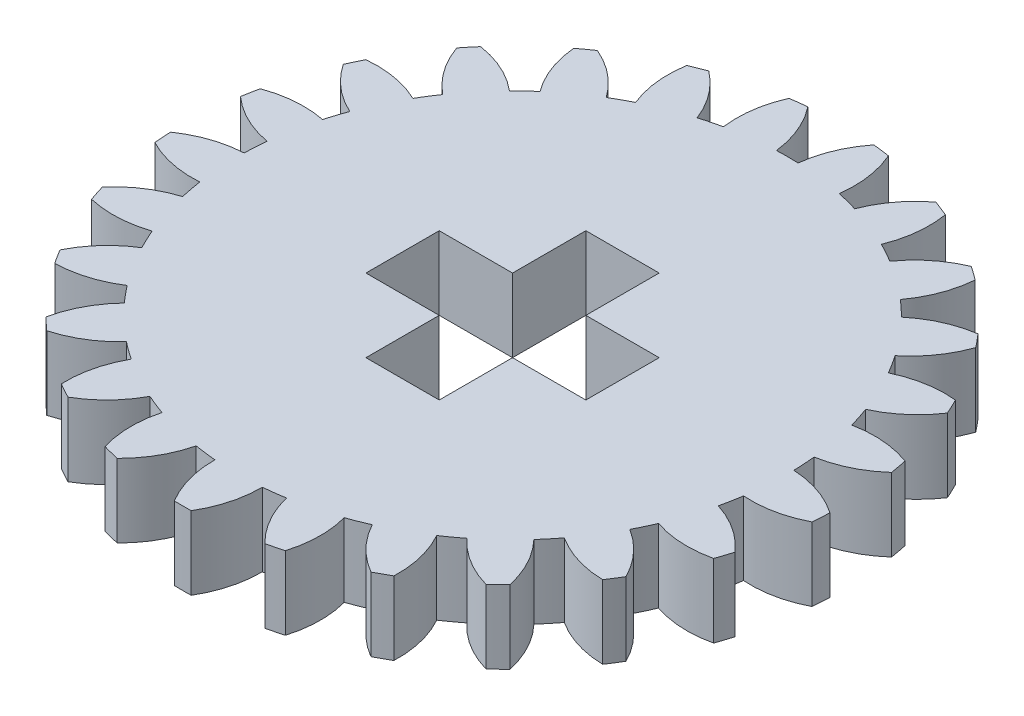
ISO-10303-21;
HEADER;
FILE_DESCRIPTION(('STEP AP214'),'2;1');
FILE_NAME('part.step','',(''),(''),'','','');
FILE_SCHEMA(('AUTOMOTIVE_DESIGN { 1 0 10303 214 1 1 1 1 }'));
ENDSEC;
DATA;
#1=APPLICATION_CONTEXT('core data for automotive mechanical design processes');
#2=APPLICATION_PROTOCOL_DEFINITION('international standard','automotive_design',2000,#1);
#3=PRODUCT_CONTEXT('',#1,'mechanical');
#4=PRODUCT('Part','Part','',(#3));
#5=PRODUCT_RELATED_PRODUCT_CATEGORY('part','',(#4));
#6=PRODUCT_DEFINITION_FORMATION('','',#4);
#7=PRODUCT_DEFINITION_CONTEXT('part definition',#1,'design');
#8=PRODUCT_DEFINITION('design','',#6,#7);
#9=PRODUCT_DEFINITION_SHAPE('','',#8);
#10=(LENGTH_UNIT() NAMED_UNIT(*) SI_UNIT(.MILLI.,.METRE.));
#11=(NAMED_UNIT(*) PLANE_ANGLE_UNIT() SI_UNIT($,.RADIAN.));
#12=(NAMED_UNIT(*) SI_UNIT($,.STERADIAN.) SOLID_ANGLE_UNIT());
#13=UNCERTAINTY_MEASURE_WITH_UNIT(LENGTH_MEASURE(1.E-05),#10,'distance_accuracy_value','');
#14=(GEOMETRIC_REPRESENTATION_CONTEXT(3) GLOBAL_UNCERTAINTY_ASSIGNED_CONTEXT((#13)) GLOBAL_UNIT_ASSIGNED_CONTEXT((#10,
#11,#12)) REPRESENTATION_CONTEXT('',''));
#15=CARTESIAN_POINT('',(0.,0.,0.));
#16=DIRECTION('',(0.,0.,1.));
#17=DIRECTION('',(1.,0.,0.));
#18=AXIS2_PLACEMENT_3D('',#15,#16,#17);
#19=CARTESIAN_POINT('',(0.,3.,0.));
#20=DIRECTION('',(0.,1.,0.));
#21=DIRECTION('',(0.,0.,1.));
#22=AXIS2_PLACEMENT_3D('',#19,#20,#21);
#23=PLANE('',#22);
#24=DIRECTION('',(-1.,0.,0.));
#25=VECTOR('',#24,1.);
#26=CARTESIAN_POINT('',(1.5,3.,-4.5));
#27=LINE('',#26,#25);
#28=CARTESIAN_POINT('',(1.5,3.,-4.5));
#29=VERTEX_POINT('',#28);
#30=CARTESIAN_POINT('',(-1.5,3.,-4.5));
#31=VERTEX_POINT('',#30);
#32=EDGE_CURVE('E51',#29,#31,#27,.T.);
#33=ORIENTED_EDGE('',*,*,#32,.F.);
#34=DIRECTION('',(0.,0.,-1.));
#35=VECTOR('',#34,1.);
#36=CARTESIAN_POINT('',(1.5,3.,-1.5));
#37=LINE('',#36,#35);
#38=CARTESIAN_POINT('',(1.5,3.,-1.5));
#39=VERTEX_POINT('',#38);
#40=EDGE_CURVE('E770',#39,#29,#37,.T.);
#41=ORIENTED_EDGE('',*,*,#40,.F.);
#42=DIRECTION('',(-1.,0.,0.));
#43=VECTOR('',#42,1.);
#44=CARTESIAN_POINT('',(4.5,3.,-1.5));
#45=LINE('',#44,#43);
#46=CARTESIAN_POINT('',(4.5,3.,-1.5));
#47=VERTEX_POINT('',#46);
#48=EDGE_CURVE('E767',#47,#39,#45,.T.);
#49=ORIENTED_EDGE('',*,*,#48,.F.);
#50=DIRECTION('',(0.,0.,-1.));
#51=VECTOR('',#50,1.);
#52=CARTESIAN_POINT('',(4.5,3.,1.5));
#53=LINE('',#52,#51);
#54=CARTESIAN_POINT('',(4.5,3.,1.5));
#55=VERTEX_POINT('',#54);
#56=EDGE_CURVE('E764',#55,#47,#53,.T.);
#57=ORIENTED_EDGE('',*,*,#56,.F.);
#58=DIRECTION('',(1.,0.,0.));
#59=VECTOR('',#58,1.);
#60=CARTESIAN_POINT('',(4.5,3.,1.5));
#61=LINE('',#60,#59);
#62=CARTESIAN_POINT('',(1.5,3.,1.5));
#63=VERTEX_POINT('',#62);
#64=EDGE_CURVE('E761',#63,#55,#61,.T.);
#65=ORIENTED_EDGE('',*,*,#64,.F.);
#66=DIRECTION('',(0.,0.,-1.));
#67=VECTOR('',#66,1.);
#68=CARTESIAN_POINT('',(1.5,3.,4.5));
#69=LINE('',#68,#67);
#70=CARTESIAN_POINT('',(1.5,3.,4.5));
#71=VERTEX_POINT('',#70);
#72=EDGE_CURVE('E758',#71,#63,#69,.T.);
#73=ORIENTED_EDGE('',*,*,#72,.F.);
#74=DIRECTION('',(1.,0.,0.));
#75=VECTOR('',#74,1.);
#76=CARTESIAN_POINT('',(1.5,3.,4.5));
#77=LINE('',#76,#75);
#78=CARTESIAN_POINT('',(-1.5,3.,4.5));
#79=VERTEX_POINT('',#78);
#80=EDGE_CURVE('E755',#79,#71,#77,.T.);
#81=ORIENTED_EDGE('',*,*,#80,.F.);
#82=DIRECTION('',(0.,0.,1.));
#83=VECTOR('',#82,1.);
#84=CARTESIAN_POINT('',(-1.5,3.,4.5));
#85=LINE('',#84,#83);
#86=CARTESIAN_POINT('',(-1.5,3.,1.5));
#87=VERTEX_POINT('',#86);
#88=EDGE_CURVE('E752',#87,#79,#85,.T.);
#89=ORIENTED_EDGE('',*,*,#88,.F.);
#90=DIRECTION('',(1.,0.,0.));
#91=VECTOR('',#90,1.);
#92=CARTESIAN_POINT('',(-1.5,3.,1.5));
#93=LINE('',#92,#91);
#94=CARTESIAN_POINT('',(-4.5,3.,1.5));
#95=VERTEX_POINT('',#94);
#96=EDGE_CURVE('E746',#95,#87,#93,.T.);
#97=ORIENTED_EDGE('',*,*,#96,.F.);
#98=DIRECTION('',(0.,0.,1.));
#99=VECTOR('',#98,1.);
#100=CARTESIAN_POINT('',(-4.5,3.,1.5));
#101=LINE('',#100,#99);
#102=CARTESIAN_POINT('',(-4.5,3.,-1.5));
#103=VERTEX_POINT('',#102);
#104=EDGE_CURVE('E744',#103,#95,#101,.T.);
#105=ORIENTED_EDGE('',*,*,#104,.F.);
#106=DIRECTION('',(-1.,0.,0.));
#107=VECTOR('',#106,1.);
#108=CARTESIAN_POINT('',(-1.5,3.,-1.5));
#109=LINE('',#108,#107);
#110=CARTESIAN_POINT('',(-1.5,3.,-1.5));
#111=VERTEX_POINT('',#110);
#112=EDGE_CURVE('E728',#111,#103,#109,.T.);
#113=ORIENTED_EDGE('',*,*,#112,.F.);
#114=DIRECTION('',(0.,0.,1.));
#115=VECTOR('',#114,1.);
#116=CARTESIAN_POINT('',(-1.5,3.,-1.5));
#117=LINE('',#116,#115);
#118=EDGE_CURVE('E737',#31,#111,#117,.T.);
#119=ORIENTED_EDGE('',*,*,#118,.F.);
#120=EDGE_LOOP('',(#33,#41,#49,#57,#65,#73,#81,#89,#97,#105,#113,#119));
#121=FACE_BOUND('',#120,.T.);
#122=CARTESIAN_POINT('',(8.37835790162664,3.,8.23257802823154));
#123=DIRECTION('',(0.,-1.,0.));
#124=DIRECTION('',(-0.368124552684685,0.,-0.929776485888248));
#125=AXIS2_PLACEMENT_3D('',#122,#123,#124);
#126=CIRCLE('',#125,4.34679515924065);
#127=CARTESIAN_POINT('',(6.19811726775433,3.,11.9930539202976));
#128=VERTEX_POINT('',#127);
#129=CARTESIAN_POINT('',(4.54893036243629,3.,10.2893018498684));
#130=VERTEX_POINT('',#129);
#131=EDGE_CURVE('E1109',#128,#130,#126,.T.);
#132=ORIENTED_EDGE('',*,*,#131,.F.);
#133=CARTESIAN_POINT('',(0.,3.,0.));
#134=DIRECTION('',(0.,1.,0.));
#135=DIRECTION('',(0.,0.,1.));
#136=AXIS2_PLACEMENT_3D('',#133,#134,#135);
#137=CIRCLE('',#136,13.5);
#138=CARTESIAN_POINT('',(6.8049530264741,3.,11.6594431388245));
#139=VERTEX_POINT('',#138);
#140=EDGE_CURVE('E1631',#128,#139,#137,.T.);
#141=ORIENTED_EDGE('',*,*,#140,.T.);
#142=CARTESIAN_POINT('',(2.46164686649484,3.,11.4853174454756));
#143=DIRECTION('',(0.,-1.,0.));
#144=DIRECTION('',(0.58778525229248,0.,0.809016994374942));
#145=AXIS2_PLACEMENT_3D('',#142,#143,#144);
#146=CIRCLE('',#145,4.34679515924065);
#147=CARTESIAN_POINT('',(6.2501061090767,3.,9.3540725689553));
#148=VERTEX_POINT('',#147);
#149=EDGE_CURVE('E1128',#148,#139,#146,.T.);
#150=ORIENTED_EDGE('',*,*,#149,.F.);
#151=CARTESIAN_POINT('',(0.,3.,0.));
#152=DIRECTION('',(0.,-1.,0.));
#153=DIRECTION('',(0.58778525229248,0.,0.809016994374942));
#154=AXIS2_PLACEMENT_3D('',#151,#152,#153);
#155=CIRCLE('',#154,11.25);
#156=CARTESIAN_POINT('',(6.96486266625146,3.,8.83477153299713));
#157=VERTEX_POINT('',#156);
#158=EDGE_CURVE('E1097',#157,#148,#155,.T.);
#159=ORIENTED_EDGE('',*,*,#158,.F.);
#160=CARTESIAN_POINT('',(10.1624952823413,3.,5.89032356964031));
#161=DIRECTION('',(0.,-1.,0.));
#162=DIRECTION('',(-0.58778525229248,0.,-0.809016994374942));
#163=AXIS2_PLACEMENT_3D('',#160,#161,#162);
#164=CIRCLE('',#163,4.34679515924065);
#165=CARTESIAN_POINT('',(8.98594324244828,3.,10.0748609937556));
#166=VERTEX_POINT('',#165);
#167=EDGE_CURVE('E1130',#166,#157,#164,.T.);
#168=ORIENTED_EDGE('',*,*,#167,.F.);
#169=CARTESIAN_POINT('',(9.49074851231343,3.,9.60081729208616));
#170=VERTEX_POINT('',#169);
#171=EDGE_CURVE('E1636',#166,#170,#137,.T.);
#172=ORIENTED_EDGE('',*,*,#171,.T.);
#173=CARTESIAN_POINT('',(5.24059200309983,3.,10.5122983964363));
#174=DIRECTION('',(0.,-1.,0.));
#175=DIRECTION('',(0.770513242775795,0.,0.637423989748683));
#176=AXIS2_PLACEMENT_3D('',#173,#174,#175);
#177=CIRCLE('',#176,4.34679515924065);
#178=CARTESIAN_POINT('',(8.38001078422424,3.,7.50585899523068));
#179=VERTEX_POINT('',#178);
#180=EDGE_CURVE('E1083',#179,#170,#177,.T.);
#181=ORIENTED_EDGE('',*,*,#180,.F.);
#182=CARTESIAN_POINT('',(0.,3.,0.));
#183=DIRECTION('',(0.,-1.,0.));
#184=DIRECTION('',(0.770513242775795,0.,0.637423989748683));
#185=AXIS2_PLACEMENT_3D('',#182,#183,#184);
#186=CIRCLE('',#185,11.25);
#187=CARTESIAN_POINT('',(8.94316703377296,3.,6.82512002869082));
#188=VERTEX_POINT('',#187);
#189=EDGE_CURVE('E1074',#188,#179,#186,.T.);
#190=ORIENTED_EDGE('',*,*,#189,.F.);
#191=CARTESIAN_POINT('',(11.3080857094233,3.,3.17795841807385));
#192=DIRECTION('',(0.,-1.,0.));
#193=DIRECTION('',(-0.770513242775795,0.,-0.637423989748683));
#194=AXIS2_PLACEMENT_3D('',#191,#192,#193);
#195=CIRCLE('',#194,4.34679515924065);
#196=CARTESIAN_POINT('',(11.2091493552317,3.,7.52362749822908));
#197=VERTEX_POINT('',#196);
#198=EDGE_CURVE('E1085',#197,#188,#195,.T.);
#199=ORIENTED_EDGE('',*,*,#198,.F.);
#200=CARTESIAN_POINT('',(11.5802053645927,3.,6.93893678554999));
#201=VERTEX_POINT('',#200);
#202=EDGE_CURVE('E1640',#197,#201,#137,.T.);
#203=ORIENTED_EDGE('',*,*,#202,.T.);
#204=CARTESIAN_POINT('',(7.69025147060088,3.,8.87875297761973));
#205=DIRECTION('',(0.,-1.,0.));
#206=DIRECTION('',(0.904827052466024,0.,0.425779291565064));
#207=AXIS2_PLACEMENT_3D('',#204,#205,#206);
#208=CIRCLE('',#207,4.34679515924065);
#209=CARTESIAN_POINT('',(9.98336856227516,3.,5.18602469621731));
#210=VERTEX_POINT('',#209);
#211=EDGE_CURVE('E1060',#210,#201,#208,.T.);
#212=ORIENTED_EDGE('',*,*,#211,.F.);
#213=CARTESIAN_POINT('',(0.,3.,0.));
#214=DIRECTION('',(0.,-1.,0.));
#215=DIRECTION('',(0.904827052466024,0.,0.425779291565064));
#216=AXIS2_PLACEMENT_3D('',#213,#214,#215);
#217=CIRCLE('',#216,11.25);
#218=CARTESIAN_POINT('',(10.3595393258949,3.,4.38662113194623));
#219=VERTEX_POINT('',#218);
#220=EDGE_CURVE('E890',#219,#210,#217,.T.);
#221=ORIENTED_EDGE('',*,*,#220,.F.);
#222=CARTESIAN_POINT('',(11.7431475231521,3.,0.26591045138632));
#223=DIRECTION('',(0.,-1.,0.));
#224=DIRECTION('',(-0.904827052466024,0.,-0.425779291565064));
#225=AXIS2_PLACEMENT_3D('',#222,#223,#224);
#226=CIRCLE('',#225,4.34679515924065);
#227=CARTESIAN_POINT('',(12.7280433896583,3.,4.49965681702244));
#228=VERTEX_POINT('',#227);
#229=EDGE_CURVE('E1062',#228,#219,#226,.T.);
#230=ORIENTED_EDGE('',*,*,#229,.F.);
#231=CARTESIAN_POINT('',(12.9420353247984,3.,3.84105736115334));
#232=VERTEX_POINT('',#231);
#233=EDGE_CURVE('E1645',#228,#232,#137,.T.);
#234=ORIENTED_EDGE('',*,*,#233,.T.);
#235=CARTESIAN_POINT('',(9.65670415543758,3.,6.68732285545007));
#236=DIRECTION('',(0.,-1.,0.));
#237=DIRECTION('',(0.982287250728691,0.,0.187381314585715));
#238=AXIS2_PLACEMENT_3D('',#235,#236,#237);
#239=CIRCLE('',#238,4.34679515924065);
#240=CARTESIAN_POINT('',(10.9594345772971,3.,2.54033339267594));
#241=VERTEX_POINT('',#240);
#242=EDGE_CURVE('E875',#241,#232,#239,.T.);
#243=ORIENTED_EDGE('',*,*,#242,.F.);
#244=CARTESIAN_POINT('',(0.,3.,0.));
#245=DIRECTION('',(0.,-1.,0.));
#246=DIRECTION('',(0.982287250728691,0.,0.187381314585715));
#247=AXIS2_PLACEMENT_3D('',#244,#245,#246);
#248=CIRCLE('',#247,11.25);
#249=CARTESIAN_POINT('',(11.1249836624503,3.,1.67249469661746));
#250=VERTEX_POINT('',#249);
#251=EDGE_CURVE('E872',#250,#241,#248,.T.);
#252=ORIENTED_EDGE('',*,*,#251,.F.);
#253=CARTESIAN_POINT('',(11.4403441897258,3.,-2.66284564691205));
#254=DIRECTION('',(0.,-1.,0.));
#255=DIRECTION('',(-0.982287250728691,0.,-0.187381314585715));
#256=AXIS2_PLACEMENT_3D('',#253,#254,#255);
#257=CIRCLE('',#256,4.34679515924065);
#258=CARTESIAN_POINT('',(13.4471876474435,3.,1.19295614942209));
#259=VERTEX_POINT('',#258);
#260=EDGE_CURVE('E878',#259,#250,#257,.T.);
#261=ORIENTED_EDGE('',*,*,#260,.F.);
#262=CARTESIAN_POINT('',(13.4906696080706,3.,0.501830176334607));
#263=VERTEX_POINT('',#262);
#264=EDGE_CURVE('E1650',#259,#263,#137,.T.);
#265=ORIENTED_EDGE('',*,*,#264,.T.);
#266=CARTESIAN_POINT('',(11.0163906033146,3.,4.0757036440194));
#267=DIRECTION('',(0.,-1.,0.));
#268=DIRECTION('',(0.998026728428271,0.,-0.0627905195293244));
#269=AXIS2_PLACEMENT_3D('',#266,#267,#268);
#270=CIRCLE('',#269,4.34679515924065);
#271=CARTESIAN_POINT('',(11.2468790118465,3.,-0.264976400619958));
#272=VERTEX_POINT('',#271);
#273=EDGE_CURVE('E899',#272,#263,#270,.T.);
#274=ORIENTED_EDGE('',*,*,#273,.F.);
#275=CARTESIAN_POINT('',(0.,3.,0.));
#276=DIRECTION('',(0.,-1.,0.));
#277=DIRECTION('',(0.998026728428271,0.,-0.0627905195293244));
#278=AXIS2_PLACEMENT_3D('',#275,#276,#277);
#279=CIRCLE('',#278,11.25);
#280=CARTESIAN_POINT('',(11.1914043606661,3.,-1.14672073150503));
#281=VERTEX_POINT('',#280);
#282=EDGE_CURVE('E896',#281,#272,#279,.T.);
#283=ORIENTED_EDGE('',*,*,#282,.F.);
#284=CARTESIAN_POINT('',(10.4187019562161,3.,-5.42428535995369));
#285=DIRECTION('',(0.,-1.,0.));
#286=DIRECTION('',(-0.998026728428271,0.,0.0627905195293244));
#287=AXIS2_PLACEMENT_3D('',#284,#285,#286);
#288=CIRCLE('',#287,4.34679515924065);
#289=CARTESIAN_POINT('',(13.3213956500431,3.,-2.18870234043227));
#290=VERTEX_POINT('',#289);
#291=EDGE_CURVE('E902',#290,#281,#288,.T.);
#292=ORIENTED_EDGE('',*,*,#291,.F.);
#293=CARTESIAN_POINT('',(13.1916355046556,3.,-2.86892884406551));
#294=VERTEX_POINT('',#293);
#295=EDGE_CURVE('E1655',#290,#294,#137,.T.);
#296=ORIENTED_EDGE('',*,*,#295,.T.);
#297=CARTESIAN_POINT('',(11.6838767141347,3.,1.20799298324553));
#298=DIRECTION('',(0.,-1.,0.));
#299=DIRECTION('',(0.95105651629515,0.,-0.309016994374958));
#300=AXIS2_PLACEMENT_3D('',#297,#298,#299);
#301=CIRCLE('',#300,4.34679515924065);
#302=CARTESIAN_POINT('',(10.8276406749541,3.,-3.05363675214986));
#303=VERTEX_POINT('',#302);
#304=EDGE_CURVE('E922',#303,#294,#301,.T.);
#305=ORIENTED_EDGE('',*,*,#304,.F.);
#306=CARTESIAN_POINT('',(0.,3.,0.));
#307=DIRECTION('',(0.,-1.,0.));
#308=DIRECTION('',(0.95105651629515,0.,-0.309016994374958));
#309=AXIS2_PLACEMENT_3D('',#306,#307,#308);
#310=CIRCLE('',#309,11.25);
#311=CARTESIAN_POINT('',(10.5546279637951,3.,-3.8938834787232));
#312=VERTEX_POINT('',#311);
#313=EDGE_CURVE('E919',#312,#303,#310,.T.);
#314=ORIENTED_EDGE('',*,*,#313,.F.);
#315=CARTESIAN_POINT('',(8.74241436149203,3.,-7.84489727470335));
#316=DIRECTION('',(0.,-1.,0.));
#317=DIRECTION('',(-0.95105651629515,0.,0.309016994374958));
#318=AXIS2_PLACEMENT_3D('',#315,#316,#317);
#319=CIRCLE('',#318,4.34679515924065);
#320=CARTESIAN_POINT('',(12.3585713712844,3.,-5.43283661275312));
#321=VERTEX_POINT('',#320);
#322=EDGE_CURVE('E925',#321,#312,#319,.T.);
#323=ORIENTED_EDGE('',*,*,#322,.F.);
#324=CARTESIAN_POINT('',(12.0637224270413,3.,-6.05942251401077));
#325=VERTEX_POINT('',#324);
#326=EDGE_CURVE('E1521',#321,#325,#137,.T.);
#327=ORIENTED_EDGE('',*,*,#326,.T.);
#328=CARTESIAN_POINT('',(11.6172218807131,3.,-1.73562031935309));
#329=DIRECTION('',(0.,-1.,0.));
#330=DIRECTION('',(0.844327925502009,0.,-0.535826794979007));
#331=AXIS2_PLACEMENT_3D('',#328,#329,#330);
#332=CIRCLE('',#331,4.34679515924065);
#333=CARTESIAN_POINT('',(9.72806185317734,3.,-5.6504258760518));
#334=VERTEX_POINT('',#333);
#335=EDGE_CURVE('E944',#334,#325,#332,.T.);
#336=ORIENTED_EDGE('',*,*,#335,.F.);
#337=CARTESIAN_POINT('',(0.,3.,0.));
#338=DIRECTION('',(0.,-1.,0.));
#339=DIRECTION('',(0.844327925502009,0.,-0.535826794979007));
#340=AXIS2_PLACEMENT_3D('',#337,#338,#339);
#341=CIRCLE('',#340,11.25);
#342=CARTESIAN_POINT('',(9.25466547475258,3.,-6.39637920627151));
#343=VERTEX_POINT('',#342);
#344=EDGE_CURVE('E844',#343,#334,#341,.T.);
#345=ORIENTED_EDGE('',*,*,#344,.F.);
#346=CARTESIAN_POINT('',(6.51680872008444,3.,-9.77258544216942));
#347=DIRECTION('',(0.,-1.,0.));
#348=DIRECTION('',(-0.844327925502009,0.,0.535826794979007));
#349=AXIS2_PLACEMENT_3D('',#346,#347,#348);
#350=CIRCLE('',#349,4.34679515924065);
#351=CARTESIAN_POINT('',(10.6192126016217,3.,-8.3356057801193));
#352=VERTEX_POINT('',#351);
#353=EDGE_CURVE('E946',#352,#343,#350,.T.);
#354=ORIENTED_EDGE('',*,*,#353,.F.);
#355=CARTESIAN_POINT('',(10.1778013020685,3.,-8.86918038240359));
#356=VERTEX_POINT('',#355);
#357=EDGE_CURVE('E1519',#352,#356,#137,.T.);
#358=ORIENTED_EDGE('',*,*,#357,.T.);
#359=CARTESIAN_POINT('',(10.8206142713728,3.,-4.57017821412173));
#360=DIRECTION('',(0.,-1.,0.));
#361=DIRECTION('',(0.684547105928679,0.,-0.72896862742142));
#362=AXIS2_PLACEMENT_3D('',#359,#360,#361);
#363=CIRCLE('',#362,4.34679515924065);
#364=CARTESIAN_POINT('',(8.01723312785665,3.,-7.89217796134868));
#365=VERTEX_POINT('',#364);
#366=EDGE_CURVE('E830',#365,#356,#363,.T.);
#367=ORIENTED_EDGE('',*,*,#366,.F.);
#368=CARTESIAN_POINT('',(0.,3.,0.));
#369=DIRECTION('',(0.,-1.,0.));
#370=DIRECTION('',(0.684547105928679,0.,-0.72896862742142));
#371=AXIS2_PLACEMENT_3D('',#368,#369,#370);
#372=CIRCLE('',#371,11.25);
#373=CARTESIAN_POINT('',(7.37319831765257,3.,-8.49696690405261));
#374=VERTEX_POINT('',#373);
#375=EDGE_CURVE('E821',#374,#365,#372,.T.);
#376=ORIENTED_EDGE('',*,*,#375,.F.);
#377=CARTESIAN_POINT('',(3.88172801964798,3.,-11.0862261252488));
#378=DIRECTION('',(0.,-1.,0.));
#379=DIRECTION('',(-0.684547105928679,0.,0.72896862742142));
#380=AXIS2_PLACEMENT_3D('',#377,#378,#379);
#381=CIRCLE('',#380,4.34679515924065);
#382=CARTESIAN_POINT('',(8.21260964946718,3.,-10.714618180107));
#383=VERTEX_POINT('',#382);
#384=EDGE_CURVE('E832',#383,#374,#381,.T.);
#385=ORIENTED_EDGE('',*,*,#384,.F.);
#386=CARTESIAN_POINT('',(7.65237148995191,3.,-11.1216550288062));
#387=VERTEX_POINT('',#386);
#388=EDGE_CURVE('E1517',#383,#387,#137,.T.);
#389=ORIENTED_EDGE('',*,*,#388,.T.);
#390=CARTESIAN_POINT('',(9.34410767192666,3.,-7.11757500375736));
#391=DIRECTION('',(0.,-1.,0.));
#392=DIRECTION('',(0.481753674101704,0.,-0.87630668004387));
#393=AXIS2_PLACEMENT_3D('',#390,#391,#392);
#394=CIRCLE('',#393,4.34679515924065);
#395=CARTESIAN_POINT('',(5.80265215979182,3.,-9.63803547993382));
#396=VERTEX_POINT('',#395);
#397=EDGE_CURVE('E806',#396,#387,#394,.T.);
#398=ORIENTED_EDGE('',*,*,#397,.F.);
#399=CARTESIAN_POINT('',(0.,3.,0.));
#400=DIRECTION('',(0.,-1.,0.));
#401=DIRECTION('',(0.481753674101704,0.,-0.87630668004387));
#402=AXIS2_PLACEMENT_3D('',#399,#400,#401);
#403=CIRCLE('',#402,11.25);
#404=CARTESIAN_POINT('',(5.02844599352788,3.,-10.0636589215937));
#405=VERTEX_POINT('',#404);
#406=EDGE_CURVE('E803',#405,#396,#403,.T.);
#407=ORIENTED_EDGE('',*,*,#406,.F.);
#408=CARTESIAN_POINT('',(1.00274407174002,3.,-11.7032784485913));
#409=DIRECTION('',(0.,-1.,0.));
#410=DIRECTION('',(-0.481753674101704,0.,0.87630668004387));
#411=AXIS2_PLACEMENT_3D('',#408,#409,#410);
#412=CIRCLE('',#411,4.34679515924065);
#413=CARTESIAN_POINT('',(5.28997822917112,3.,-12.4203917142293));
#414=VERTEX_POINT('',#413);
#415=EDGE_CURVE('E809',#414,#405,#412,.T.);
#416=ORIENTED_EDGE('',*,*,#415,.F.);
#417=CARTESIAN_POINT('',(4.64611503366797,3.,-12.675315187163));
#418=VERTEX_POINT('',#417);
#419=EDGE_CURVE('E1387',#414,#418,#137,.T.);
#420=ORIENTED_EDGE('',*,*,#419,.T.);
#421=CARTESIAN_POINT('',(7.28047642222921,3.,-9.21774837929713));
#422=DIRECTION('',(0.,-1.,0.));
#423=DIRECTION('',(0.248689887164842,0.,-0.968583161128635));
#424=AXIS2_PLACEMENT_3D('',#421,#422,#423);
#425=CIRCLE('',#424,4.34679515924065);
#426=CARTESIAN_POINT('',(3.22346921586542,3.,-10.7782997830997));
#427=VERTEX_POINT('',#426);
#428=EDGE_CURVE('E852',#427,#418,#425,.T.);
#429=ORIENTED_EDGE('',*,*,#428,.F.);
#430=CARTESIAN_POINT('',(0.,3.,0.));
#431=DIRECTION('',(0.,-1.,0.));
#432=DIRECTION('',(0.248689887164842,0.,-0.968583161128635));
#433=AXIS2_PLACEMENT_3D('',#430,#431,#432);
#434=CIRCLE('',#433,11.25);
#435=CARTESIAN_POINT('',(2.36773791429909,3.,-10.9980142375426));
#436=VERTEX_POINT('',#435);
#437=EDGE_CURVE('E795',#436,#427,#434,.T.);
#438=ORIENTED_EDGE('',*,*,#437,.F.);
#439=CARTESIAN_POINT('',(-1.9392459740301,3.,-11.5849707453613));
#440=DIRECTION('',(0.,-1.,0.));
#441=DIRECTION('',(-0.248689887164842,0.,0.968583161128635));
#442=AXIS2_PLACEMENT_3D('',#439,#440,#441);
#443=CIRCLE('',#442,4.34679515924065);
#444=CARTESIAN_POINT('',(2.03495802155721,3.,-13.3457463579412));
#445=VERTEX_POINT('',#444);
#446=EDGE_CURVE('E854',#445,#436,#443,.T.);
#447=ORIENTED_EDGE('',*,*,#446,.F.);
#448=CARTESIAN_POINT('',(1.34792608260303,3.,-13.4325386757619));
#449=VERTEX_POINT('',#448);
#450=EDGE_CURVE('E44',#445,#449,#137,.T.);
#451=ORIENTED_EDGE('',*,*,#450,.T.);
#452=CARTESIAN_POINT('',(4.75938606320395,3.,-10.7387367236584));
#453=DIRECTION('',(0.,-1.,0.));
#454=DIRECTION('',(0.,0.,-1.));
#455=AXIS2_PLACEMENT_3D('',#452,#453,#454);
#456=CIRCLE('',#455,4.34679515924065);
#457=CARTESIAN_POINT('',(0.441743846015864,3.,-11.2413238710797));
#458=VERTEX_POINT('',#457);
#459=EDGE_CURVE('E1357',#458,#449,#456,.T.);
#460=ORIENTED_EDGE('',*,*,#459,.F.);
#461=CARTESIAN_POINT('',(0.,3.,0.));
#462=DIRECTION('',(0.,-1.,0.));
#463=DIRECTION('',(0.,0.,-1.));
#464=AXIS2_PLACEMENT_3D('',#461,#462,#463);
#465=CIRCLE('',#464,11.25);
#466=CARTESIAN_POINT('',(-0.441743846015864,3.,-11.2413238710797));
#467=VERTEX_POINT('',#466);
#468=EDGE_CURVE('E1348',#467,#458,#465,.T.);
#469=ORIENTED_EDGE('',*,*,#468,.F.);
#470=CARTESIAN_POINT('',(-4.75938606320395,3.,-10.7387367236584));
#471=DIRECTION('',(0.,-1.,0.));
#472=DIRECTION('',(0.,0.,1.));
#473=AXIS2_PLACEMENT_3D('',#470,#471,#472);
#474=CIRCLE('',#473,4.34679515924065);
#475=CARTESIAN_POINT('',(-1.34792608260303,3.,-13.4325386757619));
#476=VERTEX_POINT('',#475);
#477=EDGE_CURVE('E1360',#476,#467,#474,.T.);
#478=ORIENTED_EDGE('',*,*,#477,.F.);
#479=CARTESIAN_POINT('',(-2.0349580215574,3.,-13.3457463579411));
#480=VERTEX_POINT('',#479);
#481=EDGE_CURVE('E11',#476,#480,#137,.T.);
#482=ORIENTED_EDGE('',*,*,#481,.T.);
#483=CARTESIAN_POINT('',(1.93924597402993,3.,-11.5849707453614));
#484=DIRECTION('',(0.,-1.,0.));
#485=DIRECTION('',(-0.248689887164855,0.,-0.968583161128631));
#486=AXIS2_PLACEMENT_3D('',#483,#484,#485);
#487=CIRCLE('',#486,4.34679515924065);
#488=CARTESIAN_POINT('',(-2.36773791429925,3.,-10.9980142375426));
#489=VERTEX_POINT('',#488);
#490=EDGE_CURVE('E1334',#489,#480,#487,.T.);
#491=ORIENTED_EDGE('',*,*,#490,.F.);
#492=CARTESIAN_POINT('',(0.,3.,0.));
#493=DIRECTION('',(0.,-1.,0.));
#494=DIRECTION('',(-0.248689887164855,0.,-0.968583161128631));
#495=AXIS2_PLACEMENT_3D('',#492,#493,#494);
#496=CIRCLE('',#495,11.25);
#497=CARTESIAN_POINT('',(-3.22346921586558,3.,-10.7782997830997));
#498=VERTEX_POINT('',#497);
#499=EDGE_CURVE('E1235',#498,#489,#496,.T.);
#500=ORIENTED_EDGE('',*,*,#499,.F.);
#501=CARTESIAN_POINT('',(-7.28047642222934,3.,-9.21774837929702));
#502=DIRECTION('',(0.,-1.,0.));
#503=DIRECTION('',(0.248689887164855,0.,0.968583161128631));
#504=AXIS2_PLACEMENT_3D('',#501,#502,#503);
#505=CIRCLE('',#504,4.34679515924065);
#506=CARTESIAN_POINT('',(-4.64611503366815,3.,-12.6753151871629));
#507=VERTEX_POINT('',#506);
#508=EDGE_CURVE('E1336',#507,#498,#505,.T.);
#509=ORIENTED_EDGE('',*,*,#508,.F.);
#510=CARTESIAN_POINT('',(-5.28997822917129,3.,-12.4203917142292));
#511=VERTEX_POINT('',#510);
#512=EDGE_CURVE('E43',#507,#511,#137,.T.);
#513=ORIENTED_EDGE('',*,*,#512,.T.);
#514=CARTESIAN_POINT('',(-1.00274407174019,3.,-11.7032784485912));
#515=DIRECTION('',(0.,-1.,0.));
#516=DIRECTION('',(-0.481753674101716,0.,-0.876306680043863));
#517=AXIS2_PLACEMENT_3D('',#514,#515,#516);
#518=CIRCLE('',#517,4.34679515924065);
#519=CARTESIAN_POINT('',(-5.02844599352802,3.,-10.0636589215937));
#520=VERTEX_POINT('',#519);
#521=EDGE_CURVE('E1221',#520,#511,#518,.T.);
#522=ORIENTED_EDGE('',*,*,#521,.F.);
#523=CARTESIAN_POINT('',(0.,3.,0.));
#524=DIRECTION('',(0.,-1.,0.));
#525=DIRECTION('',(-0.481753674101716,0.,-0.876306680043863));
#526=AXIS2_PLACEMENT_3D('',#523,#524,#525);
#527=CIRCLE('',#526,11.25);
#528=CARTESIAN_POINT('',(-5.80265215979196,3.,-9.63803547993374));
#529=VERTEX_POINT('',#528);
#530=EDGE_CURVE('E1212',#529,#520,#527,.T.);
#531=ORIENTED_EDGE('',*,*,#530,.F.);
#532=CARTESIAN_POINT('',(-9.34410767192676,3.,-7.11757500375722));
#533=DIRECTION('',(0.,-1.,0.));
#534=DIRECTION('',(0.481753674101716,0.,0.876306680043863));
#535=AXIS2_PLACEMENT_3D('',#532,#533,#534);
#536=CIRCLE('',#535,4.34679515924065);
#537=CARTESIAN_POINT('',(-7.65237148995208,3.,-11.1216550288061));
#538=VERTEX_POINT('',#537);
#539=EDGE_CURVE('E1223',#538,#529,#536,.T.);
#540=ORIENTED_EDGE('',*,*,#539,.F.);
#541=CARTESIAN_POINT('',(-8.21260964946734,3.,-10.7146181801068));
#542=VERTEX_POINT('',#541);
#543=EDGE_CURVE('E1574',#538,#542,#137,.T.);
#544=ORIENTED_EDGE('',*,*,#543,.T.);
#545=CARTESIAN_POINT('',(-3.88172801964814,3.,-11.0862261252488));
#546=DIRECTION('',(0.,-1.,0.));
#547=DIRECTION('',(-0.68454710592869,0.,-0.72896862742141));
#548=AXIS2_PLACEMENT_3D('',#545,#546,#547);
#549=CIRCLE('',#548,4.34679515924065);
#550=CARTESIAN_POINT('',(-7.37319831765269,3.,-8.4969669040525));
#551=VERTEX_POINT('',#550);
#552=EDGE_CURVE('E1198',#551,#542,#549,.T.);
#553=ORIENTED_EDGE('',*,*,#552,.F.);
#554=CARTESIAN_POINT('',(0.,3.,0.));
#555=DIRECTION('',(0.,-1.,0.));
#556=DIRECTION('',(-0.68454710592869,0.,-0.72896862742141));
#557=AXIS2_PLACEMENT_3D('',#554,#555,#556);
#558=CIRCLE('',#557,11.25);
#559=CARTESIAN_POINT('',(-8.01723312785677,3.,-7.89217796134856));
#560=VERTEX_POINT('',#559);
#561=EDGE_CURVE('E1166',#560,#551,#558,.T.);
#562=ORIENTED_EDGE('',*,*,#561,.F.);
#563=CARTESIAN_POINT('',(-10.8206142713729,3.,-4.57017821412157));
#564=DIRECTION('',(0.,-1.,0.));
#565=DIRECTION('',(0.68454710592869,0.,0.72896862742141));
#566=AXIS2_PLACEMENT_3D('',#563,#564,#565);
#567=CIRCLE('',#566,4.34679515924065);
#568=CARTESIAN_POINT('',(-10.1778013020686,3.,-8.86918038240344));
#569=VERTEX_POINT('',#568);
#570=EDGE_CURVE('E1200',#569,#560,#567,.T.);
#571=ORIENTED_EDGE('',*,*,#570,.F.);
#572=CARTESIAN_POINT('',(-10.6192126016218,3.,-8.33560578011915));
#573=VERTEX_POINT('',#572);
#574=EDGE_CURVE('E1576',#569,#573,#137,.T.);
#575=ORIENTED_EDGE('',*,*,#574,.T.);
#576=CARTESIAN_POINT('',(-6.51680872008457,3.,-9.77258544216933));
#577=DIRECTION('',(0.,-1.,0.));
#578=DIRECTION('',(-0.844327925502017,0.,-0.535826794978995));
#579=AXIS2_PLACEMENT_3D('',#576,#577,#578);
#580=CIRCLE('',#579,4.34679515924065);
#581=CARTESIAN_POINT('',(-9.25466547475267,3.,-6.39637920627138));
#582=VERTEX_POINT('',#581);
#583=EDGE_CURVE('E1151',#582,#573,#580,.T.);
#584=ORIENTED_EDGE('',*,*,#583,.F.);
#585=CARTESIAN_POINT('',(0.,3.,0.));
#586=DIRECTION('',(0.,-1.,0.));
#587=DIRECTION('',(-0.844327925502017,0.,-0.535826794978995));
#588=AXIS2_PLACEMENT_3D('',#585,#586,#587);
#589=CIRCLE('',#588,11.25);
#590=CARTESIAN_POINT('',(-9.72806185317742,3.,-5.65042587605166));
#591=VERTEX_POINT('',#590);
#592=EDGE_CURVE('E1148',#591,#582,#589,.T.);
#593=ORIENTED_EDGE('',*,*,#592,.F.);
#594=CARTESIAN_POINT('',(-11.6172218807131,3.,-1.73562031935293));
#595=DIRECTION('',(0.,-1.,0.));
#596=DIRECTION('',(0.844327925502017,0.,0.535826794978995));
#597=AXIS2_PLACEMENT_3D('',#594,#595,#596);
#598=CIRCLE('',#597,4.34679515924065);
#599=CARTESIAN_POINT('',(-12.0637224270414,3.,-6.0594225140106));
#600=VERTEX_POINT('',#599);
#601=EDGE_CURVE('E1154',#600,#591,#598,.T.);
#602=ORIENTED_EDGE('',*,*,#601,.F.);
#603=CARTESIAN_POINT('',(-12.3585713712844,3.,-5.43283661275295));
#604=VERTEX_POINT('',#603);
#605=EDGE_CURVE('E1581',#600,#604,#137,.T.);
#606=ORIENTED_EDGE('',*,*,#605,.T.);
#607=CARTESIAN_POINT('',(-8.74241436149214,3.,-7.84489727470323));
#608=DIRECTION('',(0.,-1.,0.));
#609=DIRECTION('',(-0.951056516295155,0.,-0.309016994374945));
#610=AXIS2_PLACEMENT_3D('',#607,#608,#609);
#611=CIRCLE('',#610,4.34679515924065);
#612=CARTESIAN_POINT('',(-10.5546279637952,3.,-3.89388347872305));
#613=VERTEX_POINT('',#612);
#614=EDGE_CURVE('E1175',#613,#604,#611,.T.);
#615=ORIENTED_EDGE('',*,*,#614,.F.);
#616=CARTESIAN_POINT('',(0.,3.,0.));
#617=DIRECTION('',(0.,-1.,0.));
#618=DIRECTION('',(-0.951056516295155,0.,-0.309016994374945));
#619=AXIS2_PLACEMENT_3D('',#616,#617,#618);
#620=CIRCLE('',#619,11.25);
#621=CARTESIAN_POINT('',(-10.8276406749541,3.,-3.05363675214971));
#622=VERTEX_POINT('',#621);
#623=EDGE_CURVE('E1172',#622,#613,#620,.T.);
#624=ORIENTED_EDGE('',*,*,#623,.F.);
#625=CARTESIAN_POINT('',(-11.6838767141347,3.,1.20799298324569));
#626=DIRECTION('',(0.,-1.,0.));
#627=DIRECTION('',(0.951056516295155,0.,0.309016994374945));
#628=AXIS2_PLACEMENT_3D('',#625,#626,#627);
#629=CIRCLE('',#628,4.34679515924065);
#630=CARTESIAN_POINT('',(-13.1916355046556,3.,-2.86892884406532));
#631=VERTEX_POINT('',#630);
#632=EDGE_CURVE('E1178',#631,#622,#629,.T.);
#633=ORIENTED_EDGE('',*,*,#632,.F.);
#634=CARTESIAN_POINT('',(-13.3213956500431,3.,-2.18870234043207));
#635=VERTEX_POINT('',#634);
#636=EDGE_CURVE('E1586',#631,#635,#137,.T.);
#637=ORIENTED_EDGE('',*,*,#636,.T.);
#638=CARTESIAN_POINT('',(-10.4187019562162,3.,-5.42428535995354));
#639=DIRECTION('',(0.,-1.,0.));
#640=DIRECTION('',(-0.998026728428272,0.,-0.06279051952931));
#641=AXIS2_PLACEMENT_3D('',#638,#639,#640);
#642=CIRCLE('',#641,4.34679515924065);
#643=CARTESIAN_POINT('',(-11.1914043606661,3.,-1.14672073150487));
#644=VERTEX_POINT('',#643);
#645=EDGE_CURVE('E1244',#644,#635,#642,.T.);
#646=ORIENTED_EDGE('',*,*,#645,.F.);
#647=CARTESIAN_POINT('',(0.,3.,0.));
#648=DIRECTION('',(0.,-1.,0.));
#649=DIRECTION('',(-0.998026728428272,0.,-0.06279051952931));
#650=AXIS2_PLACEMENT_3D('',#647,#648,#649);
#651=CIRCLE('',#650,11.25);
#652=CARTESIAN_POINT('',(-11.2468790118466,3.,-0.264976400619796));
#653=VERTEX_POINT('',#652);
#654=EDGE_CURVE('E1241',#653,#644,#651,.T.);
#655=ORIENTED_EDGE('',*,*,#654,.F.);
#656=CARTESIAN_POINT('',(-11.0163906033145,3.,4.07570364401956));
#657=DIRECTION('',(0.,-1.,0.));
#658=DIRECTION('',(0.998026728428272,0.,0.06279051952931));
#659=AXIS2_PLACEMENT_3D('',#656,#657,#658);
#660=CIRCLE('',#659,4.34679515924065);
#661=CARTESIAN_POINT('',(-13.4906696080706,3.,0.501830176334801));
#662=VERTEX_POINT('',#661);
#663=EDGE_CURVE('E1247',#662,#653,#660,.T.);
#664=ORIENTED_EDGE('',*,*,#663,.F.);
#665=CARTESIAN_POINT('',(-13.4471876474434,3.,1.19295614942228));
#666=VERTEX_POINT('',#665);
#667=EDGE_CURVE('E1591',#662,#666,#137,.T.);
#668=ORIENTED_EDGE('',*,*,#667,.T.);
#669=CARTESIAN_POINT('',(-11.4403441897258,3.,-2.66284564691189));
#670=DIRECTION('',(0.,-1.,0.));
#671=DIRECTION('',(-0.982287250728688,0.,0.187381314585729));
#672=AXIS2_PLACEMENT_3D('',#669,#670,#671);
#673=CIRCLE('',#672,4.34679515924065);
#674=CARTESIAN_POINT('',(-11.1249836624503,3.,1.67249469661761));
#675=VERTEX_POINT('',#674);
#676=EDGE_CURVE('E1267',#675,#666,#673,.T.);
#677=ORIENTED_EDGE('',*,*,#676,.F.);
#678=CARTESIAN_POINT('',(0.,3.,0.));
#679=DIRECTION('',(0.,-1.,0.));
#680=DIRECTION('',(-0.982287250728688,0.,0.187381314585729));
#681=AXIS2_PLACEMENT_3D('',#678,#679,#680);
#682=CIRCLE('',#681,11.25);
#683=CARTESIAN_POINT('',(-10.9594345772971,3.,2.54033339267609));
#684=VERTEX_POINT('',#683);
#685=EDGE_CURVE('E1264',#684,#675,#682,.T.);
#686=ORIENTED_EDGE('',*,*,#685,.F.);
#687=CARTESIAN_POINT('',(-9.65670415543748,3.,6.6873228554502));
#688=DIRECTION('',(0.,-1.,0.));
#689=DIRECTION('',(0.982287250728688,0.,-0.187381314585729));
#690=AXIS2_PLACEMENT_3D('',#687,#688,#689);
#691=CIRCLE('',#690,4.34679515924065);
#692=CARTESIAN_POINT('',(-12.9420353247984,3.,3.84105736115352));
#693=VERTEX_POINT('',#692);
#694=EDGE_CURVE('E1270',#693,#684,#691,.T.);
#695=ORIENTED_EDGE('',*,*,#694,.F.);
#696=CARTESIAN_POINT('',(-12.7280433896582,3.,4.49965681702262));
#697=VERTEX_POINT('',#696);
#698=EDGE_CURVE('E1596',#693,#697,#137,.T.);
#699=ORIENTED_EDGE('',*,*,#698,.T.);
#700=CARTESIAN_POINT('',(-11.7431475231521,3.,0.265910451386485));
#701=DIRECTION('',(0.,-1.,0.));
#702=DIRECTION('',(-0.904827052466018,0.,0.425779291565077));
#703=AXIS2_PLACEMENT_3D('',#700,#701,#702);
#704=CIRCLE('',#703,4.34679515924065);
#705=CARTESIAN_POINT('',(-10.3595393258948,3.,4.38662113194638));
#706=VERTEX_POINT('',#705);
#707=EDGE_CURVE('E1312',#706,#697,#704,.T.);
#708=ORIENTED_EDGE('',*,*,#707,.F.);
#709=CARTESIAN_POINT('',(0.,3.,0.));
#710=DIRECTION('',(0.,-1.,0.));
#711=DIRECTION('',(-0.904827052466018,0.,0.425779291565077));
#712=AXIS2_PLACEMENT_3D('',#709,#710,#711);
#713=CIRCLE('',#712,11.25);
#714=CARTESIAN_POINT('',(-9.98336856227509,3.,5.18602469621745));
#715=VERTEX_POINT('',#714);
#716=EDGE_CURVE('E1304',#715,#706,#713,.T.);
#717=ORIENTED_EDGE('',*,*,#716,.F.);
#718=CARTESIAN_POINT('',(-7.69025147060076,3.,8.87875297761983));
#719=DIRECTION('',(0.,-1.,0.));
#720=DIRECTION('',(0.904827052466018,0.,-0.425779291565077));
#721=AXIS2_PLACEMENT_3D('',#718,#719,#720);
#722=CIRCLE('',#721,4.34679515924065);
#723=CARTESIAN_POINT('',(-11.5802053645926,3.,6.93893678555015));
#724=VERTEX_POINT('',#723);
#725=EDGE_CURVE('E1314',#724,#715,#722,.T.);
#726=ORIENTED_EDGE('',*,*,#725,.F.);
#727=CARTESIAN_POINT('',(-11.2091493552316,3.,7.52362749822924));
#728=VERTEX_POINT('',#727);
#729=EDGE_CURVE('E1601',#724,#728,#137,.T.);
#730=ORIENTED_EDGE('',*,*,#729,.T.);
#731=CARTESIAN_POINT('',(-11.3080857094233,3.,3.17795841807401));
#732=DIRECTION('',(0.,-1.,0.));
#733=DIRECTION('',(-0.770513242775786,0.,0.637423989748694));
#734=AXIS2_PLACEMENT_3D('',#731,#732,#733);
#735=CIRCLE('',#734,4.34679515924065);
#736=CARTESIAN_POINT('',(-8.94316703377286,3.,6.82512002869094));
#737=VERTEX_POINT('',#736);
#738=EDGE_CURVE('E1290',#737,#728,#735,.T.);
#739=ORIENTED_EDGE('',*,*,#738,.F.);
#740=CARTESIAN_POINT('',(0.,3.,0.));
#741=DIRECTION('',(0.,-1.,0.));
#742=DIRECTION('',(-0.770513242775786,0.,0.637423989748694));
#743=AXIS2_PLACEMENT_3D('',#740,#741,#742);
#744=CIRCLE('',#743,11.25);
#745=CARTESIAN_POINT('',(-8.38001078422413,3.,7.5058589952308));
#746=VERTEX_POINT('',#745);
#747=EDGE_CURVE('E982',#746,#737,#744,.T.);
#748=ORIENTED_EDGE('',*,*,#747,.F.);
#749=CARTESIAN_POINT('',(-5.24059200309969,3.,10.5122983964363));
#750=DIRECTION('',(0.,-1.,0.));
#751=DIRECTION('',(0.770513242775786,0.,-0.637423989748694));
#752=AXIS2_PLACEMENT_3D('',#749,#750,#751);
#753=CIRCLE('',#752,4.34679515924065);
#754=CARTESIAN_POINT('',(-9.49074851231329,3.,9.60081729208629));
#755=VERTEX_POINT('',#754);
#756=EDGE_CURVE('E1292',#755,#746,#753,.T.);
#757=ORIENTED_EDGE('',*,*,#756,.F.);
#758=CARTESIAN_POINT('',(-8.98594324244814,3.,10.0748609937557));
#759=VERTEX_POINT('',#758);
#760=EDGE_CURVE('E1606',#755,#759,#137,.T.);
#761=ORIENTED_EDGE('',*,*,#760,.T.);
#762=CARTESIAN_POINT('',(-10.1624952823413,3.,5.89032356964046));
#763=DIRECTION('',(0.,-1.,0.));
#764=DIRECTION('',(-0.587785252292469,0.,0.809016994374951));
#765=AXIS2_PLACEMENT_3D('',#762,#763,#764);
#766=CIRCLE('',#765,4.34679515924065);
#767=CARTESIAN_POINT('',(-6.96486266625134,3.,8.83477153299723));
#768=VERTEX_POINT('',#767);
#769=EDGE_CURVE('E967',#768,#759,#766,.T.);
#770=ORIENTED_EDGE('',*,*,#769,.F.);
#771=CARTESIAN_POINT('',(0.,3.,0.));
#772=DIRECTION('',(0.,-1.,0.));
#773=DIRECTION('',(-0.587785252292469,0.,0.809016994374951));
#774=AXIS2_PLACEMENT_3D('',#771,#772,#773);
#775=CIRCLE('',#774,11.25);
#776=CARTESIAN_POINT('',(-6.25010610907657,3.,9.35407256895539));
#777=VERTEX_POINT('',#776);
#778=EDGE_CURVE('E964',#777,#768,#775,.T.);
#779=ORIENTED_EDGE('',*,*,#778,.F.);
#780=CARTESIAN_POINT('',(-2.46164686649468,3.,11.4853174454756));
#781=DIRECTION('',(0.,-1.,0.));
#782=DIRECTION('',(0.587785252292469,0.,-0.809016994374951));
#783=AXIS2_PLACEMENT_3D('',#780,#781,#782);
#784=CIRCLE('',#783,4.34679515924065);
#785=CARTESIAN_POINT('',(-6.80495302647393,3.,11.6594431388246));
#786=VERTEX_POINT('',#785);
#787=EDGE_CURVE('E970',#786,#777,#784,.T.);
#788=ORIENTED_EDGE('',*,*,#787,.F.);
#789=CARTESIAN_POINT('',(-6.19811726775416,3.,11.9930539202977));
#790=VERTEX_POINT('',#789);
#791=EDGE_CURVE('E1611',#786,#790,#137,.T.);
#792=ORIENTED_EDGE('',*,*,#791,.T.);
#793=CARTESIAN_POINT('',(-8.37835790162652,3.,8.23257802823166));
#794=DIRECTION('',(0.,-1.,0.));
#795=DIRECTION('',(-0.368124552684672,0.,0.929776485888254));
#796=AXIS2_PLACEMENT_3D('',#793,#794,#795);
#797=CIRCLE('',#796,4.34679515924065);
#798=CARTESIAN_POINT('',(-4.54893036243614,3.,10.2893018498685));
#799=VERTEX_POINT('',#798);
#800=EDGE_CURVE('E991',#799,#790,#797,.T.);
#801=ORIENTED_EDGE('',*,*,#800,.F.);
#802=CARTESIAN_POINT('',(0.,3.,0.));
#803=DIRECTION('',(0.,-1.,0.));
#804=DIRECTION('',(-0.368124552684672,0.,0.929776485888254));
#805=AXIS2_PLACEMENT_3D('',#802,#803,#804);
#806=CIRCLE('',#805,11.25);
#807=CARTESIAN_POINT('',(-3.72748428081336,3.,10.6145353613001));
#808=VERTEX_POINT('',#807);
#809=EDGE_CURVE('E988',#808,#799,#806,.T.);
#810=ORIENTED_EDGE('',*,*,#809,.F.);
#811=CARTESIAN_POINT('',(0.471972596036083,3.,11.7366717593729));
#812=DIRECTION('',(0.,-1.,0.));
#813=DIRECTION('',(0.368124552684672,0.,-0.929776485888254));
#814=AXIS2_PLACEMENT_3D('',#811,#812,#813);
#815=CIRCLE('',#814,4.34679515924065);
#816=CARTESIAN_POINT('',(-3.69157731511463,3.,12.9854632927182));
#817=VERTEX_POINT('',#816);
#818=EDGE_CURVE('E994',#817,#808,#815,.T.);
#819=ORIENTED_EDGE('',*,*,#818,.F.);
#820=CARTESIAN_POINT('',(-3.02084079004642,3.,13.1576791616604));
#821=VERTEX_POINT('',#820);
#822=EDGE_CURVE('E1616',#817,#821,#137,.T.);
#823=ORIENTED_EDGE('',*,*,#822,.T.);
#824=CARTESIAN_POINT('',(-6.06777748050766,3.,10.057549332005));
#825=DIRECTION('',(0.,-1.,0.));
#826=DIRECTION('',(-0.125333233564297,0.,0.992114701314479));
#827=AXIS2_PLACEMENT_3D('',#824,#825,#826);
#828=CIRCLE('',#827,4.34679515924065);
#829=CARTESIAN_POINT('',(-1.84717203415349,3.,11.0973174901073));
#830=VERTEX_POINT('',#829);
#831=EDGE_CURVE('E1014',#830,#821,#828,.T.);
#832=ORIENTED_EDGE('',*,*,#831,.F.);
#833=CARTESIAN_POINT('',(0.,3.,0.));
#834=DIRECTION('',(0.,-1.,0.));
#835=DIRECTION('',(-0.125333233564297,0.,0.992114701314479));
#836=AXIS2_PLACEMENT_3D('',#833,#834,#835);
#837=CIRCLE('',#836,11.25);
#838=CARTESIAN_POINT('',(-0.970650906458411,3.,11.2080478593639));
#839=VERTEX_POINT('',#838);
#840=EDGE_CURVE('E1011',#839,#830,#837,.T.);
#841=ORIENTED_EDGE('',*,*,#840,.F.);
#842=CARTESIAN_POINT('',(3.3759362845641,3.,11.2505678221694));
#843=DIRECTION('',(0.,-1.,0.));
#844=DIRECTION('',(0.125333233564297,0.,-0.992114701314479));
#845=AXIS2_PLACEMENT_3D('',#842,#843,#844);
#846=CIRCLE('',#845,4.34679515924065);
#847=CARTESIAN_POINT('',(-0.346246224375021,3.,13.495559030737));
#848=VERTEX_POINT('',#847);
#849=EDGE_CURVE('E1017',#848,#839,#846,.T.);
#850=ORIENTED_EDGE('',*,*,#849,.F.);
#851=CARTESIAN_POINT('',(0.346246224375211,3.,13.495559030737));
#852=VERTEX_POINT('',#851);
#853=EDGE_CURVE('E1621',#848,#852,#137,.T.);
#854=ORIENTED_EDGE('',*,*,#853,.T.);
#855=CARTESIAN_POINT('',(-3.37593628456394,3.,11.2505678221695));
#856=DIRECTION('',(0.,-1.,0.));
#857=DIRECTION('',(0.125333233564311,0.,0.992114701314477));
#858=AXIS2_PLACEMENT_3D('',#855,#856,#857);
#859=CIRCLE('',#858,4.34679515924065);
#860=CARTESIAN_POINT('',(0.970650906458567,3.,11.2080478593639));
#861=VERTEX_POINT('',#860);
#862=EDGE_CURVE('E1037',#861,#852,#859,.T.);
#863=ORIENTED_EDGE('',*,*,#862,.F.);
#864=CARTESIAN_POINT('',(0.,3.,0.));
#865=DIRECTION('',(0.,-1.,0.));
#866=DIRECTION('',(0.125333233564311,0.,0.992114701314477));
#867=AXIS2_PLACEMENT_3D('',#864,#865,#866);
#868=CIRCLE('',#867,11.25);
#869=CARTESIAN_POINT('',(1.84717203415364,3.,11.0973174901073));
#870=VERTEX_POINT('',#869);
#871=EDGE_CURVE('E1034',#870,#861,#868,.T.);
#872=ORIENTED_EDGE('',*,*,#871,.F.);
#873=CARTESIAN_POINT('',(6.0677774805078,3.,10.0575493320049));
#874=DIRECTION('',(0.,-1.,0.));
#875=DIRECTION('',(-0.125333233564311,0.,-0.992114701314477));
#876=AXIS2_PLACEMENT_3D('',#873,#874,#875);
#877=CIRCLE('',#876,4.34679515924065);
#878=CARTESIAN_POINT('',(3.02084079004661,3.,13.1576791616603));
#879=VERTEX_POINT('',#878);
#880=EDGE_CURVE('E1040',#879,#870,#877,.T.);
#881=ORIENTED_EDGE('',*,*,#880,.F.);
#882=CARTESIAN_POINT('',(3.69157731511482,3.,12.9854632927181));
#883=VERTEX_POINT('',#882);
#884=EDGE_CURVE('E1626',#879,#883,#137,.T.);
#885=ORIENTED_EDGE('',*,*,#884,.T.);
#886=CARTESIAN_POINT('',(-0.471972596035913,3.,11.7366717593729));
#887=DIRECTION('',(0.,-1.,0.));
#888=DIRECTION('',(0.368124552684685,0.,0.929776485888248));
#889=AXIS2_PLACEMENT_3D('',#886,#887,#888);
#890=CIRCLE('',#889,4.34679515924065);
#891=CARTESIAN_POINT('',(3.72748428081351,3.,10.6145353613));
#892=VERTEX_POINT('',#891);
#893=EDGE_CURVE('E1106',#892,#883,#890,.T.);
#894=ORIENTED_EDGE('',*,*,#893,.F.);
#895=CARTESIAN_POINT('',(0.,3.,0.));
#896=DIRECTION('',(0.,-1.,0.));
#897=DIRECTION('',(0.368124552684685,0.,0.929776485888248));
#898=AXIS2_PLACEMENT_3D('',#895,#896,#897);
#899=CIRCLE('',#898,11.25);
#900=EDGE_CURVE('E1103',#130,#892,#899,.T.);
#901=ORIENTED_EDGE('',*,*,#900,.F.);
#902=EDGE_LOOP('',(#132,#141,#150,#159,#168,#172,#181,#190,#199,#203,#212,#221,#230,#234,#243,
#252,#261,#265,#274,#283,#292,#296,#305,#314,#323,#327,#336,#345,#354,#358,#367,#376,#385,#389,
#398,#407,#416,#420,#429,#438,#447,#451,#460,#469,#478,#482,#491,#500,#509,#513,#522,#531,#540,
#544,#553,#562,#571,#575,#584,#593,#602,#606,#615,#624,#633,#637,#646,#655,#664,#668,#677,#686,
#695,#699,#708,#717,#726,#730,#739,#748,#757,#761,#770,#779,#788,#792,#801,#810,#819,#823,#832,
#841,#850,#854,#863,#872,#881,#885,#894,#901));
#903=FACE_BOUND('',#902,.T.);
#904=ADVANCED_FACE('F34',(#121,#903),#23,.T.);
#905=CARTESIAN_POINT('',(0.,0.,0.));
#906=DIRECTION('',(0.,1.,0.));
#907=DIRECTION('',(0.,0.,1.));
#908=AXIS2_PLACEMENT_3D('',#905,#906,#907);
#909=PLANE('',#908);
#910=DIRECTION('',(0.,0.,1.));
#911=VECTOR('',#910,1.);
#912=CARTESIAN_POINT('',(1.5,0.,-1.5));
#913=LINE('',#912,#911);
#914=CARTESIAN_POINT('',(1.5,0.,-4.5));
#915=VERTEX_POINT('',#914);
#916=CARTESIAN_POINT('',(1.5,0.,-1.5));
#917=VERTEX_POINT('',#916);
#918=EDGE_CURVE('E2883',#915,#917,#913,.T.);
#919=ORIENTED_EDGE('',*,*,#918,.F.);
#920=DIRECTION('',(1.,0.,0.));
#921=VECTOR('',#920,1.);
#922=CARTESIAN_POINT('',(1.5,0.,-4.5));
#923=LINE('',#922,#921);
#924=CARTESIAN_POINT('',(-1.5,0.,-4.5));
#925=VERTEX_POINT('',#924);
#926=EDGE_CURVE('E796',#925,#915,#923,.T.);
#927=ORIENTED_EDGE('',*,*,#926,.F.);
#928=DIRECTION('',(0.,0.,-1.));
#929=VECTOR('',#928,1.);
#930=CARTESIAN_POINT('',(-1.5,0.,-1.5));
#931=LINE('',#930,#929);
#932=CARTESIAN_POINT('',(-1.5,0.,-1.5));
#933=VERTEX_POINT('',#932);
#934=EDGE_CURVE('E793',#933,#925,#931,.T.);
#935=ORIENTED_EDGE('',*,*,#934,.F.);
#936=DIRECTION('',(1.,0.,0.));
#937=VECTOR('',#936,1.);
#938=CARTESIAN_POINT('',(-1.5,0.,-1.5));
#939=LINE('',#938,#937);
#940=CARTESIAN_POINT('',(-4.5,0.,-1.5));
#941=VERTEX_POINT('',#940);
#942=EDGE_CURVE('E731',#941,#933,#939,.T.);
#943=ORIENTED_EDGE('',*,*,#942,.F.);
#944=DIRECTION('',(0.,0.,-1.));
#945=VECTOR('',#944,1.);
#946=CARTESIAN_POINT('',(-4.5,0.,1.5));
#947=LINE('',#946,#945);
#948=CARTESIAN_POINT('',(-4.5,0.,1.5));
#949=VERTEX_POINT('',#948);
#950=EDGE_CURVE('E2862',#949,#941,#947,.T.);
#951=ORIENTED_EDGE('',*,*,#950,.F.);
#952=DIRECTION('',(-1.,0.,0.));
#953=VECTOR('',#952,1.);
#954=CARTESIAN_POINT('',(-1.5,0.,1.5));
#955=LINE('',#954,#953);
#956=CARTESIAN_POINT('',(-1.5,0.,1.5));
#957=VERTEX_POINT('',#956);
#958=EDGE_CURVE('E2864',#957,#949,#955,.T.);
#959=ORIENTED_EDGE('',*,*,#958,.F.);
#960=DIRECTION('',(0.,0.,-1.));
#961=VECTOR('',#960,1.);
#962=CARTESIAN_POINT('',(-1.5,0.,4.5));
#963=LINE('',#962,#961);
#964=CARTESIAN_POINT('',(-1.5,0.,4.5));
#965=VERTEX_POINT('',#964);
#966=EDGE_CURVE('E2871',#965,#957,#963,.T.);
#967=ORIENTED_EDGE('',*,*,#966,.F.);
#968=DIRECTION('',(-1.,0.,0.));
#969=VECTOR('',#968,1.);
#970=CARTESIAN_POINT('',(1.5,0.,4.5));
#971=LINE('',#970,#969);
#972=CARTESIAN_POINT('',(1.5,0.,4.5));
#973=VERTEX_POINT('',#972);
#974=EDGE_CURVE('E2873',#973,#965,#971,.T.);
#975=ORIENTED_EDGE('',*,*,#974,.F.);
#976=DIRECTION('',(0.,0.,1.));
#977=VECTOR('',#976,1.);
#978=CARTESIAN_POINT('',(1.5,0.,4.5));
#979=LINE('',#978,#977);
#980=CARTESIAN_POINT('',(1.5,0.,1.5));
#981=VERTEX_POINT('',#980);
#982=EDGE_CURVE('E2875',#981,#973,#979,.T.);
#983=ORIENTED_EDGE('',*,*,#982,.F.);
#984=DIRECTION('',(-1.,0.,0.));
#985=VECTOR('',#984,1.);
#986=CARTESIAN_POINT('',(4.5,0.,1.5));
#987=LINE('',#986,#985);
#988=CARTESIAN_POINT('',(4.5,0.,1.5));
#989=VERTEX_POINT('',#988);
#990=EDGE_CURVE('E2877',#989,#981,#987,.T.);
#991=ORIENTED_EDGE('',*,*,#990,.F.);
#992=DIRECTION('',(0.,0.,1.));
#993=VECTOR('',#992,1.);
#994=CARTESIAN_POINT('',(4.5,0.,1.5));
#995=LINE('',#994,#993);
#996=CARTESIAN_POINT('',(4.5,0.,-1.5));
#997=VERTEX_POINT('',#996);
#998=EDGE_CURVE('E2879',#997,#989,#995,.T.);
#999=ORIENTED_EDGE('',*,*,#998,.F.);
#1000=DIRECTION('',(1.,0.,0.));
#1001=VECTOR('',#1000,1.);
#1002=CARTESIAN_POINT('',(4.5,0.,-1.5));
#1003=LINE('',#1002,#1001);
#1004=EDGE_CURVE('E2881',#917,#997,#1003,.T.);
#1005=ORIENTED_EDGE('',*,*,#1004,.F.);
#1006=EDGE_LOOP('',(#919,#927,#935,#943,#951,#959,#967,#975,#983,#991,#999,#1005));
#1007=FACE_BOUND('',#1006,.T.);
#1008=CARTESIAN_POINT('',(0.,0.,0.));
#1009=DIRECTION('',(0.,1.,0.));
#1010=DIRECTION('',(0.,0.,1.));
#1011=AXIS2_PLACEMENT_3D('',#1008,#1009,#1010);
#1012=CIRCLE('',#1011,13.5);
#1013=CARTESIAN_POINT('',(6.19811726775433,0.,11.9930539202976));
#1014=VERTEX_POINT('',#1013);
#1015=CARTESIAN_POINT('',(6.8049530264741,0.,11.6594431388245));
#1016=VERTEX_POINT('',#1015);
#1017=EDGE_CURVE('E1449',#1014,#1016,#1012,.T.);
#1018=ORIENTED_EDGE('',*,*,#1017,.F.);
#1019=CARTESIAN_POINT('',(8.37835790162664,0.,8.23257802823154));
#1020=DIRECTION('',(0.,1.,0.));
#1021=DIRECTION('',(0.,0.,1.));
#1022=AXIS2_PLACEMENT_3D('',#1019,#1020,#1021);
#1023=CIRCLE('',#1022,4.34679515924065);
#1024=CARTESIAN_POINT('',(4.54893036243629,0.,10.2893018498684));
#1025=VERTEX_POINT('',#1024);
#1026=EDGE_CURVE('E1098',#1025,#1014,#1023,.T.);
#1027=ORIENTED_EDGE('',*,*,#1026,.F.);
#1028=CARTESIAN_POINT('',(0.,0.,0.));
#1029=DIRECTION('',(0.,1.,0.));
#1030=DIRECTION('',(0.,0.,1.));
#1031=AXIS2_PLACEMENT_3D('',#1028,#1029,#1030);
#1032=CIRCLE('',#1031,11.25);
#1033=CARTESIAN_POINT('',(3.72748428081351,0.,10.6145353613));
#1034=VERTEX_POINT('',#1033);
#1035=EDGE_CURVE('E1100',#1034,#1025,#1032,.T.);
#1036=ORIENTED_EDGE('',*,*,#1035,.F.);
#1037=CARTESIAN_POINT('',(-0.471972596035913,0.,11.7366717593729));
#1038=DIRECTION('',(0.,1.,0.));
#1039=DIRECTION('',(0.,0.,1.));
#1040=AXIS2_PLACEMENT_3D('',#1037,#1038,#1039);
#1041=CIRCLE('',#1040,4.34679515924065);
#1042=CARTESIAN_POINT('',(3.69157731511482,0.,12.9854632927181));
#1043=VERTEX_POINT('',#1042);
#1044=EDGE_CURVE('E1038',#1043,#1034,#1041,.T.);
#1045=ORIENTED_EDGE('',*,*,#1044,.F.);
#1046=CARTESIAN_POINT('',(3.02084079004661,0.,13.1576791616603));
#1047=VERTEX_POINT('',#1046);
#1048=EDGE_CURVE('E1444',#1047,#1043,#1012,.T.);
#1049=ORIENTED_EDGE('',*,*,#1048,.F.);
#1050=CARTESIAN_POINT('',(6.0677774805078,0.,10.0575493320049));
#1051=DIRECTION('',(0.,1.,0.));
#1052=DIRECTION('',(0.,0.,1.));
#1053=AXIS2_PLACEMENT_3D('',#1050,#1051,#1052);
#1054=CIRCLE('',#1053,4.34679515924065);
#1055=CARTESIAN_POINT('',(1.84717203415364,0.,11.0973174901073));
#1056=VERTEX_POINT('',#1055);
#1057=EDGE_CURVE('E1029',#1056,#1047,#1054,.T.);
#1058=ORIENTED_EDGE('',*,*,#1057,.F.);
#1059=CARTESIAN_POINT('',(0.,0.,0.));
#1060=DIRECTION('',(0.,1.,0.));
#1061=DIRECTION('',(0.,0.,1.));
#1062=AXIS2_PLACEMENT_3D('',#1059,#1060,#1061);
#1063=CIRCLE('',#1062,11.25);
#1064=CARTESIAN_POINT('',(0.970650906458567,0.,11.2080478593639));
#1065=VERTEX_POINT('',#1064);
#1066=EDGE_CURVE('E1031',#1065,#1056,#1063,.T.);
#1067=ORIENTED_EDGE('',*,*,#1066,.F.);
#1068=CARTESIAN_POINT('',(-3.37593628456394,0.,11.2505678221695));
#1069=DIRECTION('',(0.,1.,0.));
#1070=DIRECTION('',(0.,0.,1.));
#1071=AXIS2_PLACEMENT_3D('',#1068,#1069,#1070);
#1072=CIRCLE('',#1071,4.34679515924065);
#1073=CARTESIAN_POINT('',(0.346246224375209,0.,13.495559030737));
#1074=VERTEX_POINT('',#1073);
#1075=EDGE_CURVE('E1015',#1074,#1065,#1072,.T.);
#1076=ORIENTED_EDGE('',*,*,#1075,.F.);
#1077=CARTESIAN_POINT('',(-0.346246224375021,0.,13.495559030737));
#1078=VERTEX_POINT('',#1077);
#1079=EDGE_CURVE('E1439',#1078,#1074,#1012,.T.);
#1080=ORIENTED_EDGE('',*,*,#1079,.F.);
#1081=CARTESIAN_POINT('',(3.3759362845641,0.,11.2505678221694));
#1082=DIRECTION('',(0.,1.,0.));
#1083=DIRECTION('',(0.,0.,1.));
#1084=AXIS2_PLACEMENT_3D('',#1081,#1082,#1083);
#1085=CIRCLE('',#1084,4.34679515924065);
#1086=CARTESIAN_POINT('',(-0.970650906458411,0.,11.2080478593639));
#1087=VERTEX_POINT('',#1086);
#1088=EDGE_CURVE('E1006',#1087,#1078,#1085,.T.);
#1089=ORIENTED_EDGE('',*,*,#1088,.F.);
#1090=CARTESIAN_POINT('',(0.,0.,0.));
#1091=DIRECTION('',(0.,1.,0.));
#1092=DIRECTION('',(0.,0.,1.));
#1093=AXIS2_PLACEMENT_3D('',#1090,#1091,#1092);
#1094=CIRCLE('',#1093,11.25);
#1095=CARTESIAN_POINT('',(-1.84717203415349,0.,11.0973174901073));
#1096=VERTEX_POINT('',#1095);
#1097=EDGE_CURVE('E1008',#1096,#1087,#1094,.T.);
#1098=ORIENTED_EDGE('',*,*,#1097,.F.);
#1099=CARTESIAN_POINT('',(-6.06777748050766,0.,10.057549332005));
#1100=DIRECTION('',(0.,1.,0.));
#1101=DIRECTION('',(0.,0.,1.));
#1102=AXIS2_PLACEMENT_3D('',#1099,#1100,#1101);
#1103=CIRCLE('',#1102,4.34679515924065);
#1104=CARTESIAN_POINT('',(-3.02084079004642,0.,13.1576791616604));
#1105=VERTEX_POINT('',#1104);
#1106=EDGE_CURVE('E992',#1105,#1096,#1103,.T.);
#1107=ORIENTED_EDGE('',*,*,#1106,.F.);
#1108=CARTESIAN_POINT('',(-3.69157731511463,0.,12.9854632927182));
#1109=VERTEX_POINT('',#1108);
#1110=EDGE_CURVE('E1434',#1109,#1105,#1012,.T.);
#1111=ORIENTED_EDGE('',*,*,#1110,.F.);
#1112=CARTESIAN_POINT('',(0.471972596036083,0.,11.7366717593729));
#1113=DIRECTION('',(0.,1.,0.));
#1114=DIRECTION('',(0.,0.,1.));
#1115=AXIS2_PLACEMENT_3D('',#1112,#1113,#1114);
#1116=CIRCLE('',#1115,4.34679515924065);
#1117=CARTESIAN_POINT('',(-3.72748428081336,0.,10.6145353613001));
#1118=VERTEX_POINT('',#1117);
#1119=EDGE_CURVE('E983',#1118,#1109,#1116,.T.);
#1120=ORIENTED_EDGE('',*,*,#1119,.F.);
#1121=CARTESIAN_POINT('',(0.,0.,0.));
#1122=DIRECTION('',(0.,1.,0.));
#1123=DIRECTION('',(0.,0.,1.));
#1124=AXIS2_PLACEMENT_3D('',#1121,#1122,#1123);
#1125=CIRCLE('',#1124,11.25);
#1126=CARTESIAN_POINT('',(-4.54893036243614,0.,10.2893018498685));
#1127=VERTEX_POINT('',#1126);
#1128=EDGE_CURVE('E985',#1127,#1118,#1125,.T.);
#1129=ORIENTED_EDGE('',*,*,#1128,.F.);
#1130=CARTESIAN_POINT('',(-8.37835790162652,0.,8.23257802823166));
#1131=DIRECTION('',(0.,1.,0.));
#1132=DIRECTION('',(0.,0.,1.));
#1133=AXIS2_PLACEMENT_3D('',#1130,#1131,#1132);
#1134=CIRCLE('',#1133,4.34679515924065);
#1135=CARTESIAN_POINT('',(-6.19811726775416,0.,11.9930539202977));
#1136=VERTEX_POINT('',#1135);
#1137=EDGE_CURVE('E968',#1136,#1127,#1134,.T.);
#1138=ORIENTED_EDGE('',*,*,#1137,.F.);
#1139=CARTESIAN_POINT('',(-6.80495302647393,0.,11.6594431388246));
#1140=VERTEX_POINT('',#1139);
#1141=EDGE_CURVE('E1429',#1140,#1136,#1012,.T.);
#1142=ORIENTED_EDGE('',*,*,#1141,.F.);
#1143=CARTESIAN_POINT('',(-2.46164686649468,0.,11.4853174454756));
#1144=DIRECTION('',(0.,1.,0.));
#1145=DIRECTION('',(0.,0.,1.));
#1146=AXIS2_PLACEMENT_3D('',#1143,#1144,#1145);
#1147=CIRCLE('',#1146,4.34679515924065);
#1148=CARTESIAN_POINT('',(-6.25010610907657,0.,9.35407256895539));
#1149=VERTEX_POINT('',#1148);
#1150=EDGE_CURVE('E958',#1149,#1140,#1147,.T.);
#1151=ORIENTED_EDGE('',*,*,#1150,.F.);
#1152=CARTESIAN_POINT('',(0.,0.,0.));
#1153=DIRECTION('',(0.,1.,0.));
#1154=DIRECTION('',(0.,0.,1.));
#1155=AXIS2_PLACEMENT_3D('',#1152,#1153,#1154);
#1156=CIRCLE('',#1155,11.25);
#1157=CARTESIAN_POINT('',(-6.96486266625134,0.,8.83477153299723));
#1158=VERTEX_POINT('',#1157);
#1159=EDGE_CURVE('E960',#1158,#1149,#1156,.T.);
#1160=ORIENTED_EDGE('',*,*,#1159,.F.);
#1161=CARTESIAN_POINT('',(-10.1624952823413,0.,5.89032356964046));
#1162=DIRECTION('',(0.,1.,0.));
#1163=DIRECTION('',(0.,0.,1.));
#1164=AXIS2_PLACEMENT_3D('',#1161,#1162,#1163);
#1165=CIRCLE('',#1164,4.34679515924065);
#1166=CARTESIAN_POINT('',(-8.98594324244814,0.,10.0748609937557));
#1167=VERTEX_POINT('',#1166);
#1168=EDGE_CURVE('E963',#1167,#1158,#1165,.T.);
#1169=ORIENTED_EDGE('',*,*,#1168,.F.);
#1170=CARTESIAN_POINT('',(-9.49074851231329,0.,9.60081729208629));
#1171=VERTEX_POINT('',#1170);
#1172=EDGE_CURVE('E1424',#1171,#1167,#1012,.T.);
#1173=ORIENTED_EDGE('',*,*,#1172,.F.);
#1174=CARTESIAN_POINT('',(-5.24059200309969,0.,10.5122983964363));
#1175=DIRECTION('',(0.,1.,0.));
#1176=DIRECTION('',(0.,0.,1.));
#1177=AXIS2_PLACEMENT_3D('',#1174,#1175,#1176);
#1178=CIRCLE('',#1177,4.34679515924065);
#1179=CARTESIAN_POINT('',(-8.38001078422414,0.,7.5058589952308));
#1180=VERTEX_POINT('',#1179);
#1181=EDGE_CURVE('E1282',#1180,#1171,#1178,.T.);
#1182=ORIENTED_EDGE('',*,*,#1181,.F.);
#1183=CARTESIAN_POINT('',(0.,0.,0.));
#1184=DIRECTION('',(0.,1.,0.));
#1185=DIRECTION('',(0.,0.,1.));
#1186=AXIS2_PLACEMENT_3D('',#1183,#1184,#1185);
#1187=CIRCLE('',#1186,11.25);
#1188=CARTESIAN_POINT('',(-8.94316703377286,0.,6.82512002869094));
#1189=VERTEX_POINT('',#1188);
#1190=EDGE_CURVE('E1284',#1189,#1180,#1187,.T.);
#1191=ORIENTED_EDGE('',*,*,#1190,.F.);
#1192=CARTESIAN_POINT('',(-11.3080857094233,0.,3.17795841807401));
#1193=DIRECTION('',(0.,1.,0.));
#1194=DIRECTION('',(0.,0.,1.));
#1195=AXIS2_PLACEMENT_3D('',#1192,#1193,#1194);
#1196=CIRCLE('',#1195,4.34679515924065);
#1197=CARTESIAN_POINT('',(-11.2091493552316,0.,7.52362749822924));
#1198=VERTEX_POINT('',#1197);
#1199=EDGE_CURVE('E1287',#1198,#1189,#1196,.T.);
#1200=ORIENTED_EDGE('',*,*,#1199,.F.);
#1201=CARTESIAN_POINT('',(-11.5802053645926,0.,6.93893678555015));
#1202=VERTEX_POINT('',#1201);
#1203=EDGE_CURVE('E1419',#1202,#1198,#1012,.T.);
#1204=ORIENTED_EDGE('',*,*,#1203,.F.);
#1205=CARTESIAN_POINT('',(-7.69025147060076,0.,8.87875297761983));
#1206=DIRECTION('',(0.,1.,0.));
#1207=DIRECTION('',(0.,0.,1.));
#1208=AXIS2_PLACEMENT_3D('',#1205,#1206,#1207);
#1209=CIRCLE('',#1208,4.34679515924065);
#1210=CARTESIAN_POINT('',(-9.98336856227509,0.,5.18602469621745));
#1211=VERTEX_POINT('',#1210);
#1212=EDGE_CURVE('E1305',#1211,#1202,#1209,.T.);
#1213=ORIENTED_EDGE('',*,*,#1212,.F.);
#1214=CARTESIAN_POINT('',(0.,0.,0.));
#1215=DIRECTION('',(0.,1.,0.));
#1216=DIRECTION('',(0.,0.,1.));
#1217=AXIS2_PLACEMENT_3D('',#1214,#1215,#1216);
#1218=CIRCLE('',#1217,11.25);
#1219=CARTESIAN_POINT('',(-10.3595393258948,0.,4.38662113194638));
#1220=VERTEX_POINT('',#1219);
#1221=EDGE_CURVE('E1307',#1220,#1211,#1218,.T.);
#1222=ORIENTED_EDGE('',*,*,#1221,.F.);
#1223=CARTESIAN_POINT('',(-11.7431475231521,0.,0.265910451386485));
#1224=DIRECTION('',(0.,1.,0.));
#1225=DIRECTION('',(0.,0.,1.));
#1226=AXIS2_PLACEMENT_3D('',#1223,#1224,#1225);
#1227=CIRCLE('',#1226,4.34679515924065);
#1228=CARTESIAN_POINT('',(-12.7280433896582,0.,4.49965681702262));
#1229=VERTEX_POINT('',#1228);
#1230=EDGE_CURVE('E1268',#1229,#1220,#1227,.T.);
#1231=ORIENTED_EDGE('',*,*,#1230,.F.);
#1232=CARTESIAN_POINT('',(-12.9420353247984,0.,3.84105736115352));
#1233=VERTEX_POINT('',#1232);
#1234=EDGE_CURVE('E1414',#1233,#1229,#1012,.T.);
#1235=ORIENTED_EDGE('',*,*,#1234,.F.);
#1236=CARTESIAN_POINT('',(-9.65670415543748,0.,6.6873228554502));
#1237=DIRECTION('',(0.,1.,0.));
#1238=DIRECTION('',(0.,0.,1.));
#1239=AXIS2_PLACEMENT_3D('',#1236,#1237,#1238);
#1240=CIRCLE('',#1239,4.34679515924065);
#1241=CARTESIAN_POINT('',(-10.9594345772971,0.,2.54033339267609));
#1242=VERTEX_POINT('',#1241);
#1243=EDGE_CURVE('E1259',#1242,#1233,#1240,.T.);
#1244=ORIENTED_EDGE('',*,*,#1243,.F.);
#1245=CARTESIAN_POINT('',(0.,0.,0.));
#1246=DIRECTION('',(0.,1.,0.));
#1247=DIRECTION('',(0.,0.,1.));
#1248=AXIS2_PLACEMENT_3D('',#1245,#1246,#1247);
#1249=CIRCLE('',#1248,11.25);
#1250=CARTESIAN_POINT('',(-11.1249836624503,0.,1.67249469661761));
#1251=VERTEX_POINT('',#1250);
#1252=EDGE_CURVE('E1261',#1251,#1242,#1249,.T.);
#1253=ORIENTED_EDGE('',*,*,#1252,.F.);
#1254=CARTESIAN_POINT('',(-11.4403441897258,0.,-2.66284564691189));
#1255=DIRECTION('',(0.,1.,0.));
#1256=DIRECTION('',(0.,0.,1.));
#1257=AXIS2_PLACEMENT_3D('',#1254,#1255,#1256);
#1258=CIRCLE('',#1257,4.34679515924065);
#1259=CARTESIAN_POINT('',(-13.4471876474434,0.,1.19295614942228));
#1260=VERTEX_POINT('',#1259);
#1261=EDGE_CURVE('E1245',#1260,#1251,#1258,.T.);
#1262=ORIENTED_EDGE('',*,*,#1261,.F.);
#1263=CARTESIAN_POINT('',(-13.4906696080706,0.,0.501830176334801));
#1264=VERTEX_POINT('',#1263);
#1265=EDGE_CURVE('E1409',#1264,#1260,#1012,.T.);
#1266=ORIENTED_EDGE('',*,*,#1265,.F.);
#1267=CARTESIAN_POINT('',(-11.0163906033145,0.,4.07570364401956));
#1268=DIRECTION('',(0.,1.,0.));
#1269=DIRECTION('',(0.,0.,1.));
#1270=AXIS2_PLACEMENT_3D('',#1267,#1268,#1269);
#1271=CIRCLE('',#1270,4.34679515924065);
#1272=CARTESIAN_POINT('',(-11.2468790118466,0.,-0.264976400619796));
#1273=VERTEX_POINT('',#1272);
#1274=EDGE_CURVE('E1236',#1273,#1264,#1271,.T.);
#1275=ORIENTED_EDGE('',*,*,#1274,.F.);
#1276=CARTESIAN_POINT('',(0.,0.,0.));
#1277=DIRECTION('',(0.,1.,0.));
#1278=DIRECTION('',(0.,0.,1.));
#1279=AXIS2_PLACEMENT_3D('',#1276,#1277,#1278);
#1280=CIRCLE('',#1279,11.25);
#1281=CARTESIAN_POINT('',(-11.1914043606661,0.,-1.14672073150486));
#1282=VERTEX_POINT('',#1281);
#1283=EDGE_CURVE('E1238',#1282,#1273,#1280,.T.);
#1284=ORIENTED_EDGE('',*,*,#1283,.F.);
#1285=CARTESIAN_POINT('',(-10.4187019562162,0.,-5.42428535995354));
#1286=DIRECTION('',(0.,1.,0.));
#1287=DIRECTION('',(0.,0.,1.));
#1288=AXIS2_PLACEMENT_3D('',#1285,#1286,#1287);
#1289=CIRCLE('',#1288,4.34679515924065);
#1290=CARTESIAN_POINT('',(-13.3213956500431,0.,-2.18870234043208));
#1291=VERTEX_POINT('',#1290);
#1292=EDGE_CURVE('E1176',#1291,#1282,#1289,.T.);
#1293=ORIENTED_EDGE('',*,*,#1292,.F.);
#1294=CARTESIAN_POINT('',(-13.1916355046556,0.,-2.86892884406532));
#1295=VERTEX_POINT('',#1294);
#1296=EDGE_CURVE('E1404',#1295,#1291,#1012,.T.);
#1297=ORIENTED_EDGE('',*,*,#1296,.F.);
#1298=CARTESIAN_POINT('',(-11.6838767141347,0.,1.20799298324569));
#1299=DIRECTION('',(0.,1.,0.));
#1300=DIRECTION('',(0.,0.,1.));
#1301=AXIS2_PLACEMENT_3D('',#1298,#1299,#1300);
#1302=CIRCLE('',#1301,4.34679515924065);
#1303=CARTESIAN_POINT('',(-10.8276406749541,0.,-3.05363675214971));
#1304=VERTEX_POINT('',#1303);
#1305=EDGE_CURVE('E1167',#1304,#1295,#1302,.T.);
#1306=ORIENTED_EDGE('',*,*,#1305,.F.);
#1307=CARTESIAN_POINT('',(0.,0.,0.));
#1308=DIRECTION('',(0.,1.,0.));
#1309=DIRECTION('',(0.,0.,1.));
#1310=AXIS2_PLACEMENT_3D('',#1307,#1308,#1309);
#1311=CIRCLE('',#1310,11.25);
#1312=CARTESIAN_POINT('',(-10.5546279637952,0.,-3.89388347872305));
#1313=VERTEX_POINT('',#1312);
#1314=EDGE_CURVE('E1169',#1313,#1304,#1311,.T.);
#1315=ORIENTED_EDGE('',*,*,#1314,.F.);
#1316=CARTESIAN_POINT('',(-8.74241436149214,0.,-7.84489727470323));
#1317=DIRECTION('',(0.,1.,0.));
#1318=DIRECTION('',(0.,0.,1.));
#1319=AXIS2_PLACEMENT_3D('',#1316,#1317,#1318);
#1320=CIRCLE('',#1319,4.34679515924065);
#1321=CARTESIAN_POINT('',(-12.3585713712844,0.,-5.43283661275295));
#1322=VERTEX_POINT('',#1321);
#1323=EDGE_CURVE('E1152',#1322,#1313,#1320,.T.);
#1324=ORIENTED_EDGE('',*,*,#1323,.F.);
#1325=CARTESIAN_POINT('',(-12.0637224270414,0.,-6.0594225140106));
#1326=VERTEX_POINT('',#1325);
#1327=EDGE_CURVE('E1399',#1326,#1322,#1012,.T.);
#1328=ORIENTED_EDGE('',*,*,#1327,.F.);
#1329=CARTESIAN_POINT('',(-11.6172218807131,0.,-1.73562031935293));
#1330=DIRECTION('',(0.,1.,0.));
#1331=DIRECTION('',(0.,0.,1.));
#1332=AXIS2_PLACEMENT_3D('',#1329,#1330,#1331);
#1333=CIRCLE('',#1332,4.34679515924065);
#1334=CARTESIAN_POINT('',(-9.72806185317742,0.,-5.65042587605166));
#1335=VERTEX_POINT('',#1334);
#1336=EDGE_CURVE('E1142',#1335,#1326,#1333,.T.);
#1337=ORIENTED_EDGE('',*,*,#1336,.F.);
#1338=CARTESIAN_POINT('',(0.,0.,0.));
#1339=DIRECTION('',(0.,1.,0.));
#1340=DIRECTION('',(0.,0.,1.));
#1341=AXIS2_PLACEMENT_3D('',#1338,#1339,#1340);
#1342=CIRCLE('',#1341,11.25);
#1343=CARTESIAN_POINT('',(-9.25466547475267,0.,-6.39637920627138));
#1344=VERTEX_POINT('',#1343);
#1345=EDGE_CURVE('E1144',#1344,#1335,#1342,.T.);
#1346=ORIENTED_EDGE('',*,*,#1345,.F.);
#1347=CARTESIAN_POINT('',(-6.51680872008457,0.,-9.77258544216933));
#1348=DIRECTION('',(0.,1.,0.));
#1349=DIRECTION('',(0.,0.,1.));
#1350=AXIS2_PLACEMENT_3D('',#1347,#1348,#1349);
#1351=CIRCLE('',#1350,4.34679515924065);
#1352=CARTESIAN_POINT('',(-10.6192126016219,0.,-8.33560578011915));
#1353=VERTEX_POINT('',#1352);
#1354=EDGE_CURVE('E1147',#1353,#1344,#1351,.T.);
#1355=ORIENTED_EDGE('',*,*,#1354,.F.);
#1356=CARTESIAN_POINT('',(-10.1778013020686,0.,-8.86918038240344));
#1357=VERTEX_POINT('',#1356);
#1358=EDGE_CURVE('E1394',#1357,#1353,#1012,.T.);
#1359=ORIENTED_EDGE('',*,*,#1358,.F.);
#1360=CARTESIAN_POINT('',(-10.8206142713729,0.,-4.57017821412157));
#1361=DIRECTION('',(0.,1.,0.));
#1362=DIRECTION('',(0.,0.,1.));
#1363=AXIS2_PLACEMENT_3D('',#1360,#1361,#1362);
#1364=CIRCLE('',#1363,4.34679515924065);
#1365=CARTESIAN_POINT('',(-8.01723312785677,0.,-7.89217796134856));
#1366=VERTEX_POINT('',#1365);
#1367=EDGE_CURVE('E1190',#1366,#1357,#1364,.T.);
#1368=ORIENTED_EDGE('',*,*,#1367,.F.);
#1369=CARTESIAN_POINT('',(0.,0.,0.));
#1370=DIRECTION('',(0.,1.,0.));
#1371=DIRECTION('',(0.,0.,1.));
#1372=AXIS2_PLACEMENT_3D('',#1369,#1370,#1371);
#1373=CIRCLE('',#1372,11.25);
#1374=CARTESIAN_POINT('',(-7.37319831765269,0.,-8.4969669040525));
#1375=VERTEX_POINT('',#1374);
#1376=EDGE_CURVE('E1192',#1375,#1366,#1373,.T.);
#1377=ORIENTED_EDGE('',*,*,#1376,.F.);
#1378=CARTESIAN_POINT('',(-3.88172801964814,0.,-11.0862261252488));
#1379=DIRECTION('',(0.,1.,0.));
#1380=DIRECTION('',(0.,0.,1.));
#1381=AXIS2_PLACEMENT_3D('',#1378,#1379,#1380);
#1382=CIRCLE('',#1381,4.34679515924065);
#1383=CARTESIAN_POINT('',(-8.21260964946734,0.,-10.7146181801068));
#1384=VERTEX_POINT('',#1383);
#1385=EDGE_CURVE('E1195',#1384,#1375,#1382,.T.);
#1386=ORIENTED_EDGE('',*,*,#1385,.F.);
#1387=CARTESIAN_POINT('',(-7.65237148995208,0.,-11.1216550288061));
#1388=VERTEX_POINT('',#1387);
#1389=EDGE_CURVE('E1389',#1388,#1384,#1012,.T.);
#1390=ORIENTED_EDGE('',*,*,#1389,.F.);
#1391=CARTESIAN_POINT('',(-9.34410767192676,0.,-7.11757500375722));
#1392=DIRECTION('',(0.,1.,0.));
#1393=DIRECTION('',(0.,0.,1.));
#1394=AXIS2_PLACEMENT_3D('',#1391,#1392,#1393);
#1395=CIRCLE('',#1394,4.34679515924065);
#1396=CARTESIAN_POINT('',(-5.80265215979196,0.,-9.63803547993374));
#1397=VERTEX_POINT('',#1396);
#1398=EDGE_CURVE('E1213',#1397,#1388,#1395,.T.);
#1399=ORIENTED_EDGE('',*,*,#1398,.F.);
#1400=CARTESIAN_POINT('',(0.,0.,0.));
#1401=DIRECTION('',(0.,1.,0.));
#1402=DIRECTION('',(0.,0.,1.));
#1403=AXIS2_PLACEMENT_3D('',#1400,#1401,#1402);
#1404=CIRCLE('',#1403,11.25);
#1405=CARTESIAN_POINT('',(-5.02844599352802,0.,-10.0636589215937));
#1406=VERTEX_POINT('',#1405);
#1407=EDGE_CURVE('E1215',#1406,#1397,#1404,.T.);
#1408=ORIENTED_EDGE('',*,*,#1407,.F.);
#1409=CARTESIAN_POINT('',(-1.00274407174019,0.,-11.7032784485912));
#1410=DIRECTION('',(0.,1.,0.));
#1411=DIRECTION('',(0.,0.,1.));
#1412=AXIS2_PLACEMENT_3D('',#1409,#1410,#1411);
#1413=CIRCLE('',#1412,4.34679515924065);
#1414=CARTESIAN_POINT('',(-5.28997822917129,0.,-12.4203917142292));
#1415=VERTEX_POINT('',#1414);
#1416=EDGE_CURVE('E1218',#1415,#1406,#1413,.T.);
#1417=ORIENTED_EDGE('',*,*,#1416,.F.);
#1418=CARTESIAN_POINT('',(-4.64611503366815,0.,-12.6753151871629));
#1419=VERTEX_POINT('',#1418);
#1420=EDGE_CURVE('E1383',#1419,#1415,#1012,.T.);
#1421=ORIENTED_EDGE('',*,*,#1420,.F.);
#1422=CARTESIAN_POINT('',(-7.28047642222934,0.,-9.21774837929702));
#1423=DIRECTION('',(0.,1.,0.));
#1424=DIRECTION('',(0.,0.,1.));
#1425=AXIS2_PLACEMENT_3D('',#1422,#1423,#1424);
#1426=CIRCLE('',#1425,4.34679515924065);
#1427=CARTESIAN_POINT('',(-3.22346921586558,0.,-10.7782997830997));
#1428=VERTEX_POINT('',#1427);
#1429=EDGE_CURVE('E1326',#1428,#1419,#1426,.T.);
#1430=ORIENTED_EDGE('',*,*,#1429,.F.);
#1431=CARTESIAN_POINT('',(0.,0.,0.));
#1432=DIRECTION('',(0.,1.,0.));
#1433=DIRECTION('',(0.,0.,1.));
#1434=AXIS2_PLACEMENT_3D('',#1431,#1432,#1433);
#1435=CIRCLE('',#1434,11.25);
#1436=CARTESIAN_POINT('',(-2.36773791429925,0.,-10.9980142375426));
#1437=VERTEX_POINT('',#1436);
#1438=EDGE_CURVE('E1328',#1437,#1428,#1435,.T.);
#1439=ORIENTED_EDGE('',*,*,#1438,.F.);
#1440=CARTESIAN_POINT('',(1.93924597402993,0.,-11.5849707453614));
#1441=DIRECTION('',(0.,1.,0.));
#1442=DIRECTION('',(0.,0.,1.));
#1443=AXIS2_PLACEMENT_3D('',#1440,#1441,#1442);
#1444=CIRCLE('',#1443,4.34679515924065);
#1445=CARTESIAN_POINT('',(-2.0349580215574,0.,-13.3457463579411));
#1446=VERTEX_POINT('',#1445);
#1447=EDGE_CURVE('E1331',#1446,#1437,#1444,.T.);
#1448=ORIENTED_EDGE('',*,*,#1447,.F.);
#1449=CARTESIAN_POINT('',(-1.34792608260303,0.,-13.4325386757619));
#1450=VERTEX_POINT('',#1449);
#1451=EDGE_CURVE('E38',#1450,#1446,#1012,.T.);
#1452=ORIENTED_EDGE('',*,*,#1451,.F.);
#1453=CARTESIAN_POINT('',(-4.75938606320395,0.,-10.7387367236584));
#1454=DIRECTION('',(0.,1.,0.));
#1455=DIRECTION('',(0.,0.,1.));
#1456=AXIS2_PLACEMENT_3D('',#1453,#1454,#1455);
#1457=CIRCLE('',#1456,4.34679515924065);
#1458=CARTESIAN_POINT('',(-0.441743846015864,0.,-11.2413238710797));
#1459=VERTEX_POINT('',#1458);
#1460=EDGE_CURVE('E1349',#1459,#1450,#1457,.T.);
#1461=ORIENTED_EDGE('',*,*,#1460,.F.);
#1462=CARTESIAN_POINT('',(0.,0.,0.));
#1463=DIRECTION('',(0.,1.,0.));
#1464=DIRECTION('',(0.,0.,1.));
#1465=AXIS2_PLACEMENT_3D('',#1462,#1463,#1464);
#1466=CIRCLE('',#1465,11.25);
#1467=CARTESIAN_POINT('',(0.441743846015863,0.,-11.2413238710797));
#1468=VERTEX_POINT('',#1467);
#1469=EDGE_CURVE('E1351',#1468,#1459,#1466,.T.);
#1470=ORIENTED_EDGE('',*,*,#1469,.F.);
#1471=CARTESIAN_POINT('',(4.75938606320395,0.,-10.7387367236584));
#1472=DIRECTION('',(0.,1.,0.));
#1473=DIRECTION('',(0.,0.,1.));
#1474=AXIS2_PLACEMENT_3D('',#1471,#1472,#1473);
#1475=CIRCLE('',#1474,4.34679515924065);
#1476=CARTESIAN_POINT('',(1.34792608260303,0.,-13.4325386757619));
#1477=VERTEX_POINT('',#1476);
#1478=EDGE_CURVE('E1354',#1477,#1468,#1475,.T.);
#1479=ORIENTED_EDGE('',*,*,#1478,.F.);
#1480=CARTESIAN_POINT('',(2.03495802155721,0.,-13.3457463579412));
#1481=VERTEX_POINT('',#1480);
#1482=EDGE_CURVE('E1371',#1481,#1477,#1012,.T.);
#1483=ORIENTED_EDGE('',*,*,#1482,.F.);
#1484=CARTESIAN_POINT('',(-1.9392459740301,0.,-11.5849707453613));
#1485=DIRECTION('',(0.,1.,0.));
#1486=DIRECTION('',(0.,0.,1.));
#1487=AXIS2_PLACEMENT_3D('',#1484,#1485,#1486);
#1488=CIRCLE('',#1487,4.34679515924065);
#1489=CARTESIAN_POINT('',(2.36773791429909,0.,-10.9980142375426));
#1490=VERTEX_POINT('',#1489);
#1491=EDGE_CURVE('E845',#1490,#1481,#1488,.T.);
#1492=ORIENTED_EDGE('',*,*,#1491,.F.);
#1493=CARTESIAN_POINT('',(0.,0.,0.));
#1494=DIRECTION('',(0.,1.,0.));
#1495=DIRECTION('',(0.,0.,1.));
#1496=AXIS2_PLACEMENT_3D('',#1493,#1494,#1495);
#1497=CIRCLE('',#1496,11.25);
#1498=CARTESIAN_POINT('',(3.22346921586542,0.,-10.7782997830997));
#1499=VERTEX_POINT('',#1498);
#1500=EDGE_CURVE('E847',#1499,#1490,#1497,.T.);
#1501=ORIENTED_EDGE('',*,*,#1500,.F.);
#1502=CARTESIAN_POINT('',(7.28047642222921,0.,-9.21774837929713));
#1503=DIRECTION('',(0.,1.,0.));
#1504=DIRECTION('',(0.,0.,1.));
#1505=AXIS2_PLACEMENT_3D('',#1502,#1503,#1504);
#1506=CIRCLE('',#1505,4.34679515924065);
#1507=CARTESIAN_POINT('',(4.64611503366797,0.,-12.675315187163));
#1508=VERTEX_POINT('',#1507);
#1509=EDGE_CURVE('E807',#1508,#1499,#1506,.T.);
#1510=ORIENTED_EDGE('',*,*,#1509,.F.);
#1511=CARTESIAN_POINT('',(5.28997822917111,0.,-12.4203917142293));
#1512=VERTEX_POINT('',#1511);
#1513=EDGE_CURVE('E1376',#1512,#1508,#1012,.T.);
#1514=ORIENTED_EDGE('',*,*,#1513,.F.);
#1515=CARTESIAN_POINT('',(1.00274407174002,0.,-11.7032784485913));
#1516=DIRECTION('',(0.,1.,0.));
#1517=DIRECTION('',(0.,0.,1.));
#1518=AXIS2_PLACEMENT_3D('',#1515,#1516,#1517);
#1519=CIRCLE('',#1518,4.34679515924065);
#1520=CARTESIAN_POINT('',(5.02844599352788,0.,-10.0636589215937));
#1521=VERTEX_POINT('',#1520);
#1522=EDGE_CURVE('E797',#1521,#1512,#1519,.T.);
#1523=ORIENTED_EDGE('',*,*,#1522,.F.);
#1524=CARTESIAN_POINT('',(0.,0.,0.));
#1525=DIRECTION('',(0.,1.,0.));
#1526=DIRECTION('',(0.,0.,1.));
#1527=AXIS2_PLACEMENT_3D('',#1524,#1525,#1526);
#1528=CIRCLE('',#1527,11.25);
#1529=CARTESIAN_POINT('',(5.80265215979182,0.,-9.63803547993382));
#1530=VERTEX_POINT('',#1529);
#1531=EDGE_CURVE('E799',#1530,#1521,#1528,.T.);
#1532=ORIENTED_EDGE('',*,*,#1531,.F.);
#1533=CARTESIAN_POINT('',(9.34410767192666,0.,-7.11757500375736));
#1534=DIRECTION('',(0.,1.,0.));
#1535=DIRECTION('',(0.,0.,1.));
#1536=AXIS2_PLACEMENT_3D('',#1533,#1534,#1535);
#1537=CIRCLE('',#1536,4.34679515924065);
#1538=CARTESIAN_POINT('',(7.65237148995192,0.,-11.1216550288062));
#1539=VERTEX_POINT('',#1538);
#1540=EDGE_CURVE('E802',#1539,#1530,#1537,.T.);
#1541=ORIENTED_EDGE('',*,*,#1540,.F.);
#1542=CARTESIAN_POINT('',(8.21260964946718,0.,-10.714618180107));
#1543=VERTEX_POINT('',#1542);
#1544=EDGE_CURVE('E1381',#1543,#1539,#1012,.T.);
#1545=ORIENTED_EDGE('',*,*,#1544,.F.);
#1546=CARTESIAN_POINT('',(3.88172801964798,0.,-11.0862261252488));
#1547=DIRECTION('',(0.,1.,0.));
#1548=DIRECTION('',(0.,0.,1.));
#1549=AXIS2_PLACEMENT_3D('',#1546,#1547,#1548);
#1550=CIRCLE('',#1549,4.34679515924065);
#1551=CARTESIAN_POINT('',(7.37319831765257,0.,-8.49696690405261));
#1552=VERTEX_POINT('',#1551);
#1553=EDGE_CURVE('E822',#1552,#1543,#1550,.T.);
#1554=ORIENTED_EDGE('',*,*,#1553,.F.);
#1555=CARTESIAN_POINT('',(0.,0.,0.));
#1556=DIRECTION('',(0.,1.,0.));
#1557=DIRECTION('',(0.,0.,1.));
#1558=AXIS2_PLACEMENT_3D('',#1555,#1556,#1557);
#1559=CIRCLE('',#1558,11.25);
#1560=CARTESIAN_POINT('',(8.01723312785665,0.,-7.89217796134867));
#1561=VERTEX_POINT('',#1560);
#1562=EDGE_CURVE('E824',#1561,#1552,#1559,.T.);
#1563=ORIENTED_EDGE('',*,*,#1562,.F.);
#1564=CARTESIAN_POINT('',(10.8206142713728,0.,-4.57017821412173));
#1565=DIRECTION('',(0.,1.,0.));
#1566=DIRECTION('',(0.,0.,1.));
#1567=AXIS2_PLACEMENT_3D('',#1564,#1565,#1566);
#1568=CIRCLE('',#1567,4.34679515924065);
#1569=CARTESIAN_POINT('',(10.1778013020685,0.,-8.86918038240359));
#1570=VERTEX_POINT('',#1569);
#1571=EDGE_CURVE('E827',#1570,#1561,#1568,.T.);
#1572=ORIENTED_EDGE('',*,*,#1571,.F.);
#1573=CARTESIAN_POINT('',(10.6192126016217,0.,-8.3356057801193));
#1574=VERTEX_POINT('',#1573);
#1575=EDGE_CURVE('E1484',#1574,#1570,#1012,.T.);
#1576=ORIENTED_EDGE('',*,*,#1575,.F.);
#1577=CARTESIAN_POINT('',(6.51680872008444,0.,-9.77258544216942));
#1578=DIRECTION('',(0.,1.,0.));
#1579=DIRECTION('',(0.,0.,1.));
#1580=AXIS2_PLACEMENT_3D('',#1577,#1578,#1579);
#1581=CIRCLE('',#1580,4.34679515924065);
#1582=CARTESIAN_POINT('',(9.25466547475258,0.,-6.39637920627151));
#1583=VERTEX_POINT('',#1582);
#1584=EDGE_CURVE('E937',#1583,#1574,#1581,.T.);
#1585=ORIENTED_EDGE('',*,*,#1584,.F.);
#1586=CARTESIAN_POINT('',(0.,0.,0.));
#1587=DIRECTION('',(0.,1.,0.));
#1588=DIRECTION('',(0.,0.,1.));
#1589=AXIS2_PLACEMENT_3D('',#1586,#1587,#1588);
#1590=CIRCLE('',#1589,11.25);
#1591=CARTESIAN_POINT('',(9.72806185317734,0.,-5.6504258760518));
#1592=VERTEX_POINT('',#1591);
#1593=EDGE_CURVE('E939',#1592,#1583,#1590,.T.);
#1594=ORIENTED_EDGE('',*,*,#1593,.F.);
#1595=CARTESIAN_POINT('',(11.6172218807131,0.,-1.73562031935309));
#1596=DIRECTION('',(0.,1.,0.));
#1597=DIRECTION('',(0.,0.,1.));
#1598=AXIS2_PLACEMENT_3D('',#1595,#1596,#1597);
#1599=CIRCLE('',#1598,4.34679515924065);
#1600=CARTESIAN_POINT('',(12.0637224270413,0.,-6.05942251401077));
#1601=VERTEX_POINT('',#1600);
#1602=EDGE_CURVE('E923',#1601,#1592,#1599,.T.);
#1603=ORIENTED_EDGE('',*,*,#1602,.F.);
#1604=CARTESIAN_POINT('',(12.3585713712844,0.,-5.43283661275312));
#1605=VERTEX_POINT('',#1604);
#1606=EDGE_CURVE('E1479',#1605,#1601,#1012,.T.);
#1607=ORIENTED_EDGE('',*,*,#1606,.F.);
#1608=CARTESIAN_POINT('',(8.74241436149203,0.,-7.84489727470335));
#1609=DIRECTION('',(0.,1.,0.));
#1610=DIRECTION('',(0.,0.,1.));
#1611=AXIS2_PLACEMENT_3D('',#1608,#1609,#1610);
#1612=CIRCLE('',#1611,4.34679515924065);
#1613=CARTESIAN_POINT('',(10.5546279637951,0.,-3.8938834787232));
#1614=VERTEX_POINT('',#1613);
#1615=EDGE_CURVE('E914',#1614,#1605,#1612,.T.);
#1616=ORIENTED_EDGE('',*,*,#1615,.F.);
#1617=CARTESIAN_POINT('',(0.,0.,0.));
#1618=DIRECTION('',(0.,1.,0.));
#1619=DIRECTION('',(0.,0.,1.));
#1620=AXIS2_PLACEMENT_3D('',#1617,#1618,#1619);
#1621=CIRCLE('',#1620,11.25);
#1622=CARTESIAN_POINT('',(10.8276406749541,0.,-3.05363675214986));
#1623=VERTEX_POINT('',#1622);
#1624=EDGE_CURVE('E916',#1623,#1614,#1621,.T.);
#1625=ORIENTED_EDGE('',*,*,#1624,.F.);
#1626=CARTESIAN_POINT('',(11.6838767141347,0.,1.20799298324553));
#1627=DIRECTION('',(0.,1.,0.));
#1628=DIRECTION('',(0.,0.,1.));
#1629=AXIS2_PLACEMENT_3D('',#1626,#1627,#1628);
#1630=CIRCLE('',#1629,4.34679515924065);
#1631=CARTESIAN_POINT('',(13.1916355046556,0.,-2.86892884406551));
#1632=VERTEX_POINT('',#1631);
#1633=EDGE_CURVE('E900',#1632,#1623,#1630,.T.);
#1634=ORIENTED_EDGE('',*,*,#1633,.F.);
#1635=CARTESIAN_POINT('',(13.3213956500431,0.,-2.18870234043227));
#1636=VERTEX_POINT('',#1635);
#1637=EDGE_CURVE('E1474',#1636,#1632,#1012,.T.);
#1638=ORIENTED_EDGE('',*,*,#1637,.F.);
#1639=CARTESIAN_POINT('',(10.4187019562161,0.,-5.42428535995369));
#1640=DIRECTION('',(0.,1.,0.));
#1641=DIRECTION('',(0.,0.,1.));
#1642=AXIS2_PLACEMENT_3D('',#1639,#1640,#1641);
#1643=CIRCLE('',#1642,4.34679515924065);
#1644=CARTESIAN_POINT('',(11.1914043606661,0.,-1.14672073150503));
#1645=VERTEX_POINT('',#1644);
#1646=EDGE_CURVE('E891',#1645,#1636,#1643,.T.);
#1647=ORIENTED_EDGE('',*,*,#1646,.F.);
#1648=CARTESIAN_POINT('',(0.,0.,0.));
#1649=DIRECTION('',(0.,1.,0.));
#1650=DIRECTION('',(0.,0.,1.));
#1651=AXIS2_PLACEMENT_3D('',#1648,#1649,#1650);
#1652=CIRCLE('',#1651,11.25);
#1653=CARTESIAN_POINT('',(11.2468790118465,0.,-0.264976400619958));
#1654=VERTEX_POINT('',#1653);
#1655=EDGE_CURVE('E893',#1654,#1645,#1652,.T.);
#1656=ORIENTED_EDGE('',*,*,#1655,.F.);
#1657=CARTESIAN_POINT('',(11.0163906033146,0.,4.0757036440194));
#1658=DIRECTION('',(0.,1.,0.));
#1659=DIRECTION('',(0.,0.,1.));
#1660=AXIS2_PLACEMENT_3D('',#1657,#1658,#1659);
#1661=CIRCLE('',#1660,4.34679515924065);
#1662=CARTESIAN_POINT('',(13.4906696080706,0.,0.501830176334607));
#1663=VERTEX_POINT('',#1662);
#1664=EDGE_CURVE('E876',#1663,#1654,#1661,.T.);
#1665=ORIENTED_EDGE('',*,*,#1664,.F.);
#1666=CARTESIAN_POINT('',(13.4471876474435,0.,1.19295614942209));
#1667=VERTEX_POINT('',#1666);
#1668=EDGE_CURVE('E1469',#1667,#1663,#1012,.T.);
#1669=ORIENTED_EDGE('',*,*,#1668,.F.);
#1670=CARTESIAN_POINT('',(11.4403441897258,0.,-2.66284564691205));
#1671=DIRECTION('',(0.,1.,0.));
#1672=DIRECTION('',(0.,0.,1.));
#1673=AXIS2_PLACEMENT_3D('',#1670,#1671,#1672);
#1674=CIRCLE('',#1673,4.34679515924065);
#1675=CARTESIAN_POINT('',(11.1249836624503,0.,1.67249469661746));
#1676=VERTEX_POINT('',#1675);
#1677=EDGE_CURVE('E866',#1676,#1667,#1674,.T.);
#1678=ORIENTED_EDGE('',*,*,#1677,.F.);
#1679=CARTESIAN_POINT('',(0.,0.,0.));
#1680=DIRECTION('',(0.,1.,0.));
#1681=DIRECTION('',(0.,0.,1.));
#1682=AXIS2_PLACEMENT_3D('',#1679,#1680,#1681);
#1683=CIRCLE('',#1682,11.25);
#1684=CARTESIAN_POINT('',(10.9594345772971,0.,2.54033339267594));
#1685=VERTEX_POINT('',#1684);
#1686=EDGE_CURVE('E868',#1685,#1676,#1683,.T.);
#1687=ORIENTED_EDGE('',*,*,#1686,.F.);
#1688=CARTESIAN_POINT('',(9.65670415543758,0.,6.68732285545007));
#1689=DIRECTION('',(0.,1.,0.));
#1690=DIRECTION('',(0.,0.,1.));
#1691=AXIS2_PLACEMENT_3D('',#1688,#1689,#1690);
#1692=CIRCLE('',#1691,4.34679515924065);
#1693=CARTESIAN_POINT('',(12.9420353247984,0.,3.84105736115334));
#1694=VERTEX_POINT('',#1693);
#1695=EDGE_CURVE('E871',#1694,#1685,#1692,.T.);
#1696=ORIENTED_EDGE('',*,*,#1695,.F.);
#1697=CARTESIAN_POINT('',(12.7280433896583,0.,4.49965681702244));
#1698=VERTEX_POINT('',#1697);
#1699=EDGE_CURVE('E1464',#1698,#1694,#1012,.T.);
#1700=ORIENTED_EDGE('',*,*,#1699,.F.);
#1701=CARTESIAN_POINT('',(11.7431475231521,0.,0.26591045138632));
#1702=DIRECTION('',(0.,1.,0.));
#1703=DIRECTION('',(0.,0.,1.));
#1704=AXIS2_PLACEMENT_3D('',#1701,#1702,#1703);
#1705=CIRCLE('',#1704,4.34679515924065);
#1706=CARTESIAN_POINT('',(10.3595393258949,0.,4.38662113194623));
#1707=VERTEX_POINT('',#1706);
#1708=EDGE_CURVE('E1052',#1707,#1698,#1705,.T.);
#1709=ORIENTED_EDGE('',*,*,#1708,.F.);
#1710=CARTESIAN_POINT('',(0.,0.,0.));
#1711=DIRECTION('',(0.,1.,0.));
#1712=DIRECTION('',(0.,0.,1.));
#1713=AXIS2_PLACEMENT_3D('',#1710,#1711,#1712);
#1714=CIRCLE('',#1713,11.25);
#1715=CARTESIAN_POINT('',(9.98336856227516,0.,5.18602469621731));
#1716=VERTEX_POINT('',#1715);
#1717=EDGE_CURVE('E1054',#1716,#1707,#1714,.T.);
#1718=ORIENTED_EDGE('',*,*,#1717,.F.);
#1719=CARTESIAN_POINT('',(7.69025147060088,0.,8.87875297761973));
#1720=DIRECTION('',(0.,1.,0.));
#1721=DIRECTION('',(0.,0.,1.));
#1722=AXIS2_PLACEMENT_3D('',#1719,#1720,#1721);
#1723=CIRCLE('',#1722,4.34679515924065);
#1724=CARTESIAN_POINT('',(11.5802053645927,0.,6.93893678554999));
#1725=VERTEX_POINT('',#1724);
#1726=EDGE_CURVE('E1057',#1725,#1716,#1723,.T.);
#1727=ORIENTED_EDGE('',*,*,#1726,.F.);
#1728=CARTESIAN_POINT('',(11.2091493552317,0.,7.52362749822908));
#1729=VERTEX_POINT('',#1728);
#1730=EDGE_CURVE('E1459',#1729,#1725,#1012,.T.);
#1731=ORIENTED_EDGE('',*,*,#1730,.F.);
#1732=CARTESIAN_POINT('',(11.3080857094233,0.,3.17795841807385));
#1733=DIRECTION('',(0.,1.,0.));
#1734=DIRECTION('',(0.,0.,1.));
#1735=AXIS2_PLACEMENT_3D('',#1732,#1733,#1734);
#1736=CIRCLE('',#1735,4.34679515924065);
#1737=CARTESIAN_POINT('',(8.94316703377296,0.,6.82512002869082));
#1738=VERTEX_POINT('',#1737);
#1739=EDGE_CURVE('E1075',#1738,#1729,#1736,.T.);
#1740=ORIENTED_EDGE('',*,*,#1739,.F.);
#1741=CARTESIAN_POINT('',(0.,0.,0.));
#1742=DIRECTION('',(0.,1.,0.));
#1743=DIRECTION('',(0.,0.,1.));
#1744=AXIS2_PLACEMENT_3D('',#1741,#1742,#1743);
#1745=CIRCLE('',#1744,11.25);
#1746=CARTESIAN_POINT('',(8.38001078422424,0.,7.50585899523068));
#1747=VERTEX_POINT('',#1746);
#1748=EDGE_CURVE('E1077',#1747,#1738,#1745,.T.);
#1749=ORIENTED_EDGE('',*,*,#1748,.F.);
#1750=CARTESIAN_POINT('',(5.24059200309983,0.,10.5122983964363));
#1751=DIRECTION('',(0.,1.,0.));
#1752=DIRECTION('',(0.,0.,1.));
#1753=AXIS2_PLACEMENT_3D('',#1750,#1751,#1752);
#1754=CIRCLE('',#1753,4.34679515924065);
#1755=CARTESIAN_POINT('',(9.49074851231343,0.,9.60081729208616));
#1756=VERTEX_POINT('',#1755);
#1757=EDGE_CURVE('E1080',#1756,#1747,#1754,.T.);
#1758=ORIENTED_EDGE('',*,*,#1757,.F.);
#1759=CARTESIAN_POINT('',(8.98594324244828,0.,10.0748609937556));
#1760=VERTEX_POINT('',#1759);
#1761=EDGE_CURVE('E1454',#1760,#1756,#1012,.T.);
#1762=ORIENTED_EDGE('',*,*,#1761,.F.);
#1763=CARTESIAN_POINT('',(10.1624952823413,0.,5.89032356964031));
#1764=DIRECTION('',(0.,1.,0.));
#1765=DIRECTION('',(0.,0.,1.));
#1766=AXIS2_PLACEMENT_3D('',#1763,#1764,#1765);
#1767=CIRCLE('',#1766,4.34679515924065);
#1768=CARTESIAN_POINT('',(6.96486266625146,0.,8.83477153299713));
#1769=VERTEX_POINT('',#1768);
#1770=EDGE_CURVE('E1121',#1769,#1760,#1767,.T.);
#1771=ORIENTED_EDGE('',*,*,#1770,.F.);
#1772=CARTESIAN_POINT('',(0.,0.,0.));
#1773=DIRECTION('',(0.,1.,0.));
#1774=DIRECTION('',(0.,0.,1.));
#1775=AXIS2_PLACEMENT_3D('',#1772,#1773,#1774);
#1776=CIRCLE('',#1775,11.25);
#1777=CARTESIAN_POINT('',(6.2501061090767,0.,9.3540725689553));
#1778=VERTEX_POINT('',#1777);
#1779=EDGE_CURVE('E1123',#1778,#1769,#1776,.T.);
#1780=ORIENTED_EDGE('',*,*,#1779,.F.);
#1781=CARTESIAN_POINT('',(2.46164686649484,0.,11.4853174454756));
#1782=DIRECTION('',(0.,1.,0.));
#1783=DIRECTION('',(0.,0.,1.));
#1784=AXIS2_PLACEMENT_3D('',#1781,#1782,#1783);
#1785=CIRCLE('',#1784,4.34679515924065);
#1786=EDGE_CURVE('E1107',#1016,#1778,#1785,.T.);
#1787=ORIENTED_EDGE('',*,*,#1786,.F.);
#1788=EDGE_LOOP('',(#1018,#1027,#1036,#1045,#1049,#1058,#1067,#1076,#1080,#1089,#1098,#1107,
#1111,#1120,#1129,#1138,#1142,#1151,#1160,#1169,#1173,#1182,#1191,#1200,#1204,#1213,#1222,#1231,
#1235,#1244,#1253,#1262,#1266,#1275,#1284,#1293,#1297,#1306,#1315,#1324,#1328,#1337,#1346,#1355,
#1359,#1368,#1377,#1386,#1390,#1399,#1408,#1417,#1421,#1430,#1439,#1448,#1452,#1461,#1470,#1479,
#1483,#1492,#1501,#1510,#1514,#1523,#1532,#1541,#1545,#1554,#1563,#1572,#1576,#1585,#1594,#1603,
#1607,#1616,#1625,#1634,#1638,#1647,#1656,#1665,#1669,#1678,#1687,#1696,#1700,#1709,#1718,#1727,
#1731,#1740,#1749,#1758,#1762,#1771,#1780,#1787));
#1789=FACE_BOUND('',#1788,.T.);
#1790=ADVANCED_FACE('F1502',(#1007,#1789),#909,.F.);
#1791=CARTESIAN_POINT('',(0.,3.,0.));
#1792=DIRECTION('',(0.,-1.,0.));
#1793=DIRECTION('',(0.,0.,-1.));
#1794=AXIS2_PLACEMENT_3D('',#1791,#1792,#1793);
#1795=CYLINDRICAL_SURFACE('',#1794,13.5);
#1796=ORIENTED_EDGE('',*,*,#140,.F.);
#1797=DIRECTION('',(0.,1.,0.));
#1798=VECTOR('',#1797,1.);
#1799=CARTESIAN_POINT('',(6.19811726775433,-3.68130806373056,11.9930539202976));
#1800=LINE('',#1799,#1798);
#1801=EDGE_CURVE('E1114',#1014,#128,#1800,.T.);
#1802=ORIENTED_EDGE('',*,*,#1801,.F.);
#1803=ORIENTED_EDGE('',*,*,#1017,.T.);
#1804=DIRECTION('',(0.,1.,0.));
#1805=VECTOR('',#1804,1.);
#1806=CARTESIAN_POINT('',(6.8049530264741,-3.93237517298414,11.6594431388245));
#1807=LINE('',#1806,#1805);
#1808=EDGE_CURVE('E1137',#1016,#139,#1807,.T.);
#1809=ORIENTED_EDGE('',*,*,#1808,.T.);
#1810=EDGE_LOOP('',(#1796,#1802,#1803,#1809));
#1811=FACE_BOUND('',#1810,.T.);
#1812=ADVANCED_FACE('F1709',(#1811),#1795,.T.);
#1813=ORIENTED_EDGE('',*,*,#171,.F.);
#1814=DIRECTION('',(0.,1.,0.));
#1815=VECTOR('',#1814,1.);
#1816=CARTESIAN_POINT('',(8.98594324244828,-3.93237517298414,10.0748609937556));
#1817=LINE('',#1816,#1815);
#1818=EDGE_CURVE('E1135',#1760,#166,#1817,.T.);
#1819=ORIENTED_EDGE('',*,*,#1818,.F.);
#1820=ORIENTED_EDGE('',*,*,#1761,.T.);
#1821=DIRECTION('',(0.,1.,0.));
#1822=VECTOR('',#1821,1.);
#1823=CARTESIAN_POINT('',(9.49074851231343,-3.96339757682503,9.60081729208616));
#1824=LINE('',#1823,#1822);
#1825=EDGE_CURVE('E1092',#1756,#170,#1824,.T.);
#1826=ORIENTED_EDGE('',*,*,#1825,.T.);
#1827=EDGE_LOOP('',(#1813,#1819,#1820,#1826));
#1828=FACE_BOUND('',#1827,.T.);
#1829=ADVANCED_FACE('F2511',(#1828),#1795,.T.);
#1830=ORIENTED_EDGE('',*,*,#233,.F.);
#1831=DIRECTION('',(0.,1.,0.));
#1832=VECTOR('',#1831,1.);
#1833=CARTESIAN_POINT('',(12.7280433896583,-3.74800681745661,4.49965681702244));
#1834=LINE('',#1833,#1832);
#1835=EDGE_CURVE('E1067',#1698,#228,#1834,.T.);
#1836=ORIENTED_EDGE('',*,*,#1835,.F.);
#1837=ORIENTED_EDGE('',*,*,#1699,.T.);
#1838=DIRECTION('',(0.,1.,0.));
#1839=VECTOR('',#1838,1.);
#1840=CARTESIAN_POINT('',(12.9420353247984,-3.63336694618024,3.84105736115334));
#1841=LINE('',#1840,#1839);
#1842=EDGE_CURVE('E885',#1694,#232,#1841,.T.);
#1843=ORIENTED_EDGE('',*,*,#1842,.T.);
#1844=EDGE_LOOP('',(#1830,#1836,#1837,#1843));
#1845=FACE_BOUND('',#1844,.T.);
#1846=ADVANCED_FACE('F2519',(#1845),#1795,.T.);
#1847=ORIENTED_EDGE('',*,*,#1730,.T.);
#1848=DIRECTION('',(0.,1.,0.));
#1849=VECTOR('',#1848,1.);
#1850=CARTESIAN_POINT('',(11.5802053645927,-3.74800681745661,6.93893678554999));
#1851=LINE('',#1850,#1849);
#1852=EDGE_CURVE('E1069',#1725,#201,#1851,.T.);
#1853=ORIENTED_EDGE('',*,*,#1852,.T.);
#1854=ORIENTED_EDGE('',*,*,#202,.F.);
#1855=DIRECTION('',(0.,1.,0.));
#1856=VECTOR('',#1855,1.);
#1857=CARTESIAN_POINT('',(11.2091493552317,-3.96339757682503,7.52362749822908));
#1858=LINE('',#1857,#1856);
#1859=EDGE_CURVE('E1090',#1729,#197,#1858,.T.);
#1860=ORIENTED_EDGE('',*,*,#1859,.F.);
#1861=EDGE_LOOP('',(#1847,#1853,#1854,#1860));
#1862=FACE_BOUND('',#1861,.T.);
#1863=ADVANCED_FACE('F2526',(#1862),#1795,.T.);
#1864=ORIENTED_EDGE('',*,*,#1048,.T.);
#1865=DIRECTION('',(0.,1.,0.));
#1866=VECTOR('',#1865,1.);
#1867=CARTESIAN_POINT('',(3.69157731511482,-3.68130806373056,12.9854632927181));
#1868=LINE('',#1867,#1866);
#1869=EDGE_CURVE('E1116',#1043,#883,#1868,.T.);
#1870=ORIENTED_EDGE('',*,*,#1869,.T.);
#1871=ORIENTED_EDGE('',*,*,#884,.F.);
#1872=DIRECTION('',(0.,1.,0.));
#1873=VECTOR('',#1872,1.);
#1874=CARTESIAN_POINT('',(3.02084079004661,-3.59235557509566,13.1576791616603));
#1875=LINE('',#1874,#1873);
#1876=EDGE_CURVE('E1045',#1047,#879,#1875,.T.);
#1877=ORIENTED_EDGE('',*,*,#1876,.F.);
#1878=EDGE_LOOP('',(#1864,#1870,#1871,#1877));
#1879=FACE_BOUND('',#1878,.T.);
#1880=ADVANCED_FACE('F2533',(#1879),#1795,.T.);
#1881=ORIENTED_EDGE('',*,*,#1079,.T.);
#1882=DIRECTION('',(0.,1.,0.));
#1883=VECTOR('',#1882,1.);
#1884=CARTESIAN_POINT('',(0.346246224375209,-3.59235557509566,13.495559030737));
#1885=LINE('',#1884,#1883);
#1886=EDGE_CURVE('E1047',#1074,#852,#1885,.T.);
#1887=ORIENTED_EDGE('',*,*,#1886,.T.);
#1888=ORIENTED_EDGE('',*,*,#853,.F.);
#1889=DIRECTION('',(0.,1.,0.));
#1890=VECTOR('',#1889,1.);
#1891=CARTESIAN_POINT('',(-0.346246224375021,-3.59235557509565,13.495559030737));
#1892=LINE('',#1891,#1890);
#1893=EDGE_CURVE('E1022',#1078,#848,#1892,.T.);
#1894=ORIENTED_EDGE('',*,*,#1893,.F.);
#1895=EDGE_LOOP('',(#1881,#1887,#1888,#1894));
#1896=FACE_BOUND('',#1895,.T.);
#1897=ADVANCED_FACE('F2540',(#1896),#1795,.T.);
#1898=ORIENTED_EDGE('',*,*,#1110,.T.);
#1899=DIRECTION('',(0.,1.,0.));
#1900=VECTOR('',#1899,1.);
#1901=CARTESIAN_POINT('',(-3.02084079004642,-3.59235557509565,13.1576791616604));
#1902=LINE('',#1901,#1900);
#1903=EDGE_CURVE('E1024',#1105,#821,#1902,.T.);
#1904=ORIENTED_EDGE('',*,*,#1903,.T.);
#1905=ORIENTED_EDGE('',*,*,#822,.F.);
#1906=DIRECTION('',(0.,1.,0.));
#1907=VECTOR('',#1906,1.);
#1908=CARTESIAN_POINT('',(-3.69157731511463,-3.68130806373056,12.9854632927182));
#1909=LINE('',#1908,#1907);
#1910=EDGE_CURVE('E999',#1109,#817,#1909,.T.);
#1911=ORIENTED_EDGE('',*,*,#1910,.F.);
#1912=EDGE_LOOP('',(#1898,#1904,#1905,#1911));
#1913=FACE_BOUND('',#1912,.T.);
#1914=ADVANCED_FACE('F2547',(#1913),#1795,.T.);
#1915=ORIENTED_EDGE('',*,*,#1141,.T.);
#1916=DIRECTION('',(0.,1.,0.));
#1917=VECTOR('',#1916,1.);
#1918=CARTESIAN_POINT('',(-6.19811726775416,-3.68130806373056,11.9930539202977));
#1919=LINE('',#1918,#1917);
#1920=EDGE_CURVE('E1001',#1136,#790,#1919,.T.);
#1921=ORIENTED_EDGE('',*,*,#1920,.T.);
#1922=ORIENTED_EDGE('',*,*,#791,.F.);
#1923=DIRECTION('',(0.,1.,0.));
#1924=VECTOR('',#1923,1.);
#1925=CARTESIAN_POINT('',(-6.80495302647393,-3.93237517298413,11.6594431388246));
#1926=LINE('',#1925,#1924);
#1927=EDGE_CURVE('E975',#1140,#786,#1926,.T.);
#1928=ORIENTED_EDGE('',*,*,#1927,.F.);
#1929=EDGE_LOOP('',(#1915,#1921,#1922,#1928));
#1930=FACE_BOUND('',#1929,.T.);
#1931=ADVANCED_FACE('F2554',(#1930),#1795,.T.);
#1932=ORIENTED_EDGE('',*,*,#729,.F.);
#1933=DIRECTION('',(0.,1.,0.));
#1934=VECTOR('',#1933,1.);
#1935=CARTESIAN_POINT('',(-11.5802053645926,-3.74800681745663,6.93893678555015));
#1936=LINE('',#1935,#1934);
#1937=EDGE_CURVE('E1319',#1202,#724,#1936,.T.);
#1938=ORIENTED_EDGE('',*,*,#1937,.F.);
#1939=ORIENTED_EDGE('',*,*,#1203,.T.);
#1940=DIRECTION('',(0.,1.,0.));
#1941=VECTOR('',#1940,1.);
#1942=CARTESIAN_POINT('',(-11.2091493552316,-3.96339757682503,7.52362749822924));
#1943=LINE('',#1942,#1941);
#1944=EDGE_CURVE('E1299',#1198,#728,#1943,.T.);
#1945=ORIENTED_EDGE('',*,*,#1944,.T.);
#1946=EDGE_LOOP('',(#1932,#1938,#1939,#1945));
#1947=FACE_BOUND('',#1946,.T.);
#1948=ADVANCED_FACE('F2561',(#1947),#1795,.T.);
#1949=ORIENTED_EDGE('',*,*,#1172,.T.);
#1950=DIRECTION('',(0.,1.,0.));
#1951=VECTOR('',#1950,1.);
#1952=CARTESIAN_POINT('',(-8.98594324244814,-3.93237517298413,10.0748609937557));
#1953=LINE('',#1952,#1951);
#1954=EDGE_CURVE('E977',#1167,#759,#1953,.T.);
#1955=ORIENTED_EDGE('',*,*,#1954,.T.);
#1956=ORIENTED_EDGE('',*,*,#760,.F.);
#1957=DIRECTION('',(0.,1.,0.));
#1958=VECTOR('',#1957,1.);
#1959=CARTESIAN_POINT('',(-9.49074851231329,-3.96339757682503,9.60081729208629));
#1960=LINE('',#1959,#1958);
#1961=EDGE_CURVE('E1297',#1171,#755,#1960,.T.);
#1962=ORIENTED_EDGE('',*,*,#1961,.F.);
#1963=EDGE_LOOP('',(#1949,#1955,#1956,#1962));
#1964=FACE_BOUND('',#1963,.T.);
#1965=ADVANCED_FACE('F2568',(#1964),#1795,.T.);
#1966=ORIENTED_EDGE('',*,*,#1234,.T.);
#1967=DIRECTION('',(0.,1.,0.));
#1968=VECTOR('',#1967,1.);
#1969=CARTESIAN_POINT('',(-12.7280433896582,-3.74800681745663,4.49965681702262));
#1970=LINE('',#1969,#1968);
#1971=EDGE_CURVE('E1321',#1229,#697,#1970,.T.);
#1972=ORIENTED_EDGE('',*,*,#1971,.T.);
#1973=ORIENTED_EDGE('',*,*,#698,.F.);
#1974=DIRECTION('',(0.,1.,0.));
#1975=VECTOR('',#1974,1.);
#1976=CARTESIAN_POINT('',(-12.9420353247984,-3.63336694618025,3.84105736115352));
#1977=LINE('',#1976,#1975);
#1978=EDGE_CURVE('E1275',#1233,#693,#1977,.T.);
#1979=ORIENTED_EDGE('',*,*,#1978,.F.);
#1980=EDGE_LOOP('',(#1966,#1972,#1973,#1979));
#1981=FACE_BOUND('',#1980,.T.);
#1982=ADVANCED_FACE('F2575',(#1981),#1795,.T.);
#1983=ORIENTED_EDGE('',*,*,#1265,.T.);
#1984=DIRECTION('',(0.,1.,0.));
#1985=VECTOR('',#1984,1.);
#1986=CARTESIAN_POINT('',(-13.4471876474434,-3.63336694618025,1.19295614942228));
#1987=LINE('',#1986,#1985);
#1988=EDGE_CURVE('E1277',#1260,#666,#1987,.T.);
#1989=ORIENTED_EDGE('',*,*,#1988,.T.);
#1990=ORIENTED_EDGE('',*,*,#667,.F.);
#1991=DIRECTION('',(0.,1.,0.));
#1992=VECTOR('',#1991,1.);
#1993=CARTESIAN_POINT('',(-13.4906696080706,-3.54521918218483,0.501830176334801));
#1994=LINE('',#1993,#1992);
#1995=EDGE_CURVE('E1252',#1264,#662,#1994,.T.);
#1996=ORIENTED_EDGE('',*,*,#1995,.F.);
#1997=EDGE_LOOP('',(#1983,#1989,#1990,#1996));
#1998=FACE_BOUND('',#1997,.T.);
#1999=ADVANCED_FACE('F2582',(#1998),#1795,.T.);
#2000=ORIENTED_EDGE('',*,*,#574,.F.);
#2001=DIRECTION('',(0.,1.,0.));
#2002=VECTOR('',#2001,1.);
#2003=CARTESIAN_POINT('',(-10.1778013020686,-3.9789403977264,-8.86918038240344));
#2004=LINE('',#2003,#2002);
#2005=EDGE_CURVE('E1205',#1357,#569,#2004,.T.);
#2006=ORIENTED_EDGE('',*,*,#2005,.F.);
#2007=ORIENTED_EDGE('',*,*,#1358,.T.);
#2008=DIRECTION('',(0.,1.,0.));
#2009=VECTOR('',#2008,1.);
#2010=CARTESIAN_POINT('',(-10.6192126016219,-3.88599949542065,-8.33560578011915));
#2011=LINE('',#2010,#2009);
#2012=EDGE_CURVE('E1161',#1353,#573,#2011,.T.);
#2013=ORIENTED_EDGE('',*,*,#2012,.T.);
#2014=EDGE_LOOP('',(#2000,#2006,#2007,#2013));
#2015=FACE_BOUND('',#2014,.T.);
#2016=ADVANCED_FACE('F2589',(#2015),#1795,.T.);
#2017=ORIENTED_EDGE('',*,*,#1389,.T.);
#2018=DIRECTION('',(0.,1.,0.));
#2019=VECTOR('',#2018,1.);
#2020=CARTESIAN_POINT('',(-8.21260964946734,-3.9789403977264,-10.7146181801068));
#2021=LINE('',#2020,#2019);
#2022=EDGE_CURVE('E1207',#1384,#542,#2021,.T.);
#2023=ORIENTED_EDGE('',*,*,#2022,.T.);
#2024=ORIENTED_EDGE('',*,*,#543,.F.);
#2025=DIRECTION('',(0.,1.,0.));
#2026=VECTOR('',#2025,1.);
#2027=CARTESIAN_POINT('',(-7.65237148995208,-3.82445959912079,-11.1216550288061));
#2028=LINE('',#2027,#2026);
#2029=EDGE_CURVE('E1228',#1388,#538,#2028,.T.);
#2030=ORIENTED_EDGE('',*,*,#2029,.F.);
#2031=EDGE_LOOP('',(#2017,#2023,#2024,#2030));
#2032=FACE_BOUND('',#2031,.T.);
#2033=ADVANCED_FACE('F2596',(#2032),#1795,.T.);
#2034=ORIENTED_EDGE('',*,*,#605,.F.);
#2035=DIRECTION('',(0.,1.,0.));
#2036=VECTOR('',#2035,1.);
#2037=CARTESIAN_POINT('',(-12.0637224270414,-3.88599949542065,-6.0594225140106));
#2038=LINE('',#2037,#2036);
#2039=EDGE_CURVE('E1159',#1326,#600,#2038,.T.);
#2040=ORIENTED_EDGE('',*,*,#2039,.F.);
#2041=ORIENTED_EDGE('',*,*,#1327,.T.);
#2042=DIRECTION('',(0.,1.,0.));
#2043=VECTOR('',#2042,1.);
#2044=CARTESIAN_POINT('',(-12.3585713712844,-3.67796571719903,-5.43283661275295));
#2045=LINE('',#2044,#2043);
#2046=EDGE_CURVE('E1185',#1322,#604,#2045,.T.);
#2047=ORIENTED_EDGE('',*,*,#2046,.T.);
#2048=EDGE_LOOP('',(#2034,#2040,#2041,#2047));
#2049=FACE_BOUND('',#2048,.T.);
#2050=ADVANCED_FACE('F2604',(#2049),#1795,.T.);
#2051=ORIENTED_EDGE('',*,*,#1296,.T.);
#2052=DIRECTION('',(0.,1.,0.));
#2053=VECTOR('',#2052,1.);
#2054=CARTESIAN_POINT('',(-13.3213956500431,-3.54521918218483,-2.18870234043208));
#2055=LINE('',#2054,#2053);
#2056=EDGE_CURVE('E1254',#1291,#635,#2055,.T.);
#2057=ORIENTED_EDGE('',*,*,#2056,.T.);
#2058=ORIENTED_EDGE('',*,*,#636,.F.);
#2059=DIRECTION('',(0.,1.,0.));
#2060=VECTOR('',#2059,1.);
#2061=CARTESIAN_POINT('',(-13.1916355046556,-3.67796571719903,-2.86892884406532));
#2062=LINE('',#2061,#2060);
#2063=EDGE_CURVE('E1183',#1295,#631,#2062,.T.);
#2064=ORIENTED_EDGE('',*,*,#2063,.F.);
#2065=EDGE_LOOP('',(#2051,#2057,#2058,#2064));
#2066=FACE_BOUND('',#2065,.T.);
#2067=ADVANCED_FACE('F2611',(#2066),#1795,.T.);
#2068=ORIENTED_EDGE('',*,*,#450,.F.);
#2069=DIRECTION('',(0.,1.,0.));
#2070=VECTOR('',#2069,1.);
#2071=CARTESIAN_POINT('',(2.03495802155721,-3.66195615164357,-13.3457463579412));
#2072=LINE('',#2071,#2070);
#2073=EDGE_CURVE('E859',#1481,#445,#2072,.T.);
#2074=ORIENTED_EDGE('',*,*,#2073,.F.);
#2075=ORIENTED_EDGE('',*,*,#1482,.T.);
#2076=DIRECTION('',(0.,1.,0.));
#2077=VECTOR('',#2076,1.);
#2078=CARTESIAN_POINT('',(1.34792608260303,-3.5169925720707,-13.4325386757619));
#2079=LINE('',#2078,#2077);
#2080=EDGE_CURVE('E1367',#1477,#449,#2079,.T.);
#2081=ORIENTED_EDGE('',*,*,#2080,.T.);
#2082=EDGE_LOOP('',(#2068,#2074,#2075,#2081));
#2083=FACE_BOUND('',#2082,.T.);
#2084=ADVANCED_FACE('F1544',(#2083),#1795,.T.);
#2085=ORIENTED_EDGE('',*,*,#388,.F.);
#2086=DIRECTION('',(0.,1.,0.));
#2087=VECTOR('',#2086,1.);
#2088=CARTESIAN_POINT('',(8.21260964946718,-3.9789403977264,-10.714618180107));
#2089=LINE('',#2088,#2087);
#2090=EDGE_CURVE('E837',#1543,#383,#2089,.T.);
#2091=ORIENTED_EDGE('',*,*,#2090,.F.);
#2092=ORIENTED_EDGE('',*,*,#1544,.T.);
#2093=DIRECTION('',(0.,1.,0.));
#2094=VECTOR('',#2093,1.);
#2095=CARTESIAN_POINT('',(7.65237148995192,-3.82445959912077,-11.1216550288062));
#2096=LINE('',#2095,#2094);
#2097=EDGE_CURVE('E816',#1539,#387,#2096,.T.);
#2098=ORIENTED_EDGE('',*,*,#2097,.T.);
#2099=EDGE_LOOP('',(#2085,#2091,#2092,#2098));
#2100=FACE_BOUND('',#2099,.T.);
#2101=ADVANCED_FACE('F1497',(#2100),#1795,.T.);
#2102=ORIENTED_EDGE('',*,*,#1513,.T.);
#2103=DIRECTION('',(0.,1.,0.));
#2104=VECTOR('',#2103,1.);
#2105=CARTESIAN_POINT('',(4.64611503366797,-3.66195615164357,-12.675315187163));
#2106=LINE('',#2105,#2104);
#2107=EDGE_CURVE('E861',#1508,#418,#2106,.T.);
#2108=ORIENTED_EDGE('',*,*,#2107,.T.);
#2109=ORIENTED_EDGE('',*,*,#419,.F.);
#2110=DIRECTION('',(0.,1.,0.));
#2111=VECTOR('',#2110,1.);
#2112=CARTESIAN_POINT('',(5.28997822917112,-3.82445959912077,-12.4203917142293));
#2113=LINE('',#2112,#2111);
#2114=EDGE_CURVE('E814',#1512,#414,#2113,.T.);
#2115=ORIENTED_EDGE('',*,*,#2114,.F.);
#2116=EDGE_LOOP('',(#2102,#2108,#2109,#2115));
#2117=FACE_BOUND('',#2116,.T.);
#2118=ADVANCED_FACE('F1528',(#2117),#1795,.T.);
#2119=ORIENTED_EDGE('',*,*,#1575,.T.);
#2120=DIRECTION('',(0.,1.,0.));
#2121=VECTOR('',#2120,1.);
#2122=CARTESIAN_POINT('',(10.1778013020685,-3.9789403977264,-8.86918038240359));
#2123=LINE('',#2122,#2121);
#2124=EDGE_CURVE('E839',#1570,#356,#2123,.T.);
#2125=ORIENTED_EDGE('',*,*,#2124,.T.);
#2126=ORIENTED_EDGE('',*,*,#357,.F.);
#2127=DIRECTION('',(0.,1.,0.));
#2128=VECTOR('',#2127,1.);
#2129=CARTESIAN_POINT('',(10.6192126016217,-3.88599949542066,-8.3356057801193));
#2130=LINE('',#2129,#2128);
#2131=EDGE_CURVE('E951',#1574,#352,#2130,.T.);
#2132=ORIENTED_EDGE('',*,*,#2131,.F.);
#2133=EDGE_LOOP('',(#2119,#2125,#2126,#2132));
#2134=FACE_BOUND('',#2133,.T.);
#2135=ADVANCED_FACE('F1685',(#2134),#1795,.T.);
#2136=ORIENTED_EDGE('',*,*,#1606,.T.);
#2137=DIRECTION('',(0.,1.,0.));
#2138=VECTOR('',#2137,1.);
#2139=CARTESIAN_POINT('',(12.0637224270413,-3.88599949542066,-6.05942251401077));
#2140=LINE('',#2139,#2138);
#2141=EDGE_CURVE('E953',#1601,#325,#2140,.T.);
#2142=ORIENTED_EDGE('',*,*,#2141,.T.);
#2143=ORIENTED_EDGE('',*,*,#326,.F.);
#2144=DIRECTION('',(0.,1.,0.));
#2145=VECTOR('',#2144,1.);
#2146=CARTESIAN_POINT('',(12.3585713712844,-3.67796571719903,-5.43283661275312));
#2147=LINE('',#2146,#2145);
#2148=EDGE_CURVE('E930',#1605,#321,#2147,.T.);
#2149=ORIENTED_EDGE('',*,*,#2148,.F.);
#2150=EDGE_LOOP('',(#2136,#2142,#2143,#2149));
#2151=FACE_BOUND('',#2150,.T.);
#2152=ADVANCED_FACE('F1669',(#2151),#1795,.T.);
#2153=ORIENTED_EDGE('',*,*,#1637,.T.);
#2154=DIRECTION('',(0.,1.,0.));
#2155=VECTOR('',#2154,1.);
#2156=CARTESIAN_POINT('',(13.1916355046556,-3.67796571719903,-2.86892884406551));
#2157=LINE('',#2156,#2155);
#2158=EDGE_CURVE('E932',#1632,#294,#2157,.T.);
#2159=ORIENTED_EDGE('',*,*,#2158,.T.);
#2160=ORIENTED_EDGE('',*,*,#295,.F.);
#2161=DIRECTION('',(0.,1.,0.));
#2162=VECTOR('',#2161,1.);
#2163=CARTESIAN_POINT('',(13.3213956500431,-3.54521918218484,-2.18870234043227));
#2164=LINE('',#2163,#2162);
#2165=EDGE_CURVE('E907',#1636,#290,#2164,.T.);
#2166=ORIENTED_EDGE('',*,*,#2165,.F.);
#2167=EDGE_LOOP('',(#2153,#2159,#2160,#2166));
#2168=FACE_BOUND('',#2167,.T.);
#2169=ADVANCED_FACE('F2648',(#2168),#1795,.T.);
#2170=ORIENTED_EDGE('',*,*,#1668,.T.);
#2171=DIRECTION('',(0.,1.,0.));
#2172=VECTOR('',#2171,1.);
#2173=CARTESIAN_POINT('',(13.4906696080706,-3.54521918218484,0.501830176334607));
#2174=LINE('',#2173,#2172);
#2175=EDGE_CURVE('E909',#1663,#263,#2174,.T.);
#2176=ORIENTED_EDGE('',*,*,#2175,.T.);
#2177=ORIENTED_EDGE('',*,*,#264,.F.);
#2178=DIRECTION('',(0.,1.,0.));
#2179=VECTOR('',#2178,1.);
#2180=CARTESIAN_POINT('',(13.4471876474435,-3.63336694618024,1.19295614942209));
#2181=LINE('',#2180,#2179);
#2182=EDGE_CURVE('E883',#1667,#259,#2181,.T.);
#2183=ORIENTED_EDGE('',*,*,#2182,.F.);
#2184=EDGE_LOOP('',(#2170,#2176,#2177,#2183));
#2185=FACE_BOUND('',#2184,.T.);
#2186=ADVANCED_FACE('F2655',(#2185),#1795,.T.);
#2187=ORIENTED_EDGE('',*,*,#1420,.T.);
#2188=DIRECTION('',(0.,1.,0.));
#2189=VECTOR('',#2188,1.);
#2190=CARTESIAN_POINT('',(-5.28997822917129,-3.82445959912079,-12.4203917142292));
#2191=LINE('',#2190,#2189);
#2192=EDGE_CURVE('E1230',#1415,#511,#2191,.T.);
#2193=ORIENTED_EDGE('',*,*,#2192,.T.);
#2194=ORIENTED_EDGE('',*,*,#512,.F.);
#2195=DIRECTION('',(0.,1.,0.));
#2196=VECTOR('',#2195,1.);
#2197=CARTESIAN_POINT('',(-4.64611503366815,-3.66195615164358,-12.6753151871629));
#2198=LINE('',#2197,#2196);
#2199=EDGE_CURVE('E1341',#1419,#507,#2198,.T.);
#2200=ORIENTED_EDGE('',*,*,#2199,.F.);
#2201=EDGE_LOOP('',(#2187,#2193,#2194,#2200));
#2202=FACE_BOUND('',#2201,.T.);
#2203=ADVANCED_FACE('F1573',(#2202),#1795,.T.);
#2204=ORIENTED_EDGE('',*,*,#1451,.T.);
#2205=DIRECTION('',(0.,1.,0.));
#2206=VECTOR('',#2205,1.);
#2207=CARTESIAN_POINT('',(-2.0349580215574,-3.66195615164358,-13.3457463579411));
#2208=LINE('',#2207,#2206);
#2209=EDGE_CURVE('E1343',#1446,#480,#2208,.T.);
#2210=ORIENTED_EDGE('',*,*,#2209,.T.);
#2211=ORIENTED_EDGE('',*,*,#481,.F.);
#2212=DIRECTION('',(0.,1.,0.));
#2213=VECTOR('',#2212,1.);
#2214=CARTESIAN_POINT('',(-1.34792608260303,-3.5169925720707,-13.4325386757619));
#2215=LINE('',#2214,#2213);
#2216=EDGE_CURVE('E1365',#1450,#476,#2215,.T.);
#2217=ORIENTED_EDGE('',*,*,#2216,.F.);
#2218=EDGE_LOOP('',(#2204,#2210,#2211,#2217));
#2219=FACE_BOUND('',#2218,.T.);
#2220=ADVANCED_FACE('F36',(#2219),#1795,.T.);
#2221=CARTESIAN_POINT('',(0.,-3.5169925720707,0.));
#2222=DIRECTION('',(0.,1.,0.));
#2223=DIRECTION('',(0.,0.,1.));
#2224=AXIS2_PLACEMENT_3D('',#2221,#2222,#2223);
#2225=CYLINDRICAL_SURFACE('',#2224,11.25);
#2226=ORIENTED_EDGE('',*,*,#1469,.T.);
#2227=DIRECTION('',(0.,1.,0.));
#2228=VECTOR('',#2227,1.);
#2229=CARTESIAN_POINT('',(-0.441743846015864,-3.5169925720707,-11.2413238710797));
#2230=LINE('',#2229,#2228);
#2231=EDGE_CURVE('E1352',#1459,#467,#2230,.T.);
#2232=ORIENTED_EDGE('',*,*,#2231,.T.);
#2233=ORIENTED_EDGE('',*,*,#468,.T.);
#2234=DIRECTION('',(0.,1.,0.));
#2235=VECTOR('',#2234,1.);
#2236=CARTESIAN_POINT('',(0.441743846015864,-3.5169925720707,-11.2413238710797));
#2237=LINE('',#2236,#2235);
#2238=EDGE_CURVE('E1363',#1468,#458,#2237,.T.);
#2239=ORIENTED_EDGE('',*,*,#2238,.F.);
#2240=EDGE_LOOP('',(#2226,#2232,#2233,#2239));
#2241=FACE_BOUND('',#2240,.T.);
#2242=ADVANCED_FACE('F1550',(#2241),#2225,.T.);
#2243=CARTESIAN_POINT('',(-4.75938606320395,-3.5169925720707,-10.7387367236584));
#2244=DIRECTION('',(0.,1.,0.));
#2245=DIRECTION('',(0.,0.,1.));
#2246=AXIS2_PLACEMENT_3D('',#2243,#2244,#2245);
#2247=CYLINDRICAL_SURFACE('',#2246,4.34679515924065);
#2248=ORIENTED_EDGE('',*,*,#1460,.T.);
#2249=ORIENTED_EDGE('',*,*,#2216,.T.);
#2250=ORIENTED_EDGE('',*,*,#477,.T.);
#2251=ORIENTED_EDGE('',*,*,#2231,.F.);
#2252=EDGE_LOOP('',(#2248,#2249,#2250,#2251));
#2253=FACE_BOUND('',#2252,.T.);
#2254=ADVANCED_FACE('F1552',(#2253),#2247,.T.);
#2255=CARTESIAN_POINT('',(4.75938606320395,-3.5169925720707,-10.7387367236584));
#2256=DIRECTION('',(0.,1.,0.));
#2257=DIRECTION('',(0.,0.,1.));
#2258=AXIS2_PLACEMENT_3D('',#2255,#2256,#2257);
#2259=CYLINDRICAL_SURFACE('',#2258,4.34679515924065);
#2260=ORIENTED_EDGE('',*,*,#1478,.T.);
#2261=ORIENTED_EDGE('',*,*,#2238,.T.);
#2262=ORIENTED_EDGE('',*,*,#459,.T.);
#2263=ORIENTED_EDGE('',*,*,#2080,.F.);
#2264=EDGE_LOOP('',(#2260,#2261,#2262,#2263));
#2265=FACE_BOUND('',#2264,.T.);
#2266=ADVANCED_FACE('F1545',(#2265),#2259,.T.);
#2267=CARTESIAN_POINT('',(0.,-3.66195615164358,0.));
#2268=DIRECTION('',(0.,1.,0.));
#2269=DIRECTION('',(0.,0.,1.));
#2270=AXIS2_PLACEMENT_3D('',#2267,#2268,#2269);
#2271=CYLINDRICAL_SURFACE('',#2270,11.25);
#2272=ORIENTED_EDGE('',*,*,#1438,.T.);
#2273=DIRECTION('',(0.,1.,0.));
#2274=VECTOR('',#2273,1.);
#2275=CARTESIAN_POINT('',(-3.22346921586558,-3.66195615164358,-10.7782997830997));
#2276=LINE('',#2275,#2274);
#2277=EDGE_CURVE('E1329',#1428,#498,#2276,.T.);
#2278=ORIENTED_EDGE('',*,*,#2277,.T.);
#2279=ORIENTED_EDGE('',*,*,#499,.T.);
#2280=DIRECTION('',(0.,1.,0.));
#2281=VECTOR('',#2280,1.);
#2282=CARTESIAN_POINT('',(-2.36773791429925,-3.66195615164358,-10.9980142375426));
#2283=LINE('',#2282,#2281);
#2284=EDGE_CURVE('E1339',#1437,#489,#2283,.T.);
#2285=ORIENTED_EDGE('',*,*,#2284,.F.);
#2286=EDGE_LOOP('',(#2272,#2278,#2279,#2285));
#2287=FACE_BOUND('',#2286,.T.);
#2288=ADVANCED_FACE('F1565',(#2287),#2271,.T.);
#2289=CARTESIAN_POINT('',(-7.28047642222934,-3.66195615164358,-9.21774837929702));
#2290=DIRECTION('',(0.,1.,0.));
#2291=DIRECTION('',(0.,0.,1.));
#2292=AXIS2_PLACEMENT_3D('',#2289,#2290,#2291);
#2293=CYLINDRICAL_SURFACE('',#2292,4.34679515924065);
#2294=ORIENTED_EDGE('',*,*,#1429,.T.);
#2295=ORIENTED_EDGE('',*,*,#2199,.T.);
#2296=ORIENTED_EDGE('',*,*,#508,.T.);
#2297=ORIENTED_EDGE('',*,*,#2277,.F.);
#2298=EDGE_LOOP('',(#2294,#2295,#2296,#2297));
#2299=FACE_BOUND('',#2298,.T.);
#2300=ADVANCED_FACE('F1567',(#2299),#2293,.T.);
#2301=CARTESIAN_POINT('',(1.93924597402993,-3.66195615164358,-11.5849707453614));
#2302=DIRECTION('',(0.,1.,0.));
#2303=DIRECTION('',(0.,0.,1.));
#2304=AXIS2_PLACEMENT_3D('',#2301,#2302,#2303);
#2305=CYLINDRICAL_SURFACE('',#2304,4.34679515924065);
#2306=ORIENTED_EDGE('',*,*,#1447,.T.);
#2307=ORIENTED_EDGE('',*,*,#2284,.T.);
#2308=ORIENTED_EDGE('',*,*,#490,.T.);
#2309=ORIENTED_EDGE('',*,*,#2209,.F.);
#2310=EDGE_LOOP('',(#2306,#2307,#2308,#2309));
#2311=FACE_BOUND('',#2310,.T.);
#2312=ADVANCED_FACE('F1559',(#2311),#2305,.T.);
#2313=CARTESIAN_POINT('',(0.,-3.63336694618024,0.));
#2314=DIRECTION('',(0.,1.,0.));
#2315=DIRECTION('',(0.,0.,1.));
#2316=AXIS2_PLACEMENT_3D('',#2313,#2314,#2315);
#2317=CYLINDRICAL_SURFACE('',#2316,11.25);
#2318=ORIENTED_EDGE('',*,*,#1686,.T.);
#2319=DIRECTION('',(0.,1.,0.));
#2320=VECTOR('',#2319,1.);
#2321=CARTESIAN_POINT('',(11.1249836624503,-3.63336694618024,1.67249469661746));
#2322=LINE('',#2321,#2320);
#2323=EDGE_CURVE('E869',#1676,#250,#2322,.T.);
#2324=ORIENTED_EDGE('',*,*,#2323,.T.);
#2325=ORIENTED_EDGE('',*,*,#251,.T.);
#2326=DIRECTION('',(0.,1.,0.));
#2327=VECTOR('',#2326,1.);
#2328=CARTESIAN_POINT('',(10.9594345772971,-3.63336694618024,2.54033339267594));
#2329=LINE('',#2328,#2327);
#2330=EDGE_CURVE('E881',#1685,#241,#2329,.T.);
#2331=ORIENTED_EDGE('',*,*,#2330,.F.);
#2332=EDGE_LOOP('',(#2318,#2324,#2325,#2331));
#2333=FACE_BOUND('',#2332,.T.);
#2334=ADVANCED_FACE('F1722',(#2333),#2317,.T.);
#2335=CARTESIAN_POINT('',(11.4403441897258,-3.63336694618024,-2.66284564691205));
#2336=DIRECTION('',(0.,1.,0.));
#2337=DIRECTION('',(0.,0.,1.));
#2338=AXIS2_PLACEMENT_3D('',#2335,#2336,#2337);
#2339=CYLINDRICAL_SURFACE('',#2338,4.34679515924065);
#2340=ORIENTED_EDGE('',*,*,#1677,.T.);
#2341=ORIENTED_EDGE('',*,*,#2182,.T.);
#2342=ORIENTED_EDGE('',*,*,#260,.T.);
#2343=ORIENTED_EDGE('',*,*,#2323,.F.);
#2344=EDGE_LOOP('',(#2340,#2341,#2342,#2343));
#2345=FACE_BOUND('',#2344,.T.);
#2346=ADVANCED_FACE('F1951',(#2345),#2339,.T.);
#2347=CARTESIAN_POINT('',(9.65670415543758,-3.63336694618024,6.68732285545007));
#2348=DIRECTION('',(0.,1.,0.));
#2349=DIRECTION('',(0.,0.,1.));
#2350=AXIS2_PLACEMENT_3D('',#2347,#2348,#2349);
#2351=CYLINDRICAL_SURFACE('',#2350,4.34679515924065);
#2352=ORIENTED_EDGE('',*,*,#1695,.T.);
#2353=ORIENTED_EDGE('',*,*,#2330,.T.);
#2354=ORIENTED_EDGE('',*,*,#242,.T.);
#2355=ORIENTED_EDGE('',*,*,#1842,.F.);
#2356=EDGE_LOOP('',(#2352,#2353,#2354,#2355));
#2357=FACE_BOUND('',#2356,.T.);
#2358=ADVANCED_FACE('F1941',(#2357),#2351,.T.);
#2359=CARTESIAN_POINT('',(0.,-3.54521918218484,0.));
#2360=DIRECTION('',(0.,1.,0.));
#2361=DIRECTION('',(0.,0.,1.));
#2362=AXIS2_PLACEMENT_3D('',#2359,#2360,#2361);
#2363=CYLINDRICAL_SURFACE('',#2362,11.25);
#2364=ORIENTED_EDGE('',*,*,#1655,.T.);
#2365=DIRECTION('',(0.,1.,0.));
#2366=VECTOR('',#2365,1.);
#2367=CARTESIAN_POINT('',(11.1914043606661,-3.54521918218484,-1.14672073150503));
#2368=LINE('',#2367,#2366);
#2369=EDGE_CURVE('E894',#1645,#281,#2368,.T.);
#2370=ORIENTED_EDGE('',*,*,#2369,.T.);
#2371=ORIENTED_EDGE('',*,*,#282,.T.);
#2372=DIRECTION('',(0.,1.,0.));
#2373=VECTOR('',#2372,1.);
#2374=CARTESIAN_POINT('',(11.2468790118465,-3.54521918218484,-0.264976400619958));
#2375=LINE('',#2374,#2373);
#2376=EDGE_CURVE('E905',#1654,#272,#2375,.T.);
#2377=ORIENTED_EDGE('',*,*,#2376,.F.);
#2378=EDGE_LOOP('',(#2364,#2370,#2371,#2377));
#2379=FACE_BOUND('',#2378,.T.);
#2380=ADVANCED_FACE('F1937',(#2379),#2363,.T.);
#2381=CARTESIAN_POINT('',(10.4187019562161,-3.54521918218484,-5.42428535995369));
#2382=DIRECTION('',(0.,1.,0.));
#2383=DIRECTION('',(0.,0.,1.));
#2384=AXIS2_PLACEMENT_3D('',#2381,#2382,#2383);
#2385=CYLINDRICAL_SURFACE('',#2384,4.34679515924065);
#2386=ORIENTED_EDGE('',*,*,#1646,.T.);
#2387=ORIENTED_EDGE('',*,*,#2165,.T.);
#2388=ORIENTED_EDGE('',*,*,#291,.T.);
#2389=ORIENTED_EDGE('',*,*,#2369,.F.);
#2390=EDGE_LOOP('',(#2386,#2387,#2388,#2389));
#2391=FACE_BOUND('',#2390,.T.);
#2392=ADVANCED_FACE('F1940',(#2391),#2385,.T.);
#2393=CARTESIAN_POINT('',(11.0163906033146,-3.54521918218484,4.0757036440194));
#2394=DIRECTION('',(0.,1.,0.));
#2395=DIRECTION('',(0.,0.,1.));
#2396=AXIS2_PLACEMENT_3D('',#2393,#2394,#2395);
#2397=CYLINDRICAL_SURFACE('',#2396,4.34679515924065);
#2398=ORIENTED_EDGE('',*,*,#1664,.T.);
#2399=ORIENTED_EDGE('',*,*,#2376,.T.);
#2400=ORIENTED_EDGE('',*,*,#273,.T.);
#2401=ORIENTED_EDGE('',*,*,#2175,.F.);
#2402=EDGE_LOOP('',(#2398,#2399,#2400,#2401));
#2403=FACE_BOUND('',#2402,.T.);
#2404=ADVANCED_FACE('F1929',(#2403),#2397,.T.);
#2405=CARTESIAN_POINT('',(0.,-3.67796571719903,0.));
#2406=DIRECTION('',(0.,1.,0.));
#2407=DIRECTION('',(0.,0.,1.));
#2408=AXIS2_PLACEMENT_3D('',#2405,#2406,#2407);
#2409=CYLINDRICAL_SURFACE('',#2408,11.25);
#2410=ORIENTED_EDGE('',*,*,#1624,.T.);
#2411=DIRECTION('',(0.,1.,0.));
#2412=VECTOR('',#2411,1.);
#2413=CARTESIAN_POINT('',(10.5546279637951,-3.67796571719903,-3.8938834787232));
#2414=LINE('',#2413,#2412);
#2415=EDGE_CURVE('E917',#1614,#312,#2414,.T.);
#2416=ORIENTED_EDGE('',*,*,#2415,.T.);
#2417=ORIENTED_EDGE('',*,*,#313,.T.);
#2418=DIRECTION('',(0.,1.,0.));
#2419=VECTOR('',#2418,1.);
#2420=CARTESIAN_POINT('',(10.8276406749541,-3.67796571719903,-3.05363675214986));
#2421=LINE('',#2420,#2419);
#2422=EDGE_CURVE('E928',#1623,#303,#2421,.T.);
#2423=ORIENTED_EDGE('',*,*,#2422,.F.);
#2424=EDGE_LOOP('',(#2410,#2416,#2417,#2423));
#2425=FACE_BOUND('',#2424,.T.);
#2426=ADVANCED_FACE('F1925',(#2425),#2409,.T.);
#2427=CARTESIAN_POINT('',(8.74241436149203,-3.67796571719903,-7.84489727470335));
#2428=DIRECTION('',(0.,1.,0.));
#2429=DIRECTION('',(0.,0.,1.));
#2430=AXIS2_PLACEMENT_3D('',#2427,#2428,#2429);
#2431=CYLINDRICAL_SURFACE('',#2430,4.34679515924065);
#2432=ORIENTED_EDGE('',*,*,#1615,.T.);
#2433=ORIENTED_EDGE('',*,*,#2148,.T.);
#2434=ORIENTED_EDGE('',*,*,#322,.T.);
#2435=ORIENTED_EDGE('',*,*,#2415,.F.);
#2436=EDGE_LOOP('',(#2432,#2433,#2434,#2435));
#2437=FACE_BOUND('',#2436,.T.);
#2438=ADVANCED_FACE('F1928',(#2437),#2431,.T.);
#2439=CARTESIAN_POINT('',(11.6838767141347,-3.67796571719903,1.20799298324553));
#2440=DIRECTION('',(0.,1.,0.));
#2441=DIRECTION('',(0.,0.,1.));
#2442=AXIS2_PLACEMENT_3D('',#2439,#2440,#2441);
#2443=CYLINDRICAL_SURFACE('',#2442,4.34679515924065);
#2444=ORIENTED_EDGE('',*,*,#1633,.T.);
#2445=ORIENTED_EDGE('',*,*,#2422,.T.);
#2446=ORIENTED_EDGE('',*,*,#304,.T.);
#2447=ORIENTED_EDGE('',*,*,#2158,.F.);
#2448=EDGE_LOOP('',(#2444,#2445,#2446,#2447));
#2449=FACE_BOUND('',#2448,.T.);
#2450=ADVANCED_FACE('F1920',(#2449),#2443,.T.);
#2451=CARTESIAN_POINT('',(0.,-3.88599949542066,0.));
#2452=DIRECTION('',(0.,1.,0.));
#2453=DIRECTION('',(0.,0.,1.));
#2454=AXIS2_PLACEMENT_3D('',#2451,#2452,#2453);
#2455=CYLINDRICAL_SURFACE('',#2454,11.25);
#2456=ORIENTED_EDGE('',*,*,#1593,.T.);
#2457=DIRECTION('',(0.,1.,0.));
#2458=VECTOR('',#2457,1.);
#2459=CARTESIAN_POINT('',(9.25466547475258,-3.88599949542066,-6.39637920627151));
#2460=LINE('',#2459,#2458);
#2461=EDGE_CURVE('E940',#1583,#343,#2460,.T.);
#2462=ORIENTED_EDGE('',*,*,#2461,.T.);
#2463=ORIENTED_EDGE('',*,*,#344,.T.);
#2464=DIRECTION('',(0.,1.,0.));
#2465=VECTOR('',#2464,1.);
#2466=CARTESIAN_POINT('',(9.72806185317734,-3.88599949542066,-5.6504258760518));
#2467=LINE('',#2466,#2465);
#2468=EDGE_CURVE('E949',#1592,#334,#2467,.T.);
#2469=ORIENTED_EDGE('',*,*,#2468,.F.);
#2470=EDGE_LOOP('',(#2456,#2462,#2463,#2469));
#2471=FACE_BOUND('',#2470,.T.);
#2472=ADVANCED_FACE('F1679',(#2471),#2455,.T.);
#2473=CARTESIAN_POINT('',(6.51680872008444,-3.88599949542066,-9.77258544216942));
#2474=DIRECTION('',(0.,1.,0.));
#2475=DIRECTION('',(0.,0.,1.));
#2476=AXIS2_PLACEMENT_3D('',#2473,#2474,#2475);
#2477=CYLINDRICAL_SURFACE('',#2476,4.34679515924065);
#2478=ORIENTED_EDGE('',*,*,#1584,.T.);
#2479=ORIENTED_EDGE('',*,*,#2131,.T.);
#2480=ORIENTED_EDGE('',*,*,#353,.T.);
#2481=ORIENTED_EDGE('',*,*,#2461,.F.);
#2482=EDGE_LOOP('',(#2478,#2479,#2480,#2481));
#2483=FACE_BOUND('',#2482,.T.);
#2484=ADVANCED_FACE('F1681',(#2483),#2477,.T.);
#2485=CARTESIAN_POINT('',(11.6172218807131,-3.88599949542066,-1.73562031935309));
#2486=DIRECTION('',(0.,1.,0.));
#2487=DIRECTION('',(0.,0.,1.));
#2488=AXIS2_PLACEMENT_3D('',#2485,#2486,#2487);
#2489=CYLINDRICAL_SURFACE('',#2488,4.34679515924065);
#2490=ORIENTED_EDGE('',*,*,#1602,.T.);
#2491=ORIENTED_EDGE('',*,*,#2468,.T.);
#2492=ORIENTED_EDGE('',*,*,#335,.T.);
#2493=ORIENTED_EDGE('',*,*,#2141,.F.);
#2494=EDGE_LOOP('',(#2490,#2491,#2492,#2493));
#2495=FACE_BOUND('',#2494,.T.);
#2496=ADVANCED_FACE('F1672',(#2495),#2489,.T.);
#2497=CARTESIAN_POINT('',(0.,-3.82445959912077,0.));
#2498=DIRECTION('',(0.,1.,0.));
#2499=DIRECTION('',(0.,0.,1.));
#2500=AXIS2_PLACEMENT_3D('',#2497,#2498,#2499);
#2501=CYLINDRICAL_SURFACE('',#2500,11.25);
#2502=ORIENTED_EDGE('',*,*,#1531,.T.);
#2503=DIRECTION('',(0.,1.,0.));
#2504=VECTOR('',#2503,1.);
#2505=CARTESIAN_POINT('',(5.02844599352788,-3.82445959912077,-10.0636589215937));
#2506=LINE('',#2505,#2504);
#2507=EDGE_CURVE('E800',#1521,#405,#2506,.T.);
#2508=ORIENTED_EDGE('',*,*,#2507,.T.);
#2509=ORIENTED_EDGE('',*,*,#406,.T.);
#2510=DIRECTION('',(0.,1.,0.));
#2511=VECTOR('',#2510,1.);
#2512=CARTESIAN_POINT('',(5.80265215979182,-3.82445959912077,-9.63803547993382));
#2513=LINE('',#2512,#2511);
#2514=EDGE_CURVE('E812',#1530,#396,#2513,.T.);
#2515=ORIENTED_EDGE('',*,*,#2514,.F.);
#2516=EDGE_LOOP('',(#2502,#2508,#2509,#2515));
#2517=FACE_BOUND('',#2516,.T.);
#2518=ADVANCED_FACE('F1510',(#2517),#2501,.T.);
#2519=CARTESIAN_POINT('',(1.00274407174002,-3.82445959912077,-11.7032784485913));
#2520=DIRECTION('',(0.,1.,0.));
#2521=DIRECTION('',(0.,0.,1.));
#2522=AXIS2_PLACEMENT_3D('',#2519,#2520,#2521);
#2523=CYLINDRICAL_SURFACE('',#2522,4.34679515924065);
#2524=ORIENTED_EDGE('',*,*,#1522,.T.);
#2525=ORIENTED_EDGE('',*,*,#2114,.T.);
#2526=ORIENTED_EDGE('',*,*,#415,.T.);
#2527=ORIENTED_EDGE('',*,*,#2507,.F.);
#2528=EDGE_LOOP('',(#2524,#2525,#2526,#2527));
#2529=FACE_BOUND('',#2528,.T.);
#2530=ADVANCED_FACE('F2405',(#2529),#2523,.T.);
#2531=CARTESIAN_POINT('',(9.34410767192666,-3.82445959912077,-7.11757500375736));
#2532=DIRECTION('',(0.,1.,0.));
#2533=DIRECTION('',(0.,0.,1.));
#2534=AXIS2_PLACEMENT_3D('',#2531,#2532,#2533);
#2535=CYLINDRICAL_SURFACE('',#2534,4.34679515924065);
#2536=ORIENTED_EDGE('',*,*,#1540,.T.);
#2537=ORIENTED_EDGE('',*,*,#2514,.T.);
#2538=ORIENTED_EDGE('',*,*,#397,.T.);
#2539=ORIENTED_EDGE('',*,*,#2097,.F.);
#2540=EDGE_LOOP('',(#2536,#2537,#2538,#2539));
#2541=FACE_BOUND('',#2540,.T.);
#2542=ADVANCED_FACE('F1508',(#2541),#2535,.T.);
#2543=CARTESIAN_POINT('',(0.,-3.9789403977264,0.));
#2544=DIRECTION('',(0.,1.,0.));
#2545=DIRECTION('',(0.,0.,1.));
#2546=AXIS2_PLACEMENT_3D('',#2543,#2544,#2545);
#2547=CYLINDRICAL_SURFACE('',#2546,11.25);
#2548=ORIENTED_EDGE('',*,*,#1562,.T.);
#2549=DIRECTION('',(0.,1.,0.));
#2550=VECTOR('',#2549,1.);
#2551=CARTESIAN_POINT('',(7.37319831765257,-3.9789403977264,-8.49696690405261));
#2552=LINE('',#2551,#2550);
#2553=EDGE_CURVE('E825',#1552,#374,#2552,.T.);
#2554=ORIENTED_EDGE('',*,*,#2553,.T.);
#2555=ORIENTED_EDGE('',*,*,#375,.T.);
#2556=DIRECTION('',(0.,1.,0.));
#2557=VECTOR('',#2556,1.);
#2558=CARTESIAN_POINT('',(8.01723312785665,-3.9789403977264,-7.89217796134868));
#2559=LINE('',#2558,#2557);
#2560=EDGE_CURVE('E835',#1561,#365,#2559,.T.);
#2561=ORIENTED_EDGE('',*,*,#2560,.F.);
#2562=EDGE_LOOP('',(#2548,#2554,#2555,#2561));
#2563=FACE_BOUND('',#2562,.T.);
#2564=ADVANCED_FACE('F1692',(#2563),#2547,.T.);
#2565=CARTESIAN_POINT('',(3.88172801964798,-3.9789403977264,-11.0862261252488));
#2566=DIRECTION('',(0.,1.,0.));
#2567=DIRECTION('',(0.,0.,1.));
#2568=AXIS2_PLACEMENT_3D('',#2565,#2566,#2567);
#2569=CYLINDRICAL_SURFACE('',#2568,4.34679515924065);
#2570=ORIENTED_EDGE('',*,*,#1553,.T.);
#2571=ORIENTED_EDGE('',*,*,#2090,.T.);
#2572=ORIENTED_EDGE('',*,*,#384,.T.);
#2573=ORIENTED_EDGE('',*,*,#2553,.F.);
#2574=EDGE_LOOP('',(#2570,#2571,#2572,#2573));
#2575=FACE_BOUND('',#2574,.T.);
#2576=ADVANCED_FACE('F1694',(#2575),#2569,.T.);
#2577=CARTESIAN_POINT('',(10.8206142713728,-3.9789403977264,-4.57017821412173));
#2578=DIRECTION('',(0.,1.,0.));
#2579=DIRECTION('',(0.,0.,1.));
#2580=AXIS2_PLACEMENT_3D('',#2577,#2578,#2579);
#2581=CYLINDRICAL_SURFACE('',#2580,4.34679515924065);
#2582=ORIENTED_EDGE('',*,*,#1571,.T.);
#2583=ORIENTED_EDGE('',*,*,#2560,.T.);
#2584=ORIENTED_EDGE('',*,*,#366,.T.);
#2585=ORIENTED_EDGE('',*,*,#2124,.F.);
#2586=EDGE_LOOP('',(#2582,#2583,#2584,#2585));
#2587=FACE_BOUND('',#2586,.T.);
#2588=ADVANCED_FACE('F1688',(#2587),#2581,.T.);
#2589=CARTESIAN_POINT('',(0.,-3.66195615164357,0.));
#2590=DIRECTION('',(0.,1.,0.));
#2591=DIRECTION('',(0.,0.,1.));
#2592=AXIS2_PLACEMENT_3D('',#2589,#2590,#2591);
#2593=CYLINDRICAL_SURFACE('',#2592,11.25);
#2594=ORIENTED_EDGE('',*,*,#1500,.T.);
#2595=DIRECTION('',(0.,1.,0.));
#2596=VECTOR('',#2595,1.);
#2597=CARTESIAN_POINT('',(2.36773791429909,-3.66195615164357,-10.9980142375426));
#2598=LINE('',#2597,#2596);
#2599=EDGE_CURVE('E848',#1490,#436,#2598,.T.);
#2600=ORIENTED_EDGE('',*,*,#2599,.T.);
#2601=ORIENTED_EDGE('',*,*,#437,.T.);
#2602=DIRECTION('',(0.,1.,0.));
#2603=VECTOR('',#2602,1.);
#2604=CARTESIAN_POINT('',(3.22346921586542,-3.66195615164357,-10.7782997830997));
#2605=LINE('',#2604,#2603);
#2606=EDGE_CURVE('E857',#1499,#427,#2605,.T.);
#2607=ORIENTED_EDGE('',*,*,#2606,.F.);
#2608=EDGE_LOOP('',(#2594,#2600,#2601,#2607));
#2609=FACE_BOUND('',#2608,.T.);
#2610=ADVANCED_FACE('F1538',(#2609),#2593,.T.);
#2611=CARTESIAN_POINT('',(-1.9392459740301,-3.66195615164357,-11.5849707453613));
#2612=DIRECTION('',(0.,1.,0.));
#2613=DIRECTION('',(0.,0.,1.));
#2614=AXIS2_PLACEMENT_3D('',#2611,#2612,#2613);
#2615=CYLINDRICAL_SURFACE('',#2614,4.34679515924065);
#2616=ORIENTED_EDGE('',*,*,#1491,.T.);
#2617=ORIENTED_EDGE('',*,*,#2073,.T.);
#2618=ORIENTED_EDGE('',*,*,#446,.T.);
#2619=ORIENTED_EDGE('',*,*,#2599,.F.);
#2620=EDGE_LOOP('',(#2616,#2617,#2618,#2619));
#2621=FACE_BOUND('',#2620,.T.);
#2622=ADVANCED_FACE('F1540',(#2621),#2615,.T.);
#2623=CARTESIAN_POINT('',(7.28047642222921,-3.66195615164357,-9.21774837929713));
#2624=DIRECTION('',(0.,1.,0.));
#2625=DIRECTION('',(0.,0.,1.));
#2626=AXIS2_PLACEMENT_3D('',#2623,#2624,#2625);
#2627=CYLINDRICAL_SURFACE('',#2626,4.34679515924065);
#2628=ORIENTED_EDGE('',*,*,#1509,.T.);
#2629=ORIENTED_EDGE('',*,*,#2606,.T.);
#2630=ORIENTED_EDGE('',*,*,#428,.T.);
#2631=ORIENTED_EDGE('',*,*,#2107,.F.);
#2632=EDGE_LOOP('',(#2628,#2629,#2630,#2631));
#2633=FACE_BOUND('',#2632,.T.);
#2634=ADVANCED_FACE('F1532',(#2633),#2627,.T.);
#2635=CARTESIAN_POINT('',(0.,-3.67796571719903,0.));
#2636=DIRECTION('',(0.,1.,0.));
#2637=DIRECTION('',(0.,0.,1.));
#2638=AXIS2_PLACEMENT_3D('',#2635,#2636,#2637);
#2639=CYLINDRICAL_SURFACE('',#2638,11.25);
#2640=ORIENTED_EDGE('',*,*,#1314,.T.);
#2641=DIRECTION('',(0.,1.,0.));
#2642=VECTOR('',#2641,1.);
#2643=CARTESIAN_POINT('',(-10.8276406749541,-3.67796571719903,-3.05363675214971));
#2644=LINE('',#2643,#2642);
#2645=EDGE_CURVE('E1170',#1304,#622,#2644,.T.);
#2646=ORIENTED_EDGE('',*,*,#2645,.T.);
#2647=ORIENTED_EDGE('',*,*,#623,.T.);
#2648=DIRECTION('',(0.,1.,0.));
#2649=VECTOR('',#2648,1.);
#2650=CARTESIAN_POINT('',(-10.5546279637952,-3.67796571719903,-3.89388347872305));
#2651=LINE('',#2650,#2649);
#2652=EDGE_CURVE('E1181',#1313,#613,#2651,.T.);
#2653=ORIENTED_EDGE('',*,*,#2652,.F.);
#2654=EDGE_LOOP('',(#2640,#2646,#2647,#2653));
#2655=FACE_BOUND('',#2654,.T.);
#2656=ADVANCED_FACE('F1799',(#2655),#2639,.T.);
#2657=CARTESIAN_POINT('',(-11.6838767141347,-3.67796571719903,1.20799298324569));
#2658=DIRECTION('',(0.,1.,0.));
#2659=DIRECTION('',(0.,0.,1.));
#2660=AXIS2_PLACEMENT_3D('',#2657,#2658,#2659);
#2661=CYLINDRICAL_SURFACE('',#2660,4.34679515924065);
#2662=ORIENTED_EDGE('',*,*,#1305,.T.);
#2663=ORIENTED_EDGE('',*,*,#2063,.T.);
#2664=ORIENTED_EDGE('',*,*,#632,.T.);
#2665=ORIENTED_EDGE('',*,*,#2645,.F.);
#2666=EDGE_LOOP('',(#2662,#2663,#2664,#2665));
#2667=FACE_BOUND('',#2666,.T.);
#2668=ADVANCED_FACE('F1802',(#2667),#2661,.T.);
#2669=CARTESIAN_POINT('',(-8.74241436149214,-3.67796571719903,-7.84489727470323));
#2670=DIRECTION('',(0.,1.,0.));
#2671=DIRECTION('',(0.,0.,1.));
#2672=AXIS2_PLACEMENT_3D('',#2669,#2670,#2671);
#2673=CYLINDRICAL_SURFACE('',#2672,4.34679515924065);
#2674=ORIENTED_EDGE('',*,*,#1323,.T.);
#2675=ORIENTED_EDGE('',*,*,#2652,.T.);
#2676=ORIENTED_EDGE('',*,*,#614,.T.);
#2677=ORIENTED_EDGE('',*,*,#2046,.F.);
#2678=EDGE_LOOP('',(#2674,#2675,#2676,#2677));
#2679=FACE_BOUND('',#2678,.T.);
#2680=ADVANCED_FACE('F1804',(#2679),#2673,.T.);
#2681=CARTESIAN_POINT('',(0.,-3.88599949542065,0.));
#2682=DIRECTION('',(0.,1.,0.));
#2683=DIRECTION('',(0.,0.,1.));
#2684=AXIS2_PLACEMENT_3D('',#2681,#2682,#2683);
#2685=CYLINDRICAL_SURFACE('',#2684,11.25);
#2686=ORIENTED_EDGE('',*,*,#1345,.T.);
#2687=DIRECTION('',(0.,1.,0.));
#2688=VECTOR('',#2687,1.);
#2689=CARTESIAN_POINT('',(-9.72806185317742,-3.88599949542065,-5.65042587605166));
#2690=LINE('',#2689,#2688);
#2691=EDGE_CURVE('E1145',#1335,#591,#2690,.T.);
#2692=ORIENTED_EDGE('',*,*,#2691,.T.);
#2693=ORIENTED_EDGE('',*,*,#592,.T.);
#2694=DIRECTION('',(0.,1.,0.));
#2695=VECTOR('',#2694,1.);
#2696=CARTESIAN_POINT('',(-9.25466547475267,-3.88599949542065,-6.39637920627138));
#2697=LINE('',#2696,#2695);
#2698=EDGE_CURVE('E1157',#1344,#582,#2697,.T.);
#2699=ORIENTED_EDGE('',*,*,#2698,.F.);
#2700=EDGE_LOOP('',(#2686,#2692,#2693,#2699));
#2701=FACE_BOUND('',#2700,.T.);
#2702=ADVANCED_FACE('F1807',(#2701),#2685,.T.);
#2703=CARTESIAN_POINT('',(-11.6172218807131,-3.88599949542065,-1.73562031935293));
#2704=DIRECTION('',(0.,1.,0.));
#2705=DIRECTION('',(0.,0.,1.));
#2706=AXIS2_PLACEMENT_3D('',#2703,#2704,#2705);
#2707=CYLINDRICAL_SURFACE('',#2706,4.34679515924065);
#2708=ORIENTED_EDGE('',*,*,#1336,.T.);
#2709=ORIENTED_EDGE('',*,*,#2039,.T.);
#2710=ORIENTED_EDGE('',*,*,#601,.T.);
#2711=ORIENTED_EDGE('',*,*,#2691,.F.);
#2712=EDGE_LOOP('',(#2708,#2709,#2710,#2711));
#2713=FACE_BOUND('',#2712,.T.);
#2714=ADVANCED_FACE('F1814',(#2713),#2707,.T.);
#2715=CARTESIAN_POINT('',(-6.51680872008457,-3.88599949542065,-9.77258544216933));
#2716=DIRECTION('',(0.,1.,0.));
#2717=DIRECTION('',(0.,0.,1.));
#2718=AXIS2_PLACEMENT_3D('',#2715,#2716,#2717);
#2719=CYLINDRICAL_SURFACE('',#2718,4.34679515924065);
#2720=ORIENTED_EDGE('',*,*,#1354,.T.);
#2721=ORIENTED_EDGE('',*,*,#2698,.T.);
#2722=ORIENTED_EDGE('',*,*,#583,.T.);
#2723=ORIENTED_EDGE('',*,*,#2012,.F.);
#2724=EDGE_LOOP('',(#2720,#2721,#2722,#2723));
#2725=FACE_BOUND('',#2724,.T.);
#2726=ADVANCED_FACE('F1779',(#2725),#2719,.T.);
#2727=CARTESIAN_POINT('',(0.,-3.82445959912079,0.));
#2728=DIRECTION('',(0.,1.,0.));
#2729=DIRECTION('',(0.,0.,1.));
#2730=AXIS2_PLACEMENT_3D('',#2727,#2728,#2729);
#2731=CYLINDRICAL_SURFACE('',#2730,11.25);
#2732=ORIENTED_EDGE('',*,*,#1407,.T.);
#2733=DIRECTION('',(0.,1.,0.));
#2734=VECTOR('',#2733,1.);
#2735=CARTESIAN_POINT('',(-5.80265215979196,-3.82445959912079,-9.63803547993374));
#2736=LINE('',#2735,#2734);
#2737=EDGE_CURVE('E1216',#1397,#529,#2736,.T.);
#2738=ORIENTED_EDGE('',*,*,#2737,.T.);
#2739=ORIENTED_EDGE('',*,*,#530,.T.);
#2740=DIRECTION('',(0.,1.,0.));
#2741=VECTOR('',#2740,1.);
#2742=CARTESIAN_POINT('',(-5.02844599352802,-3.82445959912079,-10.0636589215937));
#2743=LINE('',#2742,#2741);
#2744=EDGE_CURVE('E1226',#1406,#520,#2743,.T.);
#2745=ORIENTED_EDGE('',*,*,#2744,.F.);
#2746=EDGE_LOOP('',(#2732,#2738,#2739,#2745));
#2747=FACE_BOUND('',#2746,.T.);
#2748=ADVANCED_FACE('F1775',(#2747),#2731,.T.);
#2749=CARTESIAN_POINT('',(-9.34410767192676,-3.82445959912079,-7.11757500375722));
#2750=DIRECTION('',(0.,1.,0.));
#2751=DIRECTION('',(0.,0.,1.));
#2752=AXIS2_PLACEMENT_3D('',#2749,#2750,#2751);
#2753=CYLINDRICAL_SURFACE('',#2752,4.34679515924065);
#2754=ORIENTED_EDGE('',*,*,#1398,.T.);
#2755=ORIENTED_EDGE('',*,*,#2029,.T.);
#2756=ORIENTED_EDGE('',*,*,#539,.T.);
#2757=ORIENTED_EDGE('',*,*,#2737,.F.);
#2758=EDGE_LOOP('',(#2754,#2755,#2756,#2757));
#2759=FACE_BOUND('',#2758,.T.);
#2760=ADVANCED_FACE('F1778',(#2759),#2753,.T.);
#2761=CARTESIAN_POINT('',(-1.00274407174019,-3.82445959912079,-11.7032784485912));
#2762=DIRECTION('',(0.,1.,0.));
#2763=DIRECTION('',(0.,0.,1.));
#2764=AXIS2_PLACEMENT_3D('',#2761,#2762,#2763);
#2765=CYLINDRICAL_SURFACE('',#2764,4.34679515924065);
#2766=ORIENTED_EDGE('',*,*,#1416,.T.);
#2767=ORIENTED_EDGE('',*,*,#2744,.T.);
#2768=ORIENTED_EDGE('',*,*,#521,.T.);
#2769=ORIENTED_EDGE('',*,*,#2192,.F.);
#2770=EDGE_LOOP('',(#2766,#2767,#2768,#2769));
#2771=FACE_BOUND('',#2770,.T.);
#2772=ADVANCED_FACE('F1781',(#2771),#2765,.T.);
#2773=CARTESIAN_POINT('',(0.,-3.9789403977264,0.));
#2774=DIRECTION('',(0.,1.,0.));
#2775=DIRECTION('',(0.,0.,1.));
#2776=AXIS2_PLACEMENT_3D('',#2773,#2774,#2775);
#2777=CYLINDRICAL_SURFACE('',#2776,11.25);
#2778=ORIENTED_EDGE('',*,*,#1376,.T.);
#2779=DIRECTION('',(0.,1.,0.));
#2780=VECTOR('',#2779,1.);
#2781=CARTESIAN_POINT('',(-8.01723312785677,-3.9789403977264,-7.89217796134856));
#2782=LINE('',#2781,#2780);
#2783=EDGE_CURVE('E1193',#1366,#560,#2782,.T.);
#2784=ORIENTED_EDGE('',*,*,#2783,.T.);
#2785=ORIENTED_EDGE('',*,*,#561,.T.);
#2786=DIRECTION('',(0.,1.,0.));
#2787=VECTOR('',#2786,1.);
#2788=CARTESIAN_POINT('',(-7.37319831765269,-3.9789403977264,-8.4969669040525));
#2789=LINE('',#2788,#2787);
#2790=EDGE_CURVE('E1203',#1375,#551,#2789,.T.);
#2791=ORIENTED_EDGE('',*,*,#2790,.F.);
#2792=EDGE_LOOP('',(#2778,#2784,#2785,#2791));
#2793=FACE_BOUND('',#2792,.T.);
#2794=ADVANCED_FACE('F1784',(#2793),#2777,.T.);
#2795=CARTESIAN_POINT('',(-10.8206142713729,-3.9789403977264,-4.57017821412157));
#2796=DIRECTION('',(0.,1.,0.));
#2797=DIRECTION('',(0.,0.,1.));
#2798=AXIS2_PLACEMENT_3D('',#2795,#2796,#2797);
#2799=CYLINDRICAL_SURFACE('',#2798,4.34679515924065);
#2800=ORIENTED_EDGE('',*,*,#1367,.T.);
#2801=ORIENTED_EDGE('',*,*,#2005,.T.);
#2802=ORIENTED_EDGE('',*,*,#570,.T.);
#2803=ORIENTED_EDGE('',*,*,#2783,.F.);
#2804=EDGE_LOOP('',(#2800,#2801,#2802,#2803));
#2805=FACE_BOUND('',#2804,.T.);
#2806=ADVANCED_FACE('F1791',(#2805),#2799,.T.);
#2807=CARTESIAN_POINT('',(-3.88172801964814,-3.9789403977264,-11.0862261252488));
#2808=DIRECTION('',(0.,1.,0.));
#2809=DIRECTION('',(0.,0.,1.));
#2810=AXIS2_PLACEMENT_3D('',#2807,#2808,#2809);
#2811=CYLINDRICAL_SURFACE('',#2810,4.34679515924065);
#2812=ORIENTED_EDGE('',*,*,#1385,.T.);
#2813=ORIENTED_EDGE('',*,*,#2790,.T.);
#2814=ORIENTED_EDGE('',*,*,#552,.T.);
#2815=ORIENTED_EDGE('',*,*,#2022,.F.);
#2816=EDGE_LOOP('',(#2812,#2813,#2814,#2815));
#2817=FACE_BOUND('',#2816,.T.);
#2818=ADVANCED_FACE('F1767',(#2817),#2811,.T.);
#2819=CARTESIAN_POINT('',(0.,-3.54521918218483,0.));
#2820=DIRECTION('',(0.,1.,0.));
#2821=DIRECTION('',(0.,0.,1.));
#2822=AXIS2_PLACEMENT_3D('',#2819,#2820,#2821);
#2823=CYLINDRICAL_SURFACE('',#2822,11.25);
#2824=ORIENTED_EDGE('',*,*,#1283,.T.);
#2825=DIRECTION('',(0.,1.,0.));
#2826=VECTOR('',#2825,1.);
#2827=CARTESIAN_POINT('',(-11.2468790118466,-3.54521918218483,-0.264976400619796));
#2828=LINE('',#2827,#2826);
#2829=EDGE_CURVE('E1239',#1273,#653,#2828,.T.);
#2830=ORIENTED_EDGE('',*,*,#2829,.T.);
#2831=ORIENTED_EDGE('',*,*,#654,.T.);
#2832=DIRECTION('',(0.,1.,0.));
#2833=VECTOR('',#2832,1.);
#2834=CARTESIAN_POINT('',(-11.1914043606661,-3.54521918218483,-1.14672073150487));
#2835=LINE('',#2834,#2833);
#2836=EDGE_CURVE('E1250',#1282,#644,#2835,.T.);
#2837=ORIENTED_EDGE('',*,*,#2836,.F.);
#2838=EDGE_LOOP('',(#2824,#2830,#2831,#2837));
#2839=FACE_BOUND('',#2838,.T.);
#2840=ADVANCED_FACE('F1763',(#2839),#2823,.T.);
#2841=CARTESIAN_POINT('',(-11.0163906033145,-3.54521918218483,4.07570364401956));
#2842=DIRECTION('',(0.,1.,0.));
#2843=DIRECTION('',(0.,0.,1.));
#2844=AXIS2_PLACEMENT_3D('',#2841,#2842,#2843);
#2845=CYLINDRICAL_SURFACE('',#2844,4.34679515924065);
#2846=ORIENTED_EDGE('',*,*,#1274,.T.);
#2847=ORIENTED_EDGE('',*,*,#1995,.T.);
#2848=ORIENTED_EDGE('',*,*,#663,.T.);
#2849=ORIENTED_EDGE('',*,*,#2829,.F.);
#2850=EDGE_LOOP('',(#2846,#2847,#2848,#2849));
#2851=FACE_BOUND('',#2850,.T.);
#2852=ADVANCED_FACE('F1766',(#2851),#2845,.T.);
#2853=CARTESIAN_POINT('',(-10.4187019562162,-3.54521918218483,-5.42428535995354));
#2854=DIRECTION('',(0.,1.,0.));
#2855=DIRECTION('',(0.,0.,1.));
#2856=AXIS2_PLACEMENT_3D('',#2853,#2854,#2855);
#2857=CYLINDRICAL_SURFACE('',#2856,4.34679515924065);
#2858=ORIENTED_EDGE('',*,*,#1292,.T.);
#2859=ORIENTED_EDGE('',*,*,#2836,.T.);
#2860=ORIENTED_EDGE('',*,*,#645,.T.);
#2861=ORIENTED_EDGE('',*,*,#2056,.F.);
#2862=EDGE_LOOP('',(#2858,#2859,#2860,#2861));
#2863=FACE_BOUND('',#2862,.T.);
#2864=ADVANCED_FACE('F1755',(#2863),#2857,.T.);
#2865=CARTESIAN_POINT('',(0.,-3.63336694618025,0.));
#2866=DIRECTION('',(0.,1.,0.));
#2867=DIRECTION('',(0.,0.,1.));
#2868=AXIS2_PLACEMENT_3D('',#2865,#2866,#2867);
#2869=CYLINDRICAL_SURFACE('',#2868,11.25);
#2870=ORIENTED_EDGE('',*,*,#1252,.T.);
#2871=DIRECTION('',(0.,1.,0.));
#2872=VECTOR('',#2871,1.);
#2873=CARTESIAN_POINT('',(-10.9594345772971,-3.63336694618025,2.54033339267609));
#2874=LINE('',#2873,#2872);
#2875=EDGE_CURVE('E1262',#1242,#684,#2874,.T.);
#2876=ORIENTED_EDGE('',*,*,#2875,.T.);
#2877=ORIENTED_EDGE('',*,*,#685,.T.);
#2878=DIRECTION('',(0.,1.,0.));
#2879=VECTOR('',#2878,1.);
#2880=CARTESIAN_POINT('',(-11.1249836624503,-3.63336694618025,1.67249469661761));
#2881=LINE('',#2880,#2879);
#2882=EDGE_CURVE('E1273',#1251,#675,#2881,.T.);
#2883=ORIENTED_EDGE('',*,*,#2882,.F.);
#2884=EDGE_LOOP('',(#2870,#2876,#2877,#2883));
#2885=FACE_BOUND('',#2884,.T.);
#2886=ADVANCED_FACE('F1751',(#2885),#2869,.T.);
#2887=CARTESIAN_POINT('',(-9.65670415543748,-3.63336694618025,6.6873228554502));
#2888=DIRECTION('',(0.,1.,0.));
#2889=DIRECTION('',(0.,0.,1.));
#2890=AXIS2_PLACEMENT_3D('',#2887,#2888,#2889);
#2891=CYLINDRICAL_SURFACE('',#2890,4.34679515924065);
#2892=ORIENTED_EDGE('',*,*,#1243,.T.);
#2893=ORIENTED_EDGE('',*,*,#1978,.T.);
#2894=ORIENTED_EDGE('',*,*,#694,.T.);
#2895=ORIENTED_EDGE('',*,*,#2875,.F.);
#2896=EDGE_LOOP('',(#2892,#2893,#2894,#2895));
#2897=FACE_BOUND('',#2896,.T.);
#2898=ADVANCED_FACE('F1754',(#2897),#2891,.T.);
#2899=CARTESIAN_POINT('',(-11.4403441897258,-3.63336694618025,-2.66284564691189));
#2900=DIRECTION('',(0.,1.,0.));
#2901=DIRECTION('',(0.,0.,1.));
#2902=AXIS2_PLACEMENT_3D('',#2899,#2900,#2901);
#2903=CYLINDRICAL_SURFACE('',#2902,4.34679515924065);
#2904=ORIENTED_EDGE('',*,*,#1261,.T.);
#2905=ORIENTED_EDGE('',*,*,#2882,.T.);
#2906=ORIENTED_EDGE('',*,*,#676,.T.);
#2907=ORIENTED_EDGE('',*,*,#1988,.F.);
#2908=EDGE_LOOP('',(#2904,#2905,#2906,#2907));
#2909=FACE_BOUND('',#2908,.T.);
#2910=ADVANCED_FACE('F1743',(#2909),#2903,.T.);
#2911=CARTESIAN_POINT('',(0.,-3.96339757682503,0.));
#2912=DIRECTION('',(0.,1.,0.));
#2913=DIRECTION('',(0.,0.,1.));
#2914=AXIS2_PLACEMENT_3D('',#2911,#2912,#2913);
#2915=CYLINDRICAL_SURFACE('',#2914,11.25);
#2916=ORIENTED_EDGE('',*,*,#1190,.T.);
#2917=DIRECTION('',(0.,1.,0.));
#2918=VECTOR('',#2917,1.);
#2919=CARTESIAN_POINT('',(-8.38001078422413,-3.96339757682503,7.5058589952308));
#2920=LINE('',#2919,#2918);
#2921=EDGE_CURVE('E1285',#1180,#746,#2920,.T.);
#2922=ORIENTED_EDGE('',*,*,#2921,.T.);
#2923=ORIENTED_EDGE('',*,*,#747,.T.);
#2924=DIRECTION('',(0.,1.,0.));
#2925=VECTOR('',#2924,1.);
#2926=CARTESIAN_POINT('',(-8.94316703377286,-3.96339757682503,6.82512002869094));
#2927=LINE('',#2926,#2925);
#2928=EDGE_CURVE('E1295',#1189,#737,#2927,.T.);
#2929=ORIENTED_EDGE('',*,*,#2928,.F.);
#2930=EDGE_LOOP('',(#2916,#2922,#2923,#2929));
#2931=FACE_BOUND('',#2930,.T.);
#2932=ADVANCED_FACE('F1739',(#2931),#2915,.T.);
#2933=CARTESIAN_POINT('',(-5.24059200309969,-3.96339757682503,10.5122983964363));
#2934=DIRECTION('',(0.,1.,0.));
#2935=DIRECTION('',(0.,0.,1.));
#2936=AXIS2_PLACEMENT_3D('',#2933,#2934,#2935);
#2937=CYLINDRICAL_SURFACE('',#2936,4.34679515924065);
#2938=ORIENTED_EDGE('',*,*,#1181,.T.);
#2939=ORIENTED_EDGE('',*,*,#1961,.T.);
#2940=ORIENTED_EDGE('',*,*,#756,.T.);
#2941=ORIENTED_EDGE('',*,*,#2921,.F.);
#2942=EDGE_LOOP('',(#2938,#2939,#2940,#2941));
#2943=FACE_BOUND('',#2942,.T.);
#2944=ADVANCED_FACE('F1742',(#2943),#2937,.T.);
#2945=CARTESIAN_POINT('',(-11.3080857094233,-3.96339757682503,3.17795841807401));
#2946=DIRECTION('',(0.,1.,0.));
#2947=DIRECTION('',(0.,0.,1.));
#2948=AXIS2_PLACEMENT_3D('',#2945,#2946,#2947);
#2949=CYLINDRICAL_SURFACE('',#2948,4.34679515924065);
#2950=ORIENTED_EDGE('',*,*,#1199,.T.);
#2951=ORIENTED_EDGE('',*,*,#2928,.T.);
#2952=ORIENTED_EDGE('',*,*,#738,.T.);
#2953=ORIENTED_EDGE('',*,*,#1944,.F.);
#2954=EDGE_LOOP('',(#2950,#2951,#2952,#2953));
#2955=FACE_BOUND('',#2954,.T.);
#2956=ADVANCED_FACE('F1729',(#2955),#2949,.T.);
#2957=CARTESIAN_POINT('',(0.,-3.74800681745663,0.));
#2958=DIRECTION('',(0.,1.,0.));
#2959=DIRECTION('',(0.,0.,1.));
#2960=AXIS2_PLACEMENT_3D('',#2957,#2958,#2959);
#2961=CYLINDRICAL_SURFACE('',#2960,11.25);
#2962=ORIENTED_EDGE('',*,*,#1221,.T.);
#2963=DIRECTION('',(0.,1.,0.));
#2964=VECTOR('',#2963,1.);
#2965=CARTESIAN_POINT('',(-9.98336856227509,-3.74800681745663,5.18602469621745));
#2966=LINE('',#2965,#2964);
#2967=EDGE_CURVE('E1308',#1211,#715,#2966,.T.);
#2968=ORIENTED_EDGE('',*,*,#2967,.T.);
#2969=ORIENTED_EDGE('',*,*,#716,.T.);
#2970=DIRECTION('',(0.,1.,0.));
#2971=VECTOR('',#2970,1.);
#2972=CARTESIAN_POINT('',(-10.3595393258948,-3.74800681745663,4.38662113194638));
#2973=LINE('',#2972,#2971);
#2974=EDGE_CURVE('E1317',#1220,#706,#2973,.T.);
#2975=ORIENTED_EDGE('',*,*,#2974,.F.);
#2976=EDGE_LOOP('',(#2962,#2968,#2969,#2975));
#2977=FACE_BOUND('',#2976,.T.);
#2978=ADVANCED_FACE('F1725',(#2977),#2961,.T.);
#2979=CARTESIAN_POINT('',(-7.69025147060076,-3.74800681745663,8.87875297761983));
#2980=DIRECTION('',(0.,1.,0.));
#2981=DIRECTION('',(0.,0.,1.));
#2982=AXIS2_PLACEMENT_3D('',#2979,#2980,#2981);
#2983=CYLINDRICAL_SURFACE('',#2982,4.34679515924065);
#2984=ORIENTED_EDGE('',*,*,#1212,.T.);
#2985=ORIENTED_EDGE('',*,*,#1937,.T.);
#2986=ORIENTED_EDGE('',*,*,#725,.T.);
#2987=ORIENTED_EDGE('',*,*,#2967,.F.);
#2988=EDGE_LOOP('',(#2984,#2985,#2986,#2987));
#2989=FACE_BOUND('',#2988,.T.);
#2990=ADVANCED_FACE('F1728',(#2989),#2983,.T.);
#2991=CARTESIAN_POINT('',(-11.7431475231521,-3.74800681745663,0.265910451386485));
#2992=DIRECTION('',(0.,1.,0.));
#2993=DIRECTION('',(0.,0.,1.));
#2994=AXIS2_PLACEMENT_3D('',#2991,#2992,#2993);
#2995=CYLINDRICAL_SURFACE('',#2994,4.34679515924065);
#2996=ORIENTED_EDGE('',*,*,#1230,.T.);
#2997=ORIENTED_EDGE('',*,*,#2974,.T.);
#2998=ORIENTED_EDGE('',*,*,#707,.T.);
#2999=ORIENTED_EDGE('',*,*,#1971,.F.);
#3000=EDGE_LOOP('',(#2996,#2997,#2998,#2999));
#3001=FACE_BOUND('',#3000,.T.);
#3002=ADVANCED_FACE('F1731',(#3001),#2995,.T.);
#3003=CARTESIAN_POINT('',(0.,-3.93237517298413,0.));
#3004=DIRECTION('',(0.,1.,0.));
#3005=DIRECTION('',(0.,0.,1.));
#3006=AXIS2_PLACEMENT_3D('',#3003,#3004,#3005);
#3007=CYLINDRICAL_SURFACE('',#3006,11.25);
#3008=ORIENTED_EDGE('',*,*,#1159,.T.);
#3009=DIRECTION('',(0.,1.,0.));
#3010=VECTOR('',#3009,1.);
#3011=CARTESIAN_POINT('',(-6.25010610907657,-3.93237517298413,9.35407256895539));
#3012=LINE('',#3011,#3010);
#3013=EDGE_CURVE('E961',#1149,#777,#3012,.T.);
#3014=ORIENTED_EDGE('',*,*,#3013,.T.);
#3015=ORIENTED_EDGE('',*,*,#778,.T.);
#3016=DIRECTION('',(0.,1.,0.));
#3017=VECTOR('',#3016,1.);
#3018=CARTESIAN_POINT('',(-6.96486266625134,-3.93237517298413,8.83477153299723));
#3019=LINE('',#3018,#3017);
#3020=EDGE_CURVE('E973',#1158,#768,#3019,.T.);
#3021=ORIENTED_EDGE('',*,*,#3020,.F.);
#3022=EDGE_LOOP('',(#3008,#3014,#3015,#3021));
#3023=FACE_BOUND('',#3022,.T.);
#3024=ADVANCED_FACE('F1734',(#3023),#3007,.T.);
#3025=CARTESIAN_POINT('',(-2.46164686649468,-3.93237517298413,11.4853174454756));
#3026=DIRECTION('',(0.,1.,0.));
#3027=DIRECTION('',(0.,0.,1.));
#3028=AXIS2_PLACEMENT_3D('',#3025,#3026,#3027);
#3029=CYLINDRICAL_SURFACE('',#3028,4.34679515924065);
#3030=ORIENTED_EDGE('',*,*,#1150,.T.);
#3031=ORIENTED_EDGE('',*,*,#1927,.T.);
#3032=ORIENTED_EDGE('',*,*,#787,.T.);
#3033=ORIENTED_EDGE('',*,*,#3013,.F.);
#3034=EDGE_LOOP('',(#3030,#3031,#3032,#3033));
#3035=FACE_BOUND('',#3034,.T.);
#3036=ADVANCED_FACE('F1910',(#3035),#3029,.T.);
#3037=CARTESIAN_POINT('',(-10.1624952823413,-3.93237517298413,5.89032356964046));
#3038=DIRECTION('',(0.,1.,0.));
#3039=DIRECTION('',(0.,0.,1.));
#3040=AXIS2_PLACEMENT_3D('',#3037,#3038,#3039);
#3041=CYLINDRICAL_SURFACE('',#3040,4.34679515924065);
#3042=ORIENTED_EDGE('',*,*,#1168,.T.);
#3043=ORIENTED_EDGE('',*,*,#3020,.T.);
#3044=ORIENTED_EDGE('',*,*,#769,.T.);
#3045=ORIENTED_EDGE('',*,*,#1954,.F.);
#3046=EDGE_LOOP('',(#3042,#3043,#3044,#3045));
#3047=FACE_BOUND('',#3046,.T.);
#3048=ADVANCED_FACE('F1900',(#3047),#3041,.T.);
#3049=CARTESIAN_POINT('',(0.,-3.68130806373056,0.));
#3050=DIRECTION('',(0.,1.,0.));
#3051=DIRECTION('',(0.,0.,1.));
#3052=AXIS2_PLACEMENT_3D('',#3049,#3050,#3051);
#3053=CYLINDRICAL_SURFACE('',#3052,11.25);
#3054=ORIENTED_EDGE('',*,*,#1128,.T.);
#3055=DIRECTION('',(0.,1.,0.));
#3056=VECTOR('',#3055,1.);
#3057=CARTESIAN_POINT('',(-3.72748428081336,-3.68130806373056,10.6145353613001));
#3058=LINE('',#3057,#3056);
#3059=EDGE_CURVE('E986',#1118,#808,#3058,.T.);
#3060=ORIENTED_EDGE('',*,*,#3059,.T.);
#3061=ORIENTED_EDGE('',*,*,#809,.T.);
#3062=DIRECTION('',(0.,1.,0.));
#3063=VECTOR('',#3062,1.);
#3064=CARTESIAN_POINT('',(-4.54893036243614,-3.68130806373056,10.2893018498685));
#3065=LINE('',#3064,#3063);
#3066=EDGE_CURVE('E997',#1127,#799,#3065,.T.);
#3067=ORIENTED_EDGE('',*,*,#3066,.F.);
#3068=EDGE_LOOP('',(#3054,#3060,#3061,#3067));
#3069=FACE_BOUND('',#3068,.T.);
#3070=ADVANCED_FACE('F1896',(#3069),#3053,.T.);
#3071=CARTESIAN_POINT('',(0.471972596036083,-3.68130806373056,11.7366717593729));
#3072=DIRECTION('',(0.,1.,0.));
#3073=DIRECTION('',(0.,0.,1.));
#3074=AXIS2_PLACEMENT_3D('',#3071,#3072,#3073);
#3075=CYLINDRICAL_SURFACE('',#3074,4.34679515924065);
#3076=ORIENTED_EDGE('',*,*,#1119,.T.);
#3077=ORIENTED_EDGE('',*,*,#1910,.T.);
#3078=ORIENTED_EDGE('',*,*,#818,.T.);
#3079=ORIENTED_EDGE('',*,*,#3059,.F.);
#3080=EDGE_LOOP('',(#3076,#3077,#3078,#3079));
#3081=FACE_BOUND('',#3080,.T.);
#3082=ADVANCED_FACE('F1899',(#3081),#3075,.T.);
#3083=CARTESIAN_POINT('',(-8.37835790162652,-3.68130806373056,8.23257802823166));
#3084=DIRECTION('',(0.,1.,0.));
#3085=DIRECTION('',(0.,0.,1.));
#3086=AXIS2_PLACEMENT_3D('',#3083,#3084,#3085);
#3087=CYLINDRICAL_SURFACE('',#3086,4.34679515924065);
#3088=ORIENTED_EDGE('',*,*,#1137,.T.);
#3089=ORIENTED_EDGE('',*,*,#3066,.T.);
#3090=ORIENTED_EDGE('',*,*,#800,.T.);
#3091=ORIENTED_EDGE('',*,*,#1920,.F.);
#3092=EDGE_LOOP('',(#3088,#3089,#3090,#3091));
#3093=FACE_BOUND('',#3092,.T.);
#3094=ADVANCED_FACE('F1888',(#3093),#3087,.T.);
#3095=CARTESIAN_POINT('',(0.,-3.59235557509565,0.));
#3096=DIRECTION('',(0.,1.,0.));
#3097=DIRECTION('',(0.,0.,1.));
#3098=AXIS2_PLACEMENT_3D('',#3095,#3096,#3097);
#3099=CYLINDRICAL_SURFACE('',#3098,11.25);
#3100=ORIENTED_EDGE('',*,*,#1097,.T.);
#3101=DIRECTION('',(0.,1.,0.));
#3102=VECTOR('',#3101,1.);
#3103=CARTESIAN_POINT('',(-0.970650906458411,-3.59235557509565,11.2080478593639));
#3104=LINE('',#3103,#3102);
#3105=EDGE_CURVE('E1009',#1087,#839,#3104,.T.);
#3106=ORIENTED_EDGE('',*,*,#3105,.T.);
#3107=ORIENTED_EDGE('',*,*,#840,.T.);
#3108=DIRECTION('',(0.,1.,0.));
#3109=VECTOR('',#3108,1.);
#3110=CARTESIAN_POINT('',(-1.84717203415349,-3.59235557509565,11.0973174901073));
#3111=LINE('',#3110,#3109);
#3112=EDGE_CURVE('E1020',#1096,#830,#3111,.T.);
#3113=ORIENTED_EDGE('',*,*,#3112,.F.);
#3114=EDGE_LOOP('',(#3100,#3106,#3107,#3113));
#3115=FACE_BOUND('',#3114,.T.);
#3116=ADVANCED_FACE('F1884',(#3115),#3099,.T.);
#3117=CARTESIAN_POINT('',(3.3759362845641,-3.59235557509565,11.2505678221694));
#3118=DIRECTION('',(0.,1.,0.));
#3119=DIRECTION('',(0.,0.,1.));
#3120=AXIS2_PLACEMENT_3D('',#3117,#3118,#3119);
#3121=CYLINDRICAL_SURFACE('',#3120,4.34679515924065);
#3122=ORIENTED_EDGE('',*,*,#1088,.T.);
#3123=ORIENTED_EDGE('',*,*,#1893,.T.);
#3124=ORIENTED_EDGE('',*,*,#849,.T.);
#3125=ORIENTED_EDGE('',*,*,#3105,.F.);
#3126=EDGE_LOOP('',(#3122,#3123,#3124,#3125));
#3127=FACE_BOUND('',#3126,.T.);
#3128=ADVANCED_FACE('F1887',(#3127),#3121,.T.);
#3129=CARTESIAN_POINT('',(-6.06777748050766,-3.59235557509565,10.057549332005));
#3130=DIRECTION('',(0.,1.,0.));
#3131=DIRECTION('',(0.,0.,1.));
#3132=AXIS2_PLACEMENT_3D('',#3129,#3130,#3131);
#3133=CYLINDRICAL_SURFACE('',#3132,4.34679515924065);
#3134=ORIENTED_EDGE('',*,*,#1106,.T.);
#3135=ORIENTED_EDGE('',*,*,#3112,.T.);
#3136=ORIENTED_EDGE('',*,*,#831,.T.);
#3137=ORIENTED_EDGE('',*,*,#1903,.F.);
#3138=EDGE_LOOP('',(#3134,#3135,#3136,#3137));
#3139=FACE_BOUND('',#3138,.T.);
#3140=ADVANCED_FACE('F1876',(#3139),#3133,.T.);
#3141=CARTESIAN_POINT('',(0.,-3.59235557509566,0.));
#3142=DIRECTION('',(0.,1.,0.));
#3143=DIRECTION('',(0.,0.,1.));
#3144=AXIS2_PLACEMENT_3D('',#3141,#3142,#3143);
#3145=CYLINDRICAL_SURFACE('',#3144,11.25);
#3146=ORIENTED_EDGE('',*,*,#1066,.T.);
#3147=DIRECTION('',(0.,1.,0.));
#3148=VECTOR('',#3147,1.);
#3149=CARTESIAN_POINT('',(1.84717203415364,-3.59235557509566,11.0973174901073));
#3150=LINE('',#3149,#3148);
#3151=EDGE_CURVE('E1032',#1056,#870,#3150,.T.);
#3152=ORIENTED_EDGE('',*,*,#3151,.T.);
#3153=ORIENTED_EDGE('',*,*,#871,.T.);
#3154=DIRECTION('',(0.,1.,0.));
#3155=VECTOR('',#3154,1.);
#3156=CARTESIAN_POINT('',(0.970650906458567,-3.59235557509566,11.2080478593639));
#3157=LINE('',#3156,#3155);
#3158=EDGE_CURVE('E1043',#1065,#861,#3157,.T.);
#3159=ORIENTED_EDGE('',*,*,#3158,.F.);
#3160=EDGE_LOOP('',(#3146,#3152,#3153,#3159));
#3161=FACE_BOUND('',#3160,.T.);
#3162=ADVANCED_FACE('F1872',(#3161),#3145,.T.);
#3163=CARTESIAN_POINT('',(6.0677774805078,-3.59235557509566,10.0575493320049));
#3164=DIRECTION('',(0.,1.,0.));
#3165=DIRECTION('',(0.,0.,1.));
#3166=AXIS2_PLACEMENT_3D('',#3163,#3164,#3165);
#3167=CYLINDRICAL_SURFACE('',#3166,4.34679515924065);
#3168=ORIENTED_EDGE('',*,*,#1057,.T.);
#3169=ORIENTED_EDGE('',*,*,#1876,.T.);
#3170=ORIENTED_EDGE('',*,*,#880,.T.);
#3171=ORIENTED_EDGE('',*,*,#3151,.F.);
#3172=EDGE_LOOP('',(#3168,#3169,#3170,#3171));
#3173=FACE_BOUND('',#3172,.T.);
#3174=ADVANCED_FACE('F1875',(#3173),#3167,.T.);
#3175=CARTESIAN_POINT('',(-3.37593628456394,-3.59235557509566,11.2505678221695));
#3176=DIRECTION('',(0.,1.,0.));
#3177=DIRECTION('',(0.,0.,1.));
#3178=AXIS2_PLACEMENT_3D('',#3175,#3176,#3177);
#3179=CYLINDRICAL_SURFACE('',#3178,4.34679515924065);
#3180=ORIENTED_EDGE('',*,*,#1075,.T.);
#3181=ORIENTED_EDGE('',*,*,#3158,.T.);
#3182=ORIENTED_EDGE('',*,*,#862,.T.);
#3183=ORIENTED_EDGE('',*,*,#1886,.F.);
#3184=EDGE_LOOP('',(#3180,#3181,#3182,#3183));
#3185=FACE_BOUND('',#3184,.T.);
#3186=ADVANCED_FACE('F1852',(#3185),#3179,.T.);
#3187=CARTESIAN_POINT('',(0.,-3.96339757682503,0.));
#3188=DIRECTION('',(0.,1.,0.));
#3189=DIRECTION('',(0.,0.,1.));
#3190=AXIS2_PLACEMENT_3D('',#3187,#3188,#3189);
#3191=CYLINDRICAL_SURFACE('',#3190,11.25);
#3192=ORIENTED_EDGE('',*,*,#1748,.T.);
#3193=DIRECTION('',(0.,1.,0.));
#3194=VECTOR('',#3193,1.);
#3195=CARTESIAN_POINT('',(8.94316703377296,-3.96339757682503,6.82512002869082));
#3196=LINE('',#3195,#3194);
#3197=EDGE_CURVE('E1078',#1738,#188,#3196,.T.);
#3198=ORIENTED_EDGE('',*,*,#3197,.T.);
#3199=ORIENTED_EDGE('',*,*,#189,.T.);
#3200=DIRECTION('',(0.,1.,0.));
#3201=VECTOR('',#3200,1.);
#3202=CARTESIAN_POINT('',(8.38001078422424,-3.96339757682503,7.50585899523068));
#3203=LINE('',#3202,#3201);
#3204=EDGE_CURVE('E1088',#1747,#179,#3203,.T.);
#3205=ORIENTED_EDGE('',*,*,#3204,.F.);
#3206=EDGE_LOOP('',(#3192,#3198,#3199,#3205));
#3207=FACE_BOUND('',#3206,.T.);
#3208=ADVANCED_FACE('F1848',(#3207),#3191,.T.);
#3209=CARTESIAN_POINT('',(11.3080857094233,-3.96339757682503,3.17795841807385));
#3210=DIRECTION('',(0.,1.,0.));
#3211=DIRECTION('',(0.,0.,1.));
#3212=AXIS2_PLACEMENT_3D('',#3209,#3210,#3211);
#3213=CYLINDRICAL_SURFACE('',#3212,4.34679515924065);
#3214=ORIENTED_EDGE('',*,*,#1739,.T.);
#3215=ORIENTED_EDGE('',*,*,#1859,.T.);
#3216=ORIENTED_EDGE('',*,*,#198,.T.);
#3217=ORIENTED_EDGE('',*,*,#3197,.F.);
#3218=EDGE_LOOP('',(#3214,#3215,#3216,#3217));
#3219=FACE_BOUND('',#3218,.T.);
#3220=ADVANCED_FACE('F1851',(#3219),#3213,.T.);
#3221=CARTESIAN_POINT('',(5.24059200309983,-3.96339757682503,10.5122983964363));
#3222=DIRECTION('',(0.,1.,0.));
#3223=DIRECTION('',(0.,0.,1.));
#3224=AXIS2_PLACEMENT_3D('',#3221,#3222,#3223);
#3225=CYLINDRICAL_SURFACE('',#3224,4.34679515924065);
#3226=ORIENTED_EDGE('',*,*,#1757,.T.);
#3227=ORIENTED_EDGE('',*,*,#3204,.T.);
#3228=ORIENTED_EDGE('',*,*,#180,.T.);
#3229=ORIENTED_EDGE('',*,*,#1825,.F.);
#3230=EDGE_LOOP('',(#3226,#3227,#3228,#3229));
#3231=FACE_BOUND('',#3230,.T.);
#3232=ADVANCED_FACE('F1854',(#3231),#3225,.T.);
#3233=CARTESIAN_POINT('',(0.,-3.74800681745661,0.));
#3234=DIRECTION('',(0.,1.,0.));
#3235=DIRECTION('',(0.,0.,1.));
#3236=AXIS2_PLACEMENT_3D('',#3233,#3234,#3235);
#3237=CYLINDRICAL_SURFACE('',#3236,11.25);
#3238=ORIENTED_EDGE('',*,*,#1717,.T.);
#3239=DIRECTION('',(0.,1.,0.));
#3240=VECTOR('',#3239,1.);
#3241=CARTESIAN_POINT('',(10.3595393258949,-3.74800681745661,4.38662113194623));
#3242=LINE('',#3241,#3240);
#3243=EDGE_CURVE('E1055',#1707,#219,#3242,.T.);
#3244=ORIENTED_EDGE('',*,*,#3243,.T.);
#3245=ORIENTED_EDGE('',*,*,#220,.T.);
#3246=DIRECTION('',(0.,1.,0.));
#3247=VECTOR('',#3246,1.);
#3248=CARTESIAN_POINT('',(9.98336856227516,-3.74800681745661,5.18602469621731));
#3249=LINE('',#3248,#3247);
#3250=EDGE_CURVE('E1065',#1716,#210,#3249,.T.);
#3251=ORIENTED_EDGE('',*,*,#3250,.F.);
#3252=EDGE_LOOP('',(#3238,#3244,#3245,#3251));
#3253=FACE_BOUND('',#3252,.T.);
#3254=ADVANCED_FACE('F1857',(#3253),#3237,.T.);
#3255=CARTESIAN_POINT('',(11.7431475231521,-3.74800681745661,0.26591045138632));
#3256=DIRECTION('',(0.,1.,0.));
#3257=DIRECTION('',(0.,0.,1.));
#3258=AXIS2_PLACEMENT_3D('',#3255,#3256,#3257);
#3259=CYLINDRICAL_SURFACE('',#3258,4.34679515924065);
#3260=ORIENTED_EDGE('',*,*,#1708,.T.);
#3261=ORIENTED_EDGE('',*,*,#1835,.T.);
#3262=ORIENTED_EDGE('',*,*,#229,.T.);
#3263=ORIENTED_EDGE('',*,*,#3243,.F.);
#3264=EDGE_LOOP('',(#3260,#3261,#3262,#3263));
#3265=FACE_BOUND('',#3264,.T.);
#3266=ADVANCED_FACE('F1864',(#3265),#3259,.T.);
#3267=CARTESIAN_POINT('',(7.69025147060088,-3.74800681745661,8.87875297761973));
#3268=DIRECTION('',(0.,1.,0.));
#3269=DIRECTION('',(0.,0.,1.));
#3270=AXIS2_PLACEMENT_3D('',#3267,#3268,#3269);
#3271=CYLINDRICAL_SURFACE('',#3270,4.34679515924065);
#3272=ORIENTED_EDGE('',*,*,#1726,.T.);
#3273=ORIENTED_EDGE('',*,*,#3250,.T.);
#3274=ORIENTED_EDGE('',*,*,#211,.T.);
#3275=ORIENTED_EDGE('',*,*,#1852,.F.);
#3276=EDGE_LOOP('',(#3272,#3273,#3274,#3275));
#3277=FACE_BOUND('',#3276,.T.);
#3278=ADVANCED_FACE('F1826',(#3277),#3271,.T.);
#3279=CARTESIAN_POINT('',(0.,-3.93237517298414,0.));
#3280=DIRECTION('',(0.,1.,0.));
#3281=DIRECTION('',(0.,0.,1.));
#3282=AXIS2_PLACEMENT_3D('',#3279,#3280,#3281);
#3283=CYLINDRICAL_SURFACE('',#3282,11.25);
#3284=ORIENTED_EDGE('',*,*,#1779,.T.);
#3285=DIRECTION('',(0.,1.,0.));
#3286=VECTOR('',#3285,1.);
#3287=CARTESIAN_POINT('',(6.96486266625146,-3.93237517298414,8.83477153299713));
#3288=LINE('',#3287,#3286);
#3289=EDGE_CURVE('E1124',#1769,#157,#3288,.T.);
#3290=ORIENTED_EDGE('',*,*,#3289,.T.);
#3291=ORIENTED_EDGE('',*,*,#158,.T.);
#3292=DIRECTION('',(0.,1.,0.));
#3293=VECTOR('',#3292,1.);
#3294=CARTESIAN_POINT('',(6.2501061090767,-3.93237517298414,9.3540725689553));
#3295=LINE('',#3294,#3293);
#3296=EDGE_CURVE('E1133',#1778,#148,#3295,.T.);
#3297=ORIENTED_EDGE('',*,*,#3296,.F.);
#3298=EDGE_LOOP('',(#3284,#3290,#3291,#3297));
#3299=FACE_BOUND('',#3298,.T.);
#3300=ADVANCED_FACE('F1822',(#3299),#3283,.T.);
#3301=CARTESIAN_POINT('',(10.1624952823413,-3.93237517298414,5.89032356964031));
#3302=DIRECTION('',(0.,1.,0.));
#3303=DIRECTION('',(0.,0.,1.));
#3304=AXIS2_PLACEMENT_3D('',#3301,#3302,#3303);
#3305=CYLINDRICAL_SURFACE('',#3304,4.34679515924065);
#3306=ORIENTED_EDGE('',*,*,#1770,.T.);
#3307=ORIENTED_EDGE('',*,*,#1818,.T.);
#3308=ORIENTED_EDGE('',*,*,#167,.T.);
#3309=ORIENTED_EDGE('',*,*,#3289,.F.);
#3310=EDGE_LOOP('',(#3306,#3307,#3308,#3309));
#3311=FACE_BOUND('',#3310,.T.);
#3312=ADVANCED_FACE('F1825',(#3311),#3305,.T.);
#3313=CARTESIAN_POINT('',(2.46164686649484,-3.93237517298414,11.4853174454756));
#3314=DIRECTION('',(0.,1.,0.));
#3315=DIRECTION('',(0.,0.,1.));
#3316=AXIS2_PLACEMENT_3D('',#3313,#3314,#3315);
#3317=CYLINDRICAL_SURFACE('',#3316,4.34679515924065);
#3318=ORIENTED_EDGE('',*,*,#1786,.T.);
#3319=ORIENTED_EDGE('',*,*,#3296,.T.);
#3320=ORIENTED_EDGE('',*,*,#149,.T.);
#3321=ORIENTED_EDGE('',*,*,#1808,.F.);
#3322=EDGE_LOOP('',(#3318,#3319,#3320,#3321));
#3323=FACE_BOUND('',#3322,.T.);
#3324=ADVANCED_FACE('F1828',(#3323),#3317,.T.);
#3325=CARTESIAN_POINT('',(0.,-3.68130806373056,0.));
#3326=DIRECTION('',(0.,1.,0.));
#3327=DIRECTION('',(0.,0.,1.));
#3328=AXIS2_PLACEMENT_3D('',#3325,#3326,#3327);
#3329=CYLINDRICAL_SURFACE('',#3328,11.25);
#3330=ORIENTED_EDGE('',*,*,#1035,.T.);
#3331=DIRECTION('',(0.,1.,0.));
#3332=VECTOR('',#3331,1.);
#3333=CARTESIAN_POINT('',(4.54893036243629,-3.68130806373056,10.2893018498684));
#3334=LINE('',#3333,#3332);
#3335=EDGE_CURVE('E1101',#1025,#130,#3334,.T.);
#3336=ORIENTED_EDGE('',*,*,#3335,.T.);
#3337=ORIENTED_EDGE('',*,*,#900,.T.);
#3338=DIRECTION('',(0.,1.,0.));
#3339=VECTOR('',#3338,1.);
#3340=CARTESIAN_POINT('',(3.72748428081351,-3.68130806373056,10.6145353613));
#3341=LINE('',#3340,#3339);
#3342=EDGE_CURVE('E1112',#1034,#892,#3341,.T.);
#3343=ORIENTED_EDGE('',*,*,#3342,.F.);
#3344=EDGE_LOOP('',(#3330,#3336,#3337,#3343));
#3345=FACE_BOUND('',#3344,.T.);
#3346=ADVANCED_FACE('F1831',(#3345),#3329,.T.);
#3347=CARTESIAN_POINT('',(8.37835790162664,-3.68130806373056,8.23257802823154));
#3348=DIRECTION('',(0.,1.,0.));
#3349=DIRECTION('',(0.,0.,1.));
#3350=AXIS2_PLACEMENT_3D('',#3347,#3348,#3349);
#3351=CYLINDRICAL_SURFACE('',#3350,4.34679515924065);
#3352=ORIENTED_EDGE('',*,*,#1026,.T.);
#3353=ORIENTED_EDGE('',*,*,#1801,.T.);
#3354=ORIENTED_EDGE('',*,*,#131,.T.);
#3355=ORIENTED_EDGE('',*,*,#3335,.F.);
#3356=EDGE_LOOP('',(#3352,#3353,#3354,#3355));
#3357=FACE_BOUND('',#3356,.T.);
#3358=ADVANCED_FACE('F1838',(#3357),#3351,.T.);
#3359=CARTESIAN_POINT('',(-0.471972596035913,-3.68130806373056,11.7366717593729));
#3360=DIRECTION('',(0.,1.,0.));
#3361=DIRECTION('',(0.,0.,1.));
#3362=AXIS2_PLACEMENT_3D('',#3359,#3360,#3361);
#3363=CYLINDRICAL_SURFACE('',#3362,4.34679515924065);
#3364=ORIENTED_EDGE('',*,*,#1044,.T.);
#3365=ORIENTED_EDGE('',*,*,#3342,.T.);
#3366=ORIENTED_EDGE('',*,*,#893,.T.);
#3367=ORIENTED_EDGE('',*,*,#1869,.F.);
#3368=EDGE_LOOP('',(#3364,#3365,#3366,#3367));
#3369=FACE_BOUND('',#3368,.T.);
#3370=ADVANCED_FACE('F1840',(#3369),#3363,.T.);
#3371=CARTESIAN_POINT('',(1.5,-12.7279220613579,-4.5));
#3372=DIRECTION('',(0.,0.,-1.));
#3373=DIRECTION('',(-1.,0.,0.));
#3374=AXIS2_PLACEMENT_3D('',#3371,#3372,#3373);
#3375=PLANE('',#3374);
#3376=ORIENTED_EDGE('',*,*,#926,.T.);
#3377=DIRECTION('',(0.,1.,0.));
#3378=VECTOR('',#3377,1.);
#3379=CARTESIAN_POINT('',(1.5,-12.7279220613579,-4.5));
#3380=LINE('',#3379,#3378);
#3381=EDGE_CURVE('E773',#915,#29,#3380,.T.);
#3382=ORIENTED_EDGE('',*,*,#3381,.T.);
#3383=ORIENTED_EDGE('',*,*,#32,.T.);
#3384=DIRECTION('',(0.,1.,0.));
#3385=VECTOR('',#3384,1.);
#3386=CARTESIAN_POINT('',(-1.5,-12.7279220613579,-4.5));
#3387=LINE('',#3386,#3385);
#3388=EDGE_CURVE('E734',#925,#31,#3387,.T.);
#3389=ORIENTED_EDGE('',*,*,#3388,.F.);
#3390=EDGE_LOOP('',(#3376,#3382,#3383,#3389));
#3391=FACE_BOUND('',#3390,.T.);
#3392=ADVANCED_FACE('F1843',(#3391),#3375,.F.);
#3393=CARTESIAN_POINT('',(1.5,-12.7279220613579,-1.5));
#3394=DIRECTION('',(1.,0.,0.));
#3395=DIRECTION('',(0.,0.,-1.));
#3396=AXIS2_PLACEMENT_3D('',#3393,#3394,#3395);
#3397=PLANE('',#3396);
#3398=ORIENTED_EDGE('',*,*,#918,.T.);
#3399=DIRECTION('',(0.,1.,0.));
#3400=VECTOR('',#3399,1.);
#3401=CARTESIAN_POINT('',(1.5,-12.7279220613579,-1.5));
#3402=LINE('',#3401,#3400);
#3403=EDGE_CURVE('E775',#917,#39,#3402,.T.);
#3404=ORIENTED_EDGE('',*,*,#3403,.T.);
#3405=ORIENTED_EDGE('',*,*,#40,.T.);
#3406=ORIENTED_EDGE('',*,*,#3381,.F.);
#3407=EDGE_LOOP('',(#3398,#3404,#3405,#3406));
#3408=FACE_BOUND('',#3407,.T.);
#3409=ADVANCED_FACE('F2170',(#3408),#3397,.F.);
#3410=CARTESIAN_POINT('',(4.5,-12.7279220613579,-1.5));
#3411=DIRECTION('',(0.,0.,-1.));
#3412=DIRECTION('',(-1.,0.,0.));
#3413=AXIS2_PLACEMENT_3D('',#3410,#3411,#3412);
#3414=PLANE('',#3413);
#3415=ORIENTED_EDGE('',*,*,#1004,.T.);
#3416=DIRECTION('',(0.,1.,0.));
#3417=VECTOR('',#3416,1.);
#3418=CARTESIAN_POINT('',(4.5,-12.7279220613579,-1.5));
#3419=LINE('',#3418,#3417);
#3420=EDGE_CURVE('E777',#997,#47,#3419,.T.);
#3421=ORIENTED_EDGE('',*,*,#3420,.T.);
#3422=ORIENTED_EDGE('',*,*,#48,.T.);
#3423=ORIENTED_EDGE('',*,*,#3403,.F.);
#3424=EDGE_LOOP('',(#3415,#3421,#3422,#3423));
#3425=FACE_BOUND('',#3424,.T.);
#3426=ADVANCED_FACE('F2178',(#3425),#3414,.F.);
#3427=CARTESIAN_POINT('',(4.5,-12.7279220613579,1.5));
#3428=DIRECTION('',(1.,0.,0.));
#3429=DIRECTION('',(0.,0.,-1.));
#3430=AXIS2_PLACEMENT_3D('',#3427,#3428,#3429);
#3431=PLANE('',#3430);
#3432=ORIENTED_EDGE('',*,*,#998,.T.);
#3433=DIRECTION('',(0.,1.,0.));
#3434=VECTOR('',#3433,1.);
#3435=CARTESIAN_POINT('',(4.5,-12.7279220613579,1.5));
#3436=LINE('',#3435,#3434);
#3437=EDGE_CURVE('E779',#989,#55,#3436,.T.);
#3438=ORIENTED_EDGE('',*,*,#3437,.T.);
#3439=ORIENTED_EDGE('',*,*,#56,.T.);
#3440=ORIENTED_EDGE('',*,*,#3420,.F.);
#3441=EDGE_LOOP('',(#3432,#3438,#3439,#3440));
#3442=FACE_BOUND('',#3441,.T.);
#3443=ADVANCED_FACE('F2186',(#3442),#3431,.F.);
#3444=CARTESIAN_POINT('',(4.5,-12.7279220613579,1.5));
#3445=DIRECTION('',(0.,0.,1.));
#3446=DIRECTION('',(1.,0.,0.));
#3447=AXIS2_PLACEMENT_3D('',#3444,#3445,#3446);
#3448=PLANE('',#3447);
#3449=ORIENTED_EDGE('',*,*,#990,.T.);
#3450=DIRECTION('',(0.,1.,0.));
#3451=VECTOR('',#3450,1.);
#3452=CARTESIAN_POINT('',(1.5,-12.7279220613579,1.5));
#3453=LINE('',#3452,#3451);
#3454=EDGE_CURVE('E781',#981,#63,#3453,.T.);
#3455=ORIENTED_EDGE('',*,*,#3454,.T.);
#3456=ORIENTED_EDGE('',*,*,#64,.T.);
#3457=ORIENTED_EDGE('',*,*,#3437,.F.);
#3458=EDGE_LOOP('',(#3449,#3455,#3456,#3457));
#3459=FACE_BOUND('',#3458,.T.);
#3460=ADVANCED_FACE('F2194',(#3459),#3448,.F.);
#3461=CARTESIAN_POINT('',(1.5,-12.7279220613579,4.5));
#3462=DIRECTION('',(1.,0.,0.));
#3463=DIRECTION('',(0.,0.,-1.));
#3464=AXIS2_PLACEMENT_3D('',#3461,#3462,#3463);
#3465=PLANE('',#3464);
#3466=ORIENTED_EDGE('',*,*,#982,.T.);
#3467=DIRECTION('',(0.,1.,0.));
#3468=VECTOR('',#3467,1.);
#3469=CARTESIAN_POINT('',(1.5,-12.7279220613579,4.5));
#3470=LINE('',#3469,#3468);
#3471=EDGE_CURVE('E783',#973,#71,#3470,.T.);
#3472=ORIENTED_EDGE('',*,*,#3471,.T.);
#3473=ORIENTED_EDGE('',*,*,#72,.T.);
#3474=ORIENTED_EDGE('',*,*,#3454,.F.);
#3475=EDGE_LOOP('',(#3466,#3472,#3473,#3474));
#3476=FACE_BOUND('',#3475,.T.);
#3477=ADVANCED_FACE('F2202',(#3476),#3465,.F.);
#3478=CARTESIAN_POINT('',(1.5,-12.7279220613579,4.5));
#3479=DIRECTION('',(0.,0.,1.));
#3480=DIRECTION('',(1.,0.,0.));
#3481=AXIS2_PLACEMENT_3D('',#3478,#3479,#3480);
#3482=PLANE('',#3481);
#3483=ORIENTED_EDGE('',*,*,#974,.T.);
#3484=DIRECTION('',(0.,1.,0.));
#3485=VECTOR('',#3484,1.);
#3486=CARTESIAN_POINT('',(-1.5,-12.7279220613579,4.5));
#3487=LINE('',#3486,#3485);
#3488=EDGE_CURVE('E785',#965,#79,#3487,.T.);
#3489=ORIENTED_EDGE('',*,*,#3488,.T.);
#3490=ORIENTED_EDGE('',*,*,#80,.T.);
#3491=ORIENTED_EDGE('',*,*,#3471,.F.);
#3492=EDGE_LOOP('',(#3483,#3489,#3490,#3491));
#3493=FACE_BOUND('',#3492,.T.);
#3494=ADVANCED_FACE('F2210',(#3493),#3482,.F.);
#3495=CARTESIAN_POINT('',(-1.5,-12.7279220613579,4.5));
#3496=DIRECTION('',(-1.,0.,0.));
#3497=DIRECTION('',(0.,0.,1.));
#3498=AXIS2_PLACEMENT_3D('',#3495,#3496,#3497);
#3499=PLANE('',#3498);
#3500=ORIENTED_EDGE('',*,*,#966,.T.);
#3501=DIRECTION('',(0.,1.,0.));
#3502=VECTOR('',#3501,1.);
#3503=CARTESIAN_POINT('',(-1.5,-12.7279220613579,1.5));
#3504=LINE('',#3503,#3502);
#3505=EDGE_CURVE('E787',#957,#87,#3504,.T.);
#3506=ORIENTED_EDGE('',*,*,#3505,.T.);
#3507=ORIENTED_EDGE('',*,*,#88,.T.);
#3508=ORIENTED_EDGE('',*,*,#3488,.F.);
#3509=EDGE_LOOP('',(#3500,#3506,#3507,#3508));
#3510=FACE_BOUND('',#3509,.T.);
#3511=ADVANCED_FACE('F2218',(#3510),#3499,.F.);
#3512=CARTESIAN_POINT('',(-1.5,-12.7279220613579,1.5));
#3513=DIRECTION('',(0.,0.,1.));
#3514=DIRECTION('',(1.,0.,0.));
#3515=AXIS2_PLACEMENT_3D('',#3512,#3513,#3514);
#3516=PLANE('',#3515);
#3517=ORIENTED_EDGE('',*,*,#958,.T.);
#3518=DIRECTION('',(0.,1.,0.));
#3519=VECTOR('',#3518,1.);
#3520=CARTESIAN_POINT('',(-4.5,-12.7279220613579,1.5));
#3521=LINE('',#3520,#3519);
#3522=EDGE_CURVE('E789',#949,#95,#3521,.T.);
#3523=ORIENTED_EDGE('',*,*,#3522,.T.);
#3524=ORIENTED_EDGE('',*,*,#96,.T.);
#3525=ORIENTED_EDGE('',*,*,#3505,.F.);
#3526=EDGE_LOOP('',(#3517,#3523,#3524,#3525));
#3527=FACE_BOUND('',#3526,.T.);
#3528=ADVANCED_FACE('F2226',(#3527),#3516,.F.);
#3529=CARTESIAN_POINT('',(-4.5,-12.7279220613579,1.5));
#3530=DIRECTION('',(-1.,0.,0.));
#3531=DIRECTION('',(0.,0.,1.));
#3532=AXIS2_PLACEMENT_3D('',#3529,#3530,#3531);
#3533=PLANE('',#3532);
#3534=ORIENTED_EDGE('',*,*,#950,.T.);
#3535=DIRECTION('',(0.,1.,0.));
#3536=VECTOR('',#3535,1.);
#3537=CARTESIAN_POINT('',(-4.5,-12.7279220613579,-1.5));
#3538=LINE('',#3537,#3536);
#3539=EDGE_CURVE('E733',#941,#103,#3538,.T.);
#3540=ORIENTED_EDGE('',*,*,#3539,.T.);
#3541=ORIENTED_EDGE('',*,*,#104,.T.);
#3542=ORIENTED_EDGE('',*,*,#3522,.F.);
#3543=EDGE_LOOP('',(#3534,#3540,#3541,#3542));
#3544=FACE_BOUND('',#3543,.T.);
#3545=ADVANCED_FACE('F2234',(#3544),#3533,.F.);
#3546=CARTESIAN_POINT('',(-1.5,-12.7279220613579,-1.5));
#3547=DIRECTION('',(0.,0.,-1.));
#3548=DIRECTION('',(-1.,0.,0.));
#3549=AXIS2_PLACEMENT_3D('',#3546,#3547,#3548);
#3550=PLANE('',#3549);
#3551=ORIENTED_EDGE('',*,*,#942,.T.);
#3552=DIRECTION('',(0.,1.,0.));
#3553=VECTOR('',#3552,1.);
#3554=CARTESIAN_POINT('',(-1.5,-12.7279220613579,-1.5));
#3555=LINE('',#3554,#3553);
#3556=EDGE_CURVE('E59',#933,#111,#3555,.T.);
#3557=ORIENTED_EDGE('',*,*,#3556,.T.);
#3558=ORIENTED_EDGE('',*,*,#112,.T.);
#3559=ORIENTED_EDGE('',*,*,#3539,.F.);
#3560=EDGE_LOOP('',(#3551,#3557,#3558,#3559));
#3561=FACE_BOUND('',#3560,.T.);
#3562=ADVANCED_FACE('F725',(#3561),#3550,.F.);
#3563=CARTESIAN_POINT('',(-1.5,-12.7279220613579,-1.5));
#3564=DIRECTION('',(-1.,0.,0.));
#3565=DIRECTION('',(0.,0.,1.));
#3566=AXIS2_PLACEMENT_3D('',#3563,#3564,#3565);
#3567=PLANE('',#3566);
#3568=ORIENTED_EDGE('',*,*,#934,.T.);
#3569=ORIENTED_EDGE('',*,*,#3388,.T.);
#3570=ORIENTED_EDGE('',*,*,#118,.T.);
#3571=ORIENTED_EDGE('',*,*,#3556,.F.);
#3572=EDGE_LOOP('',(#3568,#3569,#3570,#3571));
#3573=FACE_BOUND('',#3572,.T.);
#3574=ADVANCED_FACE('F738',(#3573),#3567,.F.);
#3575=CLOSED_SHELL('',(#904,#1790,#1812,#1829,#1846,#1863,#1880,#1897,#1914,#1931,#1948,#1965,
#1982,#1999,#2016,#2033,#2050,#2067,#2084,#2101,#2118,#2135,#2152,#2169,#2186,#2203,#2220,#2242,
#2254,#2266,#2288,#2300,#2312,#2334,#2346,#2358,#2380,#2392,#2404,#2426,#2438,#2450,#2472,#2484,
#2496,#2518,#2530,#2542,#2564,#2576,#2588,#2610,#2622,#2634,#2656,#2668,#2680,#2702,#2714,#2726,
#2748,#2760,#2772,#2794,#2806,#2818,#2840,#2852,#2864,#2886,#2898,#2910,#2932,#2944,#2956,#2978,
#2990,#3002,#3024,#3036,#3048,#3070,#3082,#3094,#3116,#3128,#3140,#3162,#3174,#3186,#3208,#3220,
#3232,#3254,#3266,#3278,#3300,#3312,#3324,#3346,#3358,#3370,#3392,#3409,#3426,#3443,#3460,#3477,
#3494,#3511,#3528,#3545,#3562,#3574));
#3576=MANIFOLD_SOLID_BREP('B2',#3575);
#3577=ADVANCED_BREP_SHAPE_REPRESENTATION('',(#18,#3576),#14);
#3578=SHAPE_DEFINITION_REPRESENTATION(#9,#3577);
ENDSEC;
END-ISO-10303-21;
